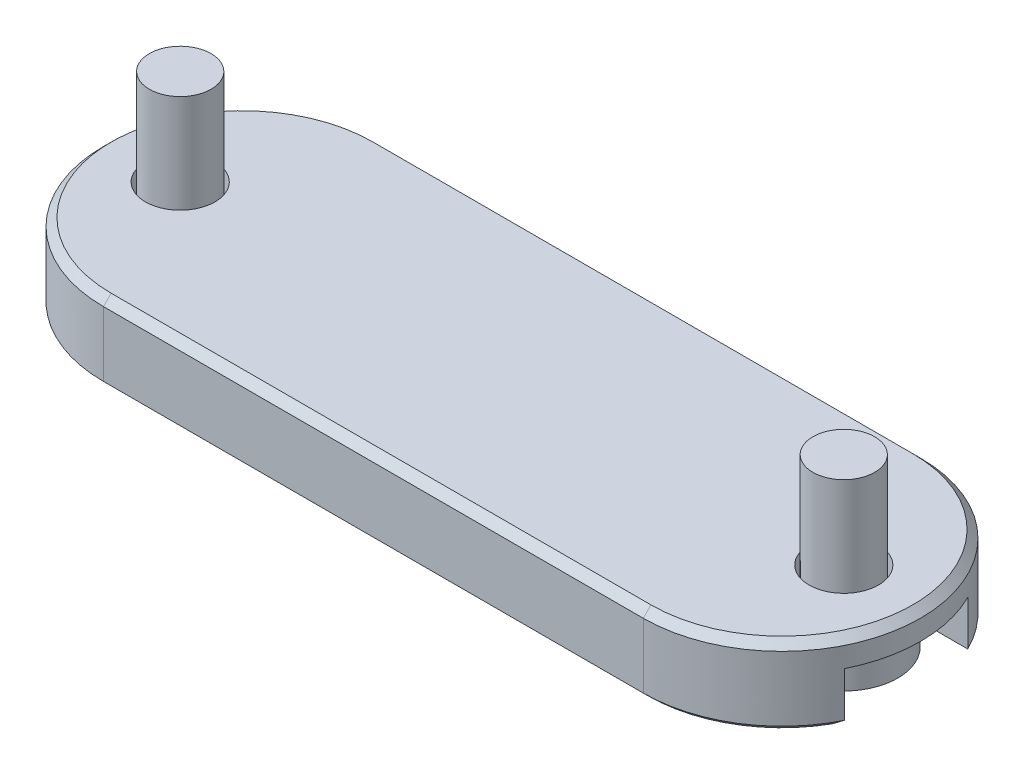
ISO-10303-21;
HEADER;
FILE_DESCRIPTION(('STEP AP214'),'2;1');
FILE_NAME('part.step','',(''),(''),'','','');
FILE_SCHEMA(('AUTOMOTIVE_DESIGN { 1 0 10303 214 1 1 1 1 }'));
ENDSEC;
DATA;
#1=APPLICATION_CONTEXT('core data for automotive mechanical design processes');
#2=APPLICATION_PROTOCOL_DEFINITION('international standard','automotive_design',2000,#1);
#3=PRODUCT_CONTEXT('',#1,'mechanical');
#4=PRODUCT('Part','Part','',(#3));
#5=PRODUCT_RELATED_PRODUCT_CATEGORY('part','',(#4));
#6=PRODUCT_DEFINITION_FORMATION('','',#4);
#7=PRODUCT_DEFINITION_CONTEXT('part definition',#1,'design');
#8=PRODUCT_DEFINITION('design','',#6,#7);
#9=PRODUCT_DEFINITION_SHAPE('','',#8);
#10=(LENGTH_UNIT() NAMED_UNIT(*) SI_UNIT(.MILLI.,.METRE.));
#11=(NAMED_UNIT(*) PLANE_ANGLE_UNIT() SI_UNIT($,.RADIAN.));
#12=(NAMED_UNIT(*) SI_UNIT($,.STERADIAN.) SOLID_ANGLE_UNIT());
#13=UNCERTAINTY_MEASURE_WITH_UNIT(LENGTH_MEASURE(1.E-05),#10,'distance_accuracy_value','');
#14=(GEOMETRIC_REPRESENTATION_CONTEXT(3) GLOBAL_UNCERTAINTY_ASSIGNED_CONTEXT((#13)) GLOBAL_UNIT_ASSIGNED_CONTEXT((#10,
#11,#12)) REPRESENTATION_CONTEXT('',''));
#15=CARTESIAN_POINT('',(0.,0.,0.));
#16=DIRECTION('',(0.,0.,1.));
#17=DIRECTION('',(1.,0.,0.));
#18=AXIS2_PLACEMENT_3D('',#15,#16,#17);
#19=CARTESIAN_POINT('',(21.5,11.2,0.));
#20=DIRECTION('',(0.,1.,0.));
#21=DIRECTION('',(-1.,0.,0.));
#22=AXIS2_PLACEMENT_3D('',#19,#20,#21);
#23=PLANE('',#22);
#24=CARTESIAN_POINT('',(21.5,11.2,0.));
#25=DIRECTION('',(0.,-1.,0.));
#26=DIRECTION('',(-1.,0.,0.));
#27=AXIS2_PLACEMENT_3D('',#24,#25,#26);
#28=CIRCLE('',#27,2.);
#29=CARTESIAN_POINT('',(19.5,11.2,0.));
#30=VERTEX_POINT('',#29);
#31=EDGE_CURVE('E12',#30,#30,#28,.T.);
#32=ORIENTED_EDGE('',*,*,#31,.F.);
#33=EDGE_LOOP('',(#32));
#34=FACE_BOUND('',#33,.T.);
#35=ADVANCED_FACE('F55',(#34),#23,.T.);
#36=CARTESIAN_POINT('',(21.5,11.2,0.));
#37=DIRECTION('',(0.,1.,0.));
#38=DIRECTION('',(-1.,0.,0.));
#39=AXIS2_PLACEMENT_3D('',#36,#37,#38);
#40=CYLINDRICAL_SURFACE('',#39,2.);
#41=CARTESIAN_POINT('',(21.5,3.2,0.));
#42=DIRECTION('',(0.,-1.,0.));
#43=DIRECTION('',(-1.,0.,0.));
#44=AXIS2_PLACEMENT_3D('',#41,#42,#43);
#45=CIRCLE('',#44,2.);
#46=CARTESIAN_POINT('',(19.5,3.2,0.));
#47=VERTEX_POINT('',#46);
#48=EDGE_CURVE('E62',#47,#47,#45,.T.);
#49=ORIENTED_EDGE('',*,*,#48,.F.);
#50=EDGE_LOOP('',(#49));
#51=FACE_BOUND('',#50,.T.);
#52=ORIENTED_EDGE('',*,*,#31,.T.);
#53=EDGE_LOOP('',(#52));
#54=FACE_BOUND('',#53,.T.);
#55=ADVANCED_FACE('F154',(#51,#54),#40,.T.);
#56=CARTESIAN_POINT('',(21.5,3.2,2.));
#57=DIRECTION('',(0.,1.,0.));
#58=DIRECTION('',(-1.,0.,0.));
#59=AXIS2_PLACEMENT_3D('',#56,#57,#58);
#60=PLANE('',#59);
#61=CARTESIAN_POINT('',(21.5,3.2,0.));
#62=DIRECTION('',(0.,-1.,0.));
#63=DIRECTION('',(-1.,0.,0.));
#64=AXIS2_PLACEMENT_3D('',#61,#62,#63);
#65=CIRCLE('',#64,3.5);
#66=CARTESIAN_POINT('',(18.,3.2,0.));
#67=VERTEX_POINT('',#66);
#68=EDGE_CURVE('E147',#67,#67,#65,.T.);
#69=ORIENTED_EDGE('',*,*,#68,.F.);
#70=EDGE_LOOP('',(#69));
#71=FACE_BOUND('',#70,.T.);
#72=ORIENTED_EDGE('',*,*,#48,.T.);
#73=EDGE_LOOP('',(#72));
#74=FACE_BOUND('',#73,.T.);
#75=ADVANCED_FACE('F152',(#71,#74),#60,.T.);
#76=CARTESIAN_POINT('',(21.5,11.2,0.));
#77=DIRECTION('',(0.,1.,0.));
#78=DIRECTION('',(-1.,0.,0.));
#79=AXIS2_PLACEMENT_3D('',#76,#77,#78);
#80=CYLINDRICAL_SURFACE('',#79,3.5);
#81=CARTESIAN_POINT('',(21.5,0.399999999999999,0.));
#82=DIRECTION('',(0.,-1.,0.));
#83=DIRECTION('',(-1.,0.,0.));
#84=AXIS2_PLACEMENT_3D('',#81,#82,#83);
#85=CIRCLE('',#84,3.5);
#86=CARTESIAN_POINT('',(18.,0.399999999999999,0.));
#87=VERTEX_POINT('',#86);
#88=EDGE_CURVE('E144',#87,#87,#85,.T.);
#89=ORIENTED_EDGE('',*,*,#88,.F.);
#90=EDGE_LOOP('',(#89));
#91=FACE_BOUND('',#90,.T.);
#92=ORIENTED_EDGE('',*,*,#68,.T.);
#93=EDGE_LOOP('',(#92));
#94=FACE_BOUND('',#93,.T.);
#95=ADVANCED_FACE('F172',(#91,#94),#80,.T.);
#96=CARTESIAN_POINT('',(21.5,0.399999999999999,3.5));
#97=DIRECTION('',(0.,-1.,0.));
#98=DIRECTION('',(1.,0.,0.));
#99=AXIS2_PLACEMENT_3D('',#96,#97,#98);
#100=PLANE('',#99);
#101=DIRECTION('',(-0.866025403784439,0.,0.5));
#102=VECTOR('',#101,1.);
#103=CARTESIAN_POINT('',(21.5,0.399999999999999,-1.44337567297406));
#104=LINE('',#103,#102);
#105=CARTESIAN_POINT('',(21.5,0.399999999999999,-1.44337567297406));
#106=VERTEX_POINT('',#105);
#107=CARTESIAN_POINT('',(20.25,0.399999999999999,-0.721687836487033));
#108=VERTEX_POINT('',#107);
#109=EDGE_CURVE('E318',#106,#108,#104,.T.);
#110=ORIENTED_EDGE('',*,*,#109,.T.);
#111=DIRECTION('',(0.,0.,1.));
#112=VECTOR('',#111,1.);
#113=CARTESIAN_POINT('',(20.25,0.399999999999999,-0.721687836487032));
#114=LINE('',#113,#112);
#115=CARTESIAN_POINT('',(20.25,0.399999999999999,0.721687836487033));
#116=VERTEX_POINT('',#115);
#117=EDGE_CURVE('E312',#108,#116,#114,.T.);
#118=ORIENTED_EDGE('',*,*,#117,.T.);
#119=DIRECTION('',(0.866025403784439,0.,0.5));
#120=VECTOR('',#119,1.);
#121=CARTESIAN_POINT('',(20.25,0.399999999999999,0.721687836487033));
#122=LINE('',#121,#120);
#123=CARTESIAN_POINT('',(21.5,0.399999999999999,1.44337567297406));
#124=VERTEX_POINT('',#123);
#125=EDGE_CURVE('E317',#116,#124,#122,.T.);
#126=ORIENTED_EDGE('',*,*,#125,.T.);
#127=DIRECTION('',(0.866025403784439,0.,-0.5));
#128=VECTOR('',#127,1.);
#129=CARTESIAN_POINT('',(21.5,0.399999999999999,1.44337567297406));
#130=LINE('',#129,#128);
#131=CARTESIAN_POINT('',(22.75,0.399999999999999,0.721687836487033));
#132=VERTEX_POINT('',#131);
#133=EDGE_CURVE('E326',#124,#132,#130,.T.);
#134=ORIENTED_EDGE('',*,*,#133,.T.);
#135=DIRECTION('',(0.,0.,-1.));
#136=VECTOR('',#135,1.);
#137=CARTESIAN_POINT('',(22.75,0.399999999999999,0.721687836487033));
#138=LINE('',#137,#136);
#139=CARTESIAN_POINT('',(22.75,0.399999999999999,-0.721687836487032));
#140=VERTEX_POINT('',#139);
#141=EDGE_CURVE('E133',#132,#140,#138,.T.);
#142=ORIENTED_EDGE('',*,*,#141,.T.);
#143=DIRECTION('',(-0.866025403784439,0.,-0.5));
#144=VECTOR('',#143,1.);
#145=CARTESIAN_POINT('',(22.75,0.399999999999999,-0.721687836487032));
#146=LINE('',#145,#144);
#147=EDGE_CURVE('E321',#140,#106,#146,.T.);
#148=ORIENTED_EDGE('',*,*,#147,.T.);
#149=EDGE_LOOP('',(#110,#118,#126,#134,#142,#148));
#150=FACE_BOUND('',#149,.T.);
#151=ORIENTED_EDGE('',*,*,#88,.T.);
#152=EDGE_LOOP('',(#151));
#153=FACE_BOUND('',#152,.T.);
#154=ADVANCED_FACE('F180',(#150,#153),#100,.T.);
#155=CARTESIAN_POINT('',(21.5,2.4,-1.44337567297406));
#156=DIRECTION('',(-0.5,0.,-0.866025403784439));
#157=DIRECTION('',(0.866025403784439,0.,-0.5));
#158=AXIS2_PLACEMENT_3D('',#155,#156,#157);
#159=PLANE('',#158);
#160=ORIENTED_EDGE('',*,*,#109,.F.);
#161=DIRECTION('',(0.,-1.,0.));
#162=VECTOR('',#161,1.);
#163=CARTESIAN_POINT('',(21.5,2.4,-1.44337567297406));
#164=LINE('',#163,#162);
#165=CARTESIAN_POINT('',(21.5,2.4,-1.44337567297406));
#166=VERTEX_POINT('',#165);
#167=EDGE_CURVE('E100',#166,#106,#164,.T.);
#168=ORIENTED_EDGE('',*,*,#167,.F.);
#169=DIRECTION('',(-0.866025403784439,0.,0.5));
#170=VECTOR('',#169,1.);
#171=CARTESIAN_POINT('',(21.5,2.4,-1.44337567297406));
#172=LINE('',#171,#170);
#173=CARTESIAN_POINT('',(20.25,2.4,-0.721687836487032));
#174=VERTEX_POINT('',#173);
#175=EDGE_CURVE('E329',#166,#174,#172,.T.);
#176=ORIENTED_EDGE('',*,*,#175,.T.);
#177=DIRECTION('',(0.,-1.,0.));
#178=VECTOR('',#177,1.);
#179=CARTESIAN_POINT('',(20.25,2.4,-0.721687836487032));
#180=LINE('',#179,#178);
#181=EDGE_CURVE('E69',#174,#108,#180,.T.);
#182=ORIENTED_EDGE('',*,*,#181,.T.);
#183=EDGE_LOOP('',(#160,#168,#176,#182));
#184=FACE_BOUND('',#183,.T.);
#185=ADVANCED_FACE('F188',(#184),#159,.F.);
#186=CARTESIAN_POINT('',(22.75,2.4,-0.721687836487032));
#187=DIRECTION('',(0.5,0.,-0.866025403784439));
#188=DIRECTION('',(0.866025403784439,0.,0.5));
#189=AXIS2_PLACEMENT_3D('',#186,#187,#188);
#190=PLANE('',#189);
#191=ORIENTED_EDGE('',*,*,#147,.F.);
#192=DIRECTION('',(0.,-1.,0.));
#193=VECTOR('',#192,1.);
#194=CARTESIAN_POINT('',(22.75,2.4,-0.721687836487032));
#195=LINE('',#194,#193);
#196=CARTESIAN_POINT('',(22.75,2.4,-0.721687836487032));
#197=VERTEX_POINT('',#196);
#198=EDGE_CURVE('E135',#197,#140,#195,.T.);
#199=ORIENTED_EDGE('',*,*,#198,.F.);
#200=DIRECTION('',(-0.866025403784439,0.,-0.5));
#201=VECTOR('',#200,1.);
#202=CARTESIAN_POINT('',(22.75,2.4,-0.721687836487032));
#203=LINE('',#202,#201);
#204=EDGE_CURVE('E78',#197,#166,#203,.T.);
#205=ORIENTED_EDGE('',*,*,#204,.T.);
#206=ORIENTED_EDGE('',*,*,#167,.T.);
#207=EDGE_LOOP('',(#191,#199,#205,#206));
#208=FACE_BOUND('',#207,.T.);
#209=ADVANCED_FACE('F196',(#208),#190,.F.);
#210=CARTESIAN_POINT('',(22.75,2.4,0.721687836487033));
#211=DIRECTION('',(1.,0.,0.));
#212=DIRECTION('',(0.,1.,0.));
#213=AXIS2_PLACEMENT_3D('',#210,#211,#212);
#214=PLANE('',#213);
#215=ORIENTED_EDGE('',*,*,#141,.F.);
#216=DIRECTION('',(0.,-1.,0.));
#217=VECTOR('',#216,1.);
#218=CARTESIAN_POINT('',(22.75,2.4,0.721687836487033));
#219=LINE('',#218,#217);
#220=CARTESIAN_POINT('',(22.75,2.4,0.721687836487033));
#221=VERTEX_POINT('',#220);
#222=EDGE_CURVE('E122',#221,#132,#219,.T.);
#223=ORIENTED_EDGE('',*,*,#222,.F.);
#224=DIRECTION('',(0.,0.,-1.));
#225=VECTOR('',#224,1.);
#226=CARTESIAN_POINT('',(22.75,2.4,0.721687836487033));
#227=LINE('',#226,#225);
#228=EDGE_CURVE('E125',#221,#197,#227,.T.);
#229=ORIENTED_EDGE('',*,*,#228,.T.);
#230=ORIENTED_EDGE('',*,*,#198,.T.);
#231=EDGE_LOOP('',(#215,#223,#229,#230));
#232=FACE_BOUND('',#231,.T.);
#233=ADVANCED_FACE('F131',(#232),#214,.F.);
#234=CARTESIAN_POINT('',(21.5,2.4,1.44337567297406));
#235=DIRECTION('',(0.5,0.,0.866025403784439));
#236=DIRECTION('',(-0.866025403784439,0.,0.5));
#237=AXIS2_PLACEMENT_3D('',#234,#235,#236);
#238=PLANE('',#237);
#239=ORIENTED_EDGE('',*,*,#133,.F.);
#240=DIRECTION('',(0.,-1.,0.));
#241=VECTOR('',#240,1.);
#242=CARTESIAN_POINT('',(21.5,2.4,1.44337567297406));
#243=LINE('',#242,#241);
#244=CARTESIAN_POINT('',(21.5,2.4,1.44337567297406));
#245=VERTEX_POINT('',#244);
#246=EDGE_CURVE('E124',#245,#124,#243,.T.);
#247=ORIENTED_EDGE('',*,*,#246,.F.);
#248=DIRECTION('',(0.866025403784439,0.,-0.5));
#249=VECTOR('',#248,1.);
#250=CARTESIAN_POINT('',(21.5,2.4,1.44337567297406));
#251=LINE('',#250,#249);
#252=EDGE_CURVE('E117',#245,#221,#251,.T.);
#253=ORIENTED_EDGE('',*,*,#252,.T.);
#254=ORIENTED_EDGE('',*,*,#222,.T.);
#255=EDGE_LOOP('',(#239,#247,#253,#254));
#256=FACE_BOUND('',#255,.T.);
#257=ADVANCED_FACE('F120',(#256),#238,.F.);
#258=CARTESIAN_POINT('',(20.25,2.4,0.721687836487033));
#259=DIRECTION('',(-0.5,0.,0.866025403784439));
#260=DIRECTION('',(-0.866025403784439,0.,-0.5));
#261=AXIS2_PLACEMENT_3D('',#258,#259,#260);
#262=PLANE('',#261);
#263=ORIENTED_EDGE('',*,*,#125,.F.);
#264=DIRECTION('',(0.,-1.,0.));
#265=VECTOR('',#264,1.);
#266=CARTESIAN_POINT('',(20.25,2.4,0.721687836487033));
#267=LINE('',#266,#265);
#268=CARTESIAN_POINT('',(20.25,2.4,0.721687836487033));
#269=VERTEX_POINT('',#268);
#270=EDGE_CURVE('E138',#269,#116,#267,.T.);
#271=ORIENTED_EDGE('',*,*,#270,.F.);
#272=DIRECTION('',(0.866025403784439,0.,0.5));
#273=VECTOR('',#272,1.);
#274=CARTESIAN_POINT('',(20.25,2.4,0.721687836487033));
#275=LINE('',#274,#273);
#276=EDGE_CURVE('E126',#269,#245,#275,.T.);
#277=ORIENTED_EDGE('',*,*,#276,.T.);
#278=ORIENTED_EDGE('',*,*,#246,.T.);
#279=EDGE_LOOP('',(#263,#271,#277,#278));
#280=FACE_BOUND('',#279,.T.);
#281=ADVANCED_FACE('F215',(#280),#262,.F.);
#282=CARTESIAN_POINT('',(20.25,2.4,-0.721687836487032));
#283=DIRECTION('',(-1.,0.,0.));
#284=DIRECTION('',(0.,-1.,0.));
#285=AXIS2_PLACEMENT_3D('',#282,#283,#284);
#286=PLANE('',#285);
#287=ORIENTED_EDGE('',*,*,#117,.F.);
#288=ORIENTED_EDGE('',*,*,#181,.F.);
#289=DIRECTION('',(0.,0.,1.));
#290=VECTOR('',#289,1.);
#291=CARTESIAN_POINT('',(20.25,2.4,-0.721687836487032));
#292=LINE('',#291,#290);
#293=EDGE_CURVE('E108',#174,#269,#292,.T.);
#294=ORIENTED_EDGE('',*,*,#293,.T.);
#295=ORIENTED_EDGE('',*,*,#270,.T.);
#296=EDGE_LOOP('',(#287,#288,#294,#295));
#297=FACE_BOUND('',#296,.T.);
#298=ADVANCED_FACE('F222',(#297),#286,.F.);
#299=CARTESIAN_POINT('',(21.5,2.4,-1.44337567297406));
#300=DIRECTION('',(0.,1.,0.));
#301=DIRECTION('',(-1.,0.,0.));
#302=AXIS2_PLACEMENT_3D('',#299,#300,#301);
#303=PLANE('',#302);
#304=ORIENTED_EDGE('',*,*,#175,.F.);
#305=ORIENTED_EDGE('',*,*,#204,.F.);
#306=ORIENTED_EDGE('',*,*,#228,.F.);
#307=ORIENTED_EDGE('',*,*,#252,.F.);
#308=ORIENTED_EDGE('',*,*,#276,.F.);
#309=ORIENTED_EDGE('',*,*,#293,.F.);
#310=EDGE_LOOP('',(#304,#305,#306,#307,#308,#309));
#311=FACE_BOUND('',#310,.T.);
#312=ADVANCED_FACE('F128',(#311),#303,.F.);
#313=CLOSED_SHELL('',(#35,#55,#75,#95,#154,#185,#209,#233,#257,#281,#298,#312));
#314=MANIFOLD_SOLID_BREP('B2',#313);
#315=CARTESIAN_POINT('',(-21.5,11.2,0.));
#316=DIRECTION('',(0.,1.,0.));
#317=DIRECTION('',(1.,0.,0.));
#318=AXIS2_PLACEMENT_3D('',#315,#316,#317);
#319=PLANE('',#318);
#320=CARTESIAN_POINT('',(-21.5,11.2,0.));
#321=DIRECTION('',(0.,1.,0.));
#322=DIRECTION('',(1.,0.,0.));
#323=AXIS2_PLACEMENT_3D('',#320,#321,#322);
#324=CIRCLE('',#323,2.);
#325=CARTESIAN_POINT('',(-19.5,11.2,0.));
#326=VERTEX_POINT('',#325);
#327=EDGE_CURVE('E53',#326,#326,#324,.T.);
#328=ORIENTED_EDGE('',*,*,#327,.T.);
#329=EDGE_LOOP('',(#328));
#330=FACE_BOUND('',#329,.T.);
#331=ADVANCED_FACE('F347',(#330),#319,.T.);
#332=CARTESIAN_POINT('',(-21.5,11.2,0.));
#333=DIRECTION('',(0.,1.,0.));
#334=DIRECTION('',(1.,0.,0.));
#335=AXIS2_PLACEMENT_3D('',#332,#333,#334);
#336=CYLINDRICAL_SURFACE('',#335,2.);
#337=CARTESIAN_POINT('',(-21.5,3.2,0.));
#338=DIRECTION('',(0.,1.,0.));
#339=DIRECTION('',(1.,0.,0.));
#340=AXIS2_PLACEMENT_3D('',#337,#338,#339);
#341=CIRCLE('',#340,2.);
#342=CARTESIAN_POINT('',(-19.5,3.2,0.));
#343=VERTEX_POINT('',#342);
#344=EDGE_CURVE('E354',#343,#343,#341,.T.);
#345=ORIENTED_EDGE('',*,*,#344,.T.);
#346=EDGE_LOOP('',(#345));
#347=FACE_BOUND('',#346,.T.);
#348=ORIENTED_EDGE('',*,*,#327,.F.);
#349=EDGE_LOOP('',(#348));
#350=FACE_BOUND('',#349,.T.);
#351=ADVANCED_FACE('F461',(#347,#350),#336,.T.);
#352=CARTESIAN_POINT('',(-21.5,3.2,2.));
#353=DIRECTION('',(0.,1.,0.));
#354=DIRECTION('',(1.,0.,0.));
#355=AXIS2_PLACEMENT_3D('',#352,#353,#354);
#356=PLANE('',#355);
#357=CARTESIAN_POINT('',(-21.5,3.2,0.));
#358=DIRECTION('',(0.,1.,0.));
#359=DIRECTION('',(1.,0.,0.));
#360=AXIS2_PLACEMENT_3D('',#357,#358,#359);
#361=CIRCLE('',#360,3.5);
#362=CARTESIAN_POINT('',(-18.,3.2,0.));
#363=VERTEX_POINT('',#362);
#364=EDGE_CURVE('E456',#363,#363,#361,.T.);
#365=ORIENTED_EDGE('',*,*,#364,.T.);
#366=EDGE_LOOP('',(#365));
#367=FACE_BOUND('',#366,.T.);
#368=ORIENTED_EDGE('',*,*,#344,.F.);
#369=EDGE_LOOP('',(#368));
#370=FACE_BOUND('',#369,.T.);
#371=ADVANCED_FACE('F464',(#367,#370),#356,.T.);
#372=CARTESIAN_POINT('',(-21.5,11.2,0.));
#373=DIRECTION('',(0.,1.,0.));
#374=DIRECTION('',(1.,0.,0.));
#375=AXIS2_PLACEMENT_3D('',#372,#373,#374);
#376=CYLINDRICAL_SURFACE('',#375,3.5);
#377=CARTESIAN_POINT('',(-21.5,0.399999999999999,0.));
#378=DIRECTION('',(0.,1.,0.));
#379=DIRECTION('',(1.,0.,0.));
#380=AXIS2_PLACEMENT_3D('',#377,#378,#379);
#381=CIRCLE('',#380,3.5);
#382=CARTESIAN_POINT('',(-18.,0.399999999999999,0.));
#383=VERTEX_POINT('',#382);
#384=EDGE_CURVE('E448',#383,#383,#381,.T.);
#385=ORIENTED_EDGE('',*,*,#384,.T.);
#386=EDGE_LOOP('',(#385));
#387=FACE_BOUND('',#386,.T.);
#388=ORIENTED_EDGE('',*,*,#364,.F.);
#389=EDGE_LOOP('',(#388));
#390=FACE_BOUND('',#389,.T.);
#391=ADVANCED_FACE('F466',(#387,#390),#376,.T.);
#392=CARTESIAN_POINT('',(-21.5,0.399999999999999,3.5));
#393=DIRECTION('',(0.,-1.,0.));
#394=DIRECTION('',(-1.,0.,0.));
#395=AXIS2_PLACEMENT_3D('',#392,#393,#394);
#396=PLANE('',#395);
#397=DIRECTION('',(0.866025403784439,0.,0.5));
#398=VECTOR('',#397,1.);
#399=CARTESIAN_POINT('',(-21.5,0.399999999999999,-1.44337567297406));
#400=LINE('',#399,#398);
#401=CARTESIAN_POINT('',(-21.5,0.399999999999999,-1.44337567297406));
#402=VERTEX_POINT('',#401);
#403=CARTESIAN_POINT('',(-20.25,0.399999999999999,-0.721687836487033));
#404=VERTEX_POINT('',#403);
#405=EDGE_CURVE('E361',#402,#404,#400,.T.);
#406=ORIENTED_EDGE('',*,*,#405,.F.);
#407=DIRECTION('',(0.866025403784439,0.,-0.5));
#408=VECTOR('',#407,1.);
#409=CARTESIAN_POINT('',(-22.75,0.399999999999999,-0.721687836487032));
#410=LINE('',#409,#408);
#411=CARTESIAN_POINT('',(-22.75,0.399999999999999,-0.721687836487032));
#412=VERTEX_POINT('',#411);
#413=EDGE_CURVE('E444',#412,#402,#410,.T.);
#414=ORIENTED_EDGE('',*,*,#413,.F.);
#415=DIRECTION('',(0.,0.,-1.));
#416=VECTOR('',#415,1.);
#417=CARTESIAN_POINT('',(-22.75,0.399999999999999,0.721687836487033));
#418=LINE('',#417,#416);
#419=CARTESIAN_POINT('',(-22.75,0.399999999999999,0.721687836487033));
#420=VERTEX_POINT('',#419);
#421=EDGE_CURVE('E442',#420,#412,#418,.T.);
#422=ORIENTED_EDGE('',*,*,#421,.F.);
#423=DIRECTION('',(-0.866025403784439,0.,-0.5));
#424=VECTOR('',#423,1.);
#425=CARTESIAN_POINT('',(-21.5,0.399999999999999,1.44337567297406));
#426=LINE('',#425,#424);
#427=CARTESIAN_POINT('',(-21.5,0.399999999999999,1.44337567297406));
#428=VERTEX_POINT('',#427);
#429=EDGE_CURVE('E409',#428,#420,#426,.T.);
#430=ORIENTED_EDGE('',*,*,#429,.F.);
#431=DIRECTION('',(-0.866025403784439,0.,0.5));
#432=VECTOR('',#431,1.);
#433=CARTESIAN_POINT('',(-20.25,0.399999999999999,0.721687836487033));
#434=LINE('',#433,#432);
#435=CARTESIAN_POINT('',(-20.25,0.399999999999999,0.721687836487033));
#436=VERTEX_POINT('',#435);
#437=EDGE_CURVE('E438',#436,#428,#434,.T.);
#438=ORIENTED_EDGE('',*,*,#437,.F.);
#439=DIRECTION('',(0.,0.,1.));
#440=VECTOR('',#439,1.);
#441=CARTESIAN_POINT('',(-20.25,0.399999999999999,-0.721687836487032));
#442=LINE('',#441,#440);
#443=EDGE_CURVE('E435',#404,#436,#442,.T.);
#444=ORIENTED_EDGE('',*,*,#443,.F.);
#445=EDGE_LOOP('',(#406,#414,#422,#430,#438,#444));
#446=FACE_BOUND('',#445,.T.);
#447=ORIENTED_EDGE('',*,*,#384,.F.);
#448=EDGE_LOOP('',(#447));
#449=FACE_BOUND('',#448,.T.);
#450=ADVANCED_FACE('F473',(#446,#449),#396,.T.);
#451=CARTESIAN_POINT('',(-21.5,2.4,-1.44337567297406));
#452=DIRECTION('',(0.5,0.,-0.866025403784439));
#453=DIRECTION('',(-0.866025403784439,0.,-0.5));
#454=AXIS2_PLACEMENT_3D('',#451,#452,#453);
#455=PLANE('',#454);
#456=ORIENTED_EDGE('',*,*,#405,.T.);
#457=DIRECTION('',(0.,-1.,0.));
#458=VECTOR('',#457,1.);
#459=CARTESIAN_POINT('',(-20.25,2.4,-0.721687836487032));
#460=LINE('',#459,#458);
#461=CARTESIAN_POINT('',(-20.25,2.4,-0.721687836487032));
#462=VERTEX_POINT('',#461);
#463=EDGE_CURVE('E391',#462,#404,#460,.T.);
#464=ORIENTED_EDGE('',*,*,#463,.F.);
#465=DIRECTION('',(0.866025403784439,0.,0.5));
#466=VECTOR('',#465,1.);
#467=CARTESIAN_POINT('',(-21.5,2.4,-1.44337567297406));
#468=LINE('',#467,#466);
#469=CARTESIAN_POINT('',(-21.5,2.4,-1.44337567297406));
#470=VERTEX_POINT('',#469);
#471=EDGE_CURVE('E446',#470,#462,#468,.T.);
#472=ORIENTED_EDGE('',*,*,#471,.F.);
#473=DIRECTION('',(0.,-1.,0.));
#474=VECTOR('',#473,1.);
#475=CARTESIAN_POINT('',(-21.5,2.4,-1.44337567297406));
#476=LINE('',#475,#474);
#477=EDGE_CURVE('E369',#470,#402,#476,.T.);
#478=ORIENTED_EDGE('',*,*,#477,.T.);
#479=EDGE_LOOP('',(#456,#464,#472,#478));
#480=FACE_BOUND('',#479,.T.);
#481=ADVANCED_FACE('F507',(#480),#455,.F.);
#482=CARTESIAN_POINT('',(-22.75,2.4,-0.721687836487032));
#483=DIRECTION('',(-0.5,0.,-0.866025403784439));
#484=DIRECTION('',(-0.866025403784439,0.,0.5));
#485=AXIS2_PLACEMENT_3D('',#482,#483,#484);
#486=PLANE('',#485);
#487=ORIENTED_EDGE('',*,*,#413,.T.);
#488=ORIENTED_EDGE('',*,*,#477,.F.);
#489=DIRECTION('',(0.866025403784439,0.,-0.5));
#490=VECTOR('',#489,1.);
#491=CARTESIAN_POINT('',(-22.75,2.4,-0.721687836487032));
#492=LINE('',#491,#490);
#493=CARTESIAN_POINT('',(-22.75,2.4,-0.721687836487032));
#494=VERTEX_POINT('',#493);
#495=EDGE_CURVE('E421',#494,#470,#492,.T.);
#496=ORIENTED_EDGE('',*,*,#495,.F.);
#497=DIRECTION('',(0.,-1.,0.));
#498=VECTOR('',#497,1.);
#499=CARTESIAN_POINT('',(-22.75,2.4,-0.721687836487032));
#500=LINE('',#499,#498);
#501=EDGE_CURVE('E413',#494,#412,#500,.T.);
#502=ORIENTED_EDGE('',*,*,#501,.T.);
#503=EDGE_LOOP('',(#487,#488,#496,#502));
#504=FACE_BOUND('',#503,.T.);
#505=ADVANCED_FACE('F518',(#504),#486,.F.);
#506=CARTESIAN_POINT('',(-22.75,2.4,0.721687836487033));
#507=DIRECTION('',(-1.,0.,0.));
#508=DIRECTION('',(0.,1.,0.));
#509=AXIS2_PLACEMENT_3D('',#506,#507,#508);
#510=PLANE('',#509);
#511=ORIENTED_EDGE('',*,*,#421,.T.);
#512=ORIENTED_EDGE('',*,*,#501,.F.);
#513=DIRECTION('',(0.,0.,-1.));
#514=VECTOR('',#513,1.);
#515=CARTESIAN_POINT('',(-22.75,2.4,0.721687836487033));
#516=LINE('',#515,#514);
#517=CARTESIAN_POINT('',(-22.75,2.4,0.721687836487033));
#518=VERTEX_POINT('',#517);
#519=EDGE_CURVE('E417',#518,#494,#516,.T.);
#520=ORIENTED_EDGE('',*,*,#519,.F.);
#521=DIRECTION('',(0.,-1.,0.));
#522=VECTOR('',#521,1.);
#523=CARTESIAN_POINT('',(-22.75,2.4,0.721687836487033));
#524=LINE('',#523,#522);
#525=EDGE_CURVE('E402',#518,#420,#524,.T.);
#526=ORIENTED_EDGE('',*,*,#525,.T.);
#527=EDGE_LOOP('',(#511,#512,#520,#526));
#528=FACE_BOUND('',#527,.T.);
#529=ADVANCED_FACE('F418',(#528),#510,.F.);
#530=CARTESIAN_POINT('',(-21.5,2.4,1.44337567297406));
#531=DIRECTION('',(-0.5,0.,0.866025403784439));
#532=DIRECTION('',(0.866025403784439,0.,0.5));
#533=AXIS2_PLACEMENT_3D('',#530,#531,#532);
#534=PLANE('',#533);
#535=ORIENTED_EDGE('',*,*,#429,.T.);
#536=ORIENTED_EDGE('',*,*,#525,.F.);
#537=DIRECTION('',(-0.866025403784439,0.,-0.5));
#538=VECTOR('',#537,1.);
#539=CARTESIAN_POINT('',(-21.5,2.4,1.44337567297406));
#540=LINE('',#539,#538);
#541=CARTESIAN_POINT('',(-21.5,2.4,1.44337567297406));
#542=VERTEX_POINT('',#541);
#543=EDGE_CURVE('E406',#542,#518,#540,.T.);
#544=ORIENTED_EDGE('',*,*,#543,.F.);
#545=DIRECTION('',(0.,-1.,0.));
#546=VECTOR('',#545,1.);
#547=CARTESIAN_POINT('',(-21.5,2.4,1.44337567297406));
#548=LINE('',#547,#546);
#549=EDGE_CURVE('E414',#542,#428,#548,.T.);
#550=ORIENTED_EDGE('',*,*,#549,.T.);
#551=EDGE_LOOP('',(#535,#536,#544,#550));
#552=FACE_BOUND('',#551,.T.);
#553=ADVANCED_FACE('F404',(#552),#534,.F.);
#554=CARTESIAN_POINT('',(-20.25,2.4,0.721687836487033));
#555=DIRECTION('',(0.5,0.,0.866025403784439));
#556=DIRECTION('',(0.866025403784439,0.,-0.5));
#557=AXIS2_PLACEMENT_3D('',#554,#555,#556);
#558=PLANE('',#557);
#559=ORIENTED_EDGE('',*,*,#437,.T.);
#560=ORIENTED_EDGE('',*,*,#549,.F.);
#561=DIRECTION('',(-0.866025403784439,0.,0.5));
#562=VECTOR('',#561,1.);
#563=CARTESIAN_POINT('',(-20.25,2.4,0.721687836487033));
#564=LINE('',#563,#562);
#565=CARTESIAN_POINT('',(-20.25,2.4,0.721687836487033));
#566=VERTEX_POINT('',#565);
#567=EDGE_CURVE('E427',#566,#542,#564,.T.);
#568=ORIENTED_EDGE('',*,*,#567,.F.);
#569=DIRECTION('',(0.,-1.,0.));
#570=VECTOR('',#569,1.);
#571=CARTESIAN_POINT('',(-20.25,2.4,0.721687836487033));
#572=LINE('',#571,#570);
#573=EDGE_CURVE('E451',#566,#436,#572,.T.);
#574=ORIENTED_EDGE('',*,*,#573,.T.);
#575=EDGE_LOOP('',(#559,#560,#568,#574));
#576=FACE_BOUND('',#575,.T.);
#577=ADVANCED_FACE('F546',(#576),#558,.F.);
#578=CARTESIAN_POINT('',(-20.25,2.4,-0.721687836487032));
#579=DIRECTION('',(1.,0.,0.));
#580=DIRECTION('',(0.,-1.,0.));
#581=AXIS2_PLACEMENT_3D('',#578,#579,#580);
#582=PLANE('',#581);
#583=ORIENTED_EDGE('',*,*,#443,.T.);
#584=ORIENTED_EDGE('',*,*,#573,.F.);
#585=DIRECTION('',(0.,0.,1.));
#586=VECTOR('',#585,1.);
#587=CARTESIAN_POINT('',(-20.25,2.4,-0.721687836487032));
#588=LINE('',#587,#586);
#589=EDGE_CURVE('E429',#462,#566,#588,.T.);
#590=ORIENTED_EDGE('',*,*,#589,.F.);
#591=ORIENTED_EDGE('',*,*,#463,.T.);
#592=EDGE_LOOP('',(#583,#584,#590,#591));
#593=FACE_BOUND('',#592,.T.);
#594=ADVANCED_FACE('F556',(#593),#582,.F.);
#595=CARTESIAN_POINT('',(-21.5,2.4,-1.44337567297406));
#596=DIRECTION('',(0.,1.,0.));
#597=DIRECTION('',(1.,0.,0.));
#598=AXIS2_PLACEMENT_3D('',#595,#596,#597);
#599=PLANE('',#598);
#600=ORIENTED_EDGE('',*,*,#471,.T.);
#601=ORIENTED_EDGE('',*,*,#589,.T.);
#602=ORIENTED_EDGE('',*,*,#567,.T.);
#603=ORIENTED_EDGE('',*,*,#543,.T.);
#604=ORIENTED_EDGE('',*,*,#519,.T.);
#605=ORIENTED_EDGE('',*,*,#495,.T.);
#606=EDGE_LOOP('',(#600,#601,#602,#603,#604,#605));
#607=FACE_BOUND('',#606,.T.);
#608=ADVANCED_FACE('F424',(#607),#599,.F.);
#609=CLOSED_SHELL('',(#331,#351,#371,#391,#450,#481,#505,#529,#553,#577,#594,#608));
#610=MANIFOLD_SOLID_BREP('B6',#609);
#611=CARTESIAN_POINT('',(-17.49,0.,0.));
#612=DIRECTION('',(0.,1.,0.));
#613=DIRECTION('',(0.,0.,1.));
#614=AXIS2_PLACEMENT_3D('',#611,#612,#613);
#615=PLANE('',#614);
#616=DIRECTION('',(1.,0.,0.));
#617=VECTOR('',#616,1.);
#618=CARTESIAN_POINT('',(-21.5,0.,4.29999999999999));
#619=LINE('',#618,#617);
#620=CARTESIAN_POINT('',(-25.035808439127,0.,4.29999999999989));
#621=VERTEX_POINT('',#620);
#622=CARTESIAN_POINT('',(-21.5,0.,4.29999999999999));
#623=VERTEX_POINT('',#622);
#624=EDGE_CURVE('E1572',#621,#623,#619,.T.);
#625=ORIENTED_EDGE('',*,*,#624,.T.);
#626=CARTESIAN_POINT('',(-21.5,0.,0.));
#627=DIRECTION('',(0.,1.,0.));
#628=DIRECTION('',(0.,0.,1.));
#629=AXIS2_PLACEMENT_3D('',#626,#627,#628);
#630=CIRCLE('',#629,4.29999999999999);
#631=CARTESIAN_POINT('',(-18.5214412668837,0.,3.10132034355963));
#632=VERTEX_POINT('',#631);
#633=EDGE_CURVE('E1581',#623,#632,#630,.T.);
#634=ORIENTED_EDGE('',*,*,#633,.T.);
#635=DIRECTION('',(1.,0.,0.));
#636=VECTOR('',#635,1.);
#637=CARTESIAN_POINT('',(-17.49,0.,3.10132034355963));
#638=LINE('',#637,#636);
#639=CARTESIAN_POINT('',(18.5214412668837,0.,3.10132034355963));
#640=VERTEX_POINT('',#639);
#641=EDGE_CURVE('E925',#632,#640,#638,.T.);
#642=ORIENTED_EDGE('',*,*,#641,.T.);
#643=CARTESIAN_POINT('',(21.5,0.,0.));
#644=DIRECTION('',(0.,1.,0.));
#645=DIRECTION('',(0.,0.,1.));
#646=AXIS2_PLACEMENT_3D('',#643,#644,#645);
#647=CIRCLE('',#646,4.29999999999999);
#648=CARTESIAN_POINT('',(21.5,0.,4.29999999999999));
#649=VERTEX_POINT('',#648);
#650=EDGE_CURVE('E1562',#640,#649,#647,.T.);
#651=ORIENTED_EDGE('',*,*,#650,.T.);
#652=DIRECTION('',(1.,0.,0.));
#653=VECTOR('',#652,1.);
#654=CARTESIAN_POINT('',(25.5355096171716,0.,4.29999999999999));
#655=LINE('',#654,#653);
#656=CARTESIAN_POINT('',(25.035808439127,0.,4.29999999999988));
#657=VERTEX_POINT('',#656);
#658=EDGE_CURVE('E1567',#649,#657,#655,.T.);
#659=ORIENTED_EDGE('',*,*,#658,.T.);
#660=CARTESIAN_POINT('',(17.49,0.,0.));
#661=DIRECTION('',(0.,1.,0.));
#662=DIRECTION('',(0.,0.,1.));
#663=AXIS2_PLACEMENT_3D('',#660,#661,#662);
#664=CIRCLE('',#663,8.68499999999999);
#665=CARTESIAN_POINT('',(17.49,0.,8.68499999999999));
#666=VERTEX_POINT('',#665);
#667=EDGE_CURVE('E1574',#657,#666,#664,.F.);
#668=ORIENTED_EDGE('',*,*,#667,.T.);
#669=DIRECTION('',(-1.,0.,0.));
#670=VECTOR('',#669,1.);
#671=CARTESIAN_POINT('',(-17.49,0.,8.685));
#672=LINE('',#671,#670);
#673=CARTESIAN_POINT('',(-17.49,0.,8.685));
#674=VERTEX_POINT('',#673);
#675=EDGE_CURVE('E1862',#666,#674,#672,.T.);
#676=ORIENTED_EDGE('',*,*,#675,.T.);
#677=CARTESIAN_POINT('',(-17.49,0.,0.));
#678=DIRECTION('',(0.,1.,0.));
#679=DIRECTION('',(0.,0.,1.));
#680=AXIS2_PLACEMENT_3D('',#677,#678,#679);
#681=CIRCLE('',#680,8.685);
#682=EDGE_CURVE('E1570',#674,#621,#681,.F.);
#683=ORIENTED_EDGE('',*,*,#682,.T.);
#684=EDGE_LOOP('',(#625,#634,#642,#651,#659,#668,#676,#683));
#685=FACE_BOUND('',#684,.T.);
#686=ADVANCED_FACE('F607',(#685),#615,.F.);
#687=DIRECTION('',(1.,0.,0.));
#688=VECTOR('',#687,1.);
#689=CARTESIAN_POINT('',(-17.49,0.,-3.10132034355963));
#690=LINE('',#689,#688);
#691=CARTESIAN_POINT('',(18.5214412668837,0.,-3.10132034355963));
#692=VERTEX_POINT('',#691);
#693=CARTESIAN_POINT('',(-18.5214412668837,0.,-3.10132034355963));
#694=VERTEX_POINT('',#693);
#695=EDGE_CURVE('E932',#692,#694,#690,.F.);
#696=ORIENTED_EDGE('',*,*,#695,.T.);
#697=CARTESIAN_POINT('',(-21.5,0.,0.));
#698=DIRECTION('',(0.,1.,0.));
#699=DIRECTION('',(0.,0.,1.));
#700=AXIS2_PLACEMENT_3D('',#697,#698,#699);
#701=CIRCLE('',#700,4.29999999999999);
#702=CARTESIAN_POINT('',(-21.5,0.,-4.29999999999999));
#703=VERTEX_POINT('',#702);
#704=EDGE_CURVE('E1772',#694,#703,#701,.T.);
#705=ORIENTED_EDGE('',*,*,#704,.T.);
#706=DIRECTION('',(-1.,0.,0.));
#707=VECTOR('',#706,1.);
#708=CARTESIAN_POINT('',(-25.5355096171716,0.,-4.29999999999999));
#709=LINE('',#708,#707);
#710=CARTESIAN_POINT('',(-25.035808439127,0.,-4.29999999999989));
#711=VERTEX_POINT('',#710);
#712=EDGE_CURVE('E1783',#703,#711,#709,.T.);
#713=ORIENTED_EDGE('',*,*,#712,.T.);
#714=CARTESIAN_POINT('',(-17.49,0.,0.));
#715=DIRECTION('',(0.,1.,0.));
#716=DIRECTION('',(0.,0.,1.));
#717=AXIS2_PLACEMENT_3D('',#714,#715,#716);
#718=CIRCLE('',#717,8.685);
#719=CARTESIAN_POINT('',(-17.49,0.,-8.685));
#720=VERTEX_POINT('',#719);
#721=EDGE_CURVE('E1776',#711,#720,#718,.F.);
#722=ORIENTED_EDGE('',*,*,#721,.T.);
#723=DIRECTION('',(1.,0.,0.));
#724=VECTOR('',#723,1.);
#725=CARTESIAN_POINT('',(-17.49,0.,-8.685));
#726=LINE('',#725,#724);
#727=CARTESIAN_POINT('',(17.49,0.,-8.685));
#728=VERTEX_POINT('',#727);
#729=EDGE_CURVE('E1781',#720,#728,#726,.T.);
#730=ORIENTED_EDGE('',*,*,#729,.T.);
#731=CARTESIAN_POINT('',(17.49,0.,0.));
#732=DIRECTION('',(0.,1.,0.));
#733=DIRECTION('',(0.,0.,1.));
#734=AXIS2_PLACEMENT_3D('',#731,#732,#733);
#735=CIRCLE('',#734,8.68499999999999);
#736=CARTESIAN_POINT('',(25.035808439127,0.,-4.29999999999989));
#737=VERTEX_POINT('',#736);
#738=EDGE_CURVE('E924',#728,#737,#735,.F.);
#739=ORIENTED_EDGE('',*,*,#738,.T.);
#740=DIRECTION('',(-1.,0.,0.));
#741=VECTOR('',#740,1.);
#742=CARTESIAN_POINT('',(21.5,0.,-4.3));
#743=LINE('',#742,#741);
#744=CARTESIAN_POINT('',(21.5,0.,-4.3));
#745=VERTEX_POINT('',#744);
#746=EDGE_CURVE('E1780',#737,#745,#743,.T.);
#747=ORIENTED_EDGE('',*,*,#746,.T.);
#748=CARTESIAN_POINT('',(21.5,0.,0.));
#749=DIRECTION('',(0.,1.,0.));
#750=DIRECTION('',(0.,0.,1.));
#751=AXIS2_PLACEMENT_3D('',#748,#749,#750);
#752=CIRCLE('',#751,4.29999999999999);
#753=EDGE_CURVE('E1785',#745,#692,#752,.T.);
#754=ORIENTED_EDGE('',*,*,#753,.T.);
#755=EDGE_LOOP('',(#696,#705,#713,#722,#730,#739,#747,#754));
#756=FACE_BOUND('',#755,.T.);
#757=ADVANCED_FACE('F1784',(#756),#615,.F.);
#758=CARTESIAN_POINT('',(-17.49,5.,0.));
#759=DIRECTION('',(0.,-1.,0.));
#760=DIRECTION('',(0.,0.,-1.));
#761=AXIS2_PLACEMENT_3D('',#758,#759,#760);
#762=CYLINDRICAL_SURFACE('',#761,8.985);
#763=DIRECTION('',(0.,-1.,0.));
#764=VECTOR('',#763,1.);
#765=CARTESIAN_POINT('',(-17.49,5.,8.985));
#766=LINE('',#765,#764);
#767=CARTESIAN_POINT('',(-17.49,4.49999999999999,8.985));
#768=VERTEX_POINT('',#767);
#769=CARTESIAN_POINT('',(-17.49,0.300000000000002,8.985));
#770=VERTEX_POINT('',#769);
#771=EDGE_CURVE('E1721',#768,#770,#766,.T.);
#772=ORIENTED_EDGE('',*,*,#771,.F.);
#773=CARTESIAN_POINT('',(-17.49,4.49999999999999,0.));
#774=DIRECTION('',(0.,1.,0.));
#775=DIRECTION('',(0.,0.,1.));
#776=AXIS2_PLACEMENT_3D('',#773,#774,#775);
#777=CIRCLE('',#776,8.985);
#778=CARTESIAN_POINT('',(-17.49,4.49999999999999,-8.985));
#779=VERTEX_POINT('',#778);
#780=EDGE_CURVE('E1698',#768,#779,#777,.F.);
#781=ORIENTED_EDGE('',*,*,#780,.T.);
#782=DIRECTION('',(0.,-1.,0.));
#783=VECTOR('',#782,1.);
#784=CARTESIAN_POINT('',(-17.49,5.,-8.985));
#785=LINE('',#784,#783);
#786=CARTESIAN_POINT('',(-17.49,0.300000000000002,-8.985));
#787=VERTEX_POINT('',#786);
#788=EDGE_CURVE('E1720',#779,#787,#785,.T.);
#789=ORIENTED_EDGE('',*,*,#788,.T.);
#790=CARTESIAN_POINT('',(-17.49,0.300000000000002,0.));
#791=DIRECTION('',(0.,1.,0.));
#792=DIRECTION('',(0.,0.,1.));
#793=AXIS2_PLACEMENT_3D('',#790,#791,#792);
#794=CIRCLE('',#793,8.985);
#795=CARTESIAN_POINT('',(-25.5355096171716,0.300000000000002,-4.));
#796=VERTEX_POINT('',#795);
#797=EDGE_CURVE('E1667',#787,#796,#794,.T.);
#798=ORIENTED_EDGE('',*,*,#797,.T.);
#799=DIRECTION('',(0.,-1.,0.));
#800=VECTOR('',#799,1.);
#801=CARTESIAN_POINT('',(-25.5355096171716,5.,-4.));
#802=LINE('',#801,#800);
#803=CARTESIAN_POINT('',(-25.5355096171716,3.2,-4.));
#804=VERTEX_POINT('',#803);
#805=EDGE_CURVE('E941',#804,#796,#802,.T.);
#806=ORIENTED_EDGE('',*,*,#805,.F.);
#807=CARTESIAN_POINT('',(-17.49,3.2,0.));
#808=DIRECTION('',(0.,1.,0.));
#809=DIRECTION('',(0.,0.,1.));
#810=AXIS2_PLACEMENT_3D('',#807,#808,#809);
#811=CIRCLE('',#810,8.985);
#812=CARTESIAN_POINT('',(-25.5355096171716,3.2,4.));
#813=VERTEX_POINT('',#812);
#814=EDGE_CURVE('E866',#804,#813,#811,.T.);
#815=ORIENTED_EDGE('',*,*,#814,.T.);
#816=DIRECTION('',(0.,-1.,0.));
#817=VECTOR('',#816,1.);
#818=CARTESIAN_POINT('',(-25.5355096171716,5.,4.));
#819=LINE('',#818,#817);
#820=CARTESIAN_POINT('',(-25.5355096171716,0.300000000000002,4.));
#821=VERTEX_POINT('',#820);
#822=EDGE_CURVE('E1755',#821,#813,#819,.F.);
#823=ORIENTED_EDGE('',*,*,#822,.F.);
#824=CARTESIAN_POINT('',(-17.49,0.300000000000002,0.));
#825=DIRECTION('',(0.,1.,0.));
#826=DIRECTION('',(0.,0.,1.));
#827=AXIS2_PLACEMENT_3D('',#824,#825,#826);
#828=CIRCLE('',#827,8.985);
#829=EDGE_CURVE('E1660',#821,#770,#828,.T.);
#830=ORIENTED_EDGE('',*,*,#829,.T.);
#831=EDGE_LOOP('',(#772,#781,#789,#798,#806,#815,#823,#830));
#832=FACE_BOUND('',#831,.T.);
#833=ADVANCED_FACE('F971',(#832),#762,.T.);
#834=CARTESIAN_POINT('',(17.49,5.,0.));
#835=DIRECTION('',(0.,-1.,0.));
#836=DIRECTION('',(0.,0.,-1.));
#837=AXIS2_PLACEMENT_3D('',#834,#835,#836);
#838=CYLINDRICAL_SURFACE('',#837,8.98499999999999);
#839=DIRECTION('',(0.,-1.,0.));
#840=VECTOR('',#839,1.);
#841=CARTESIAN_POINT('',(17.49,5.,-8.985));
#842=LINE('',#841,#840);
#843=CARTESIAN_POINT('',(17.49,4.49999999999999,-8.985));
#844=VERTEX_POINT('',#843);
#845=CARTESIAN_POINT('',(17.49,0.300000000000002,-8.985));
#846=VERTEX_POINT('',#845);
#847=EDGE_CURVE('E1727',#844,#846,#842,.T.);
#848=ORIENTED_EDGE('',*,*,#847,.F.);
#849=CARTESIAN_POINT('',(17.49,4.49999999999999,0.));
#850=DIRECTION('',(0.,1.,0.));
#851=DIRECTION('',(0.,0.,1.));
#852=AXIS2_PLACEMENT_3D('',#849,#850,#851);
#853=CIRCLE('',#852,8.98499999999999);
#854=CARTESIAN_POINT('',(17.49,4.49999999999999,8.98499999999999));
#855=VERTEX_POINT('',#854);
#856=EDGE_CURVE('E617',#844,#855,#853,.F.);
#857=ORIENTED_EDGE('',*,*,#856,.T.);
#858=DIRECTION('',(0.,-1.,0.));
#859=VECTOR('',#858,1.);
#860=CARTESIAN_POINT('',(17.49,5.,8.98499999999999));
#861=LINE('',#860,#859);
#862=CARTESIAN_POINT('',(17.49,0.300000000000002,8.98499999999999));
#863=VERTEX_POINT('',#862);
#864=EDGE_CURVE('E1747',#855,#863,#861,.T.);
#865=ORIENTED_EDGE('',*,*,#864,.T.);
#866=CARTESIAN_POINT('',(17.49,0.300000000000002,0.));
#867=DIRECTION('',(0.,1.,0.));
#868=DIRECTION('',(0.,0.,1.));
#869=AXIS2_PLACEMENT_3D('',#866,#867,#868);
#870=CIRCLE('',#869,8.98499999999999);
#871=CARTESIAN_POINT('',(25.5355096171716,0.300000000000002,3.99999999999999));
#872=VERTEX_POINT('',#871);
#873=EDGE_CURVE('E1672',#863,#872,#870,.T.);
#874=ORIENTED_EDGE('',*,*,#873,.T.);
#875=DIRECTION('',(0.,-1.,0.));
#876=VECTOR('',#875,1.);
#877=CARTESIAN_POINT('',(25.5355096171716,5.,3.99999999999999));
#878=LINE('',#877,#876);
#879=CARTESIAN_POINT('',(25.5355096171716,3.2,3.99999999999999));
#880=VERTEX_POINT('',#879);
#881=EDGE_CURVE('E1754',#880,#872,#878,.T.);
#882=ORIENTED_EDGE('',*,*,#881,.F.);
#883=CARTESIAN_POINT('',(17.49,3.2,0.));
#884=DIRECTION('',(0.,1.,0.));
#885=DIRECTION('',(0.,0.,1.));
#886=AXIS2_PLACEMENT_3D('',#883,#884,#885);
#887=CIRCLE('',#886,8.98499999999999);
#888=CARTESIAN_POINT('',(25.5355096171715,3.2,-4.));
#889=VERTEX_POINT('',#888);
#890=EDGE_CURVE('E823',#880,#889,#887,.T.);
#891=ORIENTED_EDGE('',*,*,#890,.T.);
#892=DIRECTION('',(0.,-1.,0.));
#893=VECTOR('',#892,1.);
#894=CARTESIAN_POINT('',(25.5355096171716,5.,-4.));
#895=LINE('',#894,#893);
#896=CARTESIAN_POINT('',(25.5355096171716,0.300000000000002,-4.));
#897=VERTEX_POINT('',#896);
#898=EDGE_CURVE('E1749',#897,#889,#895,.F.);
#899=ORIENTED_EDGE('',*,*,#898,.F.);
#900=CARTESIAN_POINT('',(17.49,0.300000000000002,0.));
#901=DIRECTION('',(0.,1.,0.));
#902=DIRECTION('',(0.,0.,1.));
#903=AXIS2_PLACEMENT_3D('',#900,#901,#902);
#904=CIRCLE('',#903,8.98499999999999);
#905=EDGE_CURVE('E1673',#897,#846,#904,.T.);
#906=ORIENTED_EDGE('',*,*,#905,.T.);
#907=EDGE_LOOP('',(#848,#857,#865,#874,#882,#891,#899,#906));
#908=FACE_BOUND('',#907,.T.);
#909=ADVANCED_FACE('F1879',(#908),#838,.T.);
#910=CARTESIAN_POINT('',(-26.475,2.18710678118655,0.70710678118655));
#911=DIRECTION('',(0.,0.707106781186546,0.707106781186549));
#912=DIRECTION('',(0.,-0.707106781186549,0.707106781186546));
#913=AXIS2_PLACEMENT_3D('',#910,#911,#912);
#914=PLANE('',#913);
#915=DIRECTION('',(1.,0.,0.));
#916=VECTOR('',#915,1.);
#917=CARTESIAN_POINT('',(-26.475,0.146446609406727,2.74776695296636));
#918=LINE('',#917,#916);
#919=CARTESIAN_POINT('',(18.3808658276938,0.146446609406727,2.74776695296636));
#920=VERTEX_POINT('',#919);
#921=CARTESIAN_POINT('',(-18.3808658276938,0.146446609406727,2.74776695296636));
#922=VERTEX_POINT('',#921);
#923=EDGE_CURVE('E915',#920,#922,#918,.F.);
#924=ORIENTED_EDGE('',*,*,#923,.T.);
#925=CARTESIAN_POINT('',(-17.2994048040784,2.18710678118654,0.707106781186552));
#926=CARTESIAN_POINT('',(-17.3410551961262,1.99675884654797,0.897454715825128));
#927=CARTESIAN_POINT('',(-17.3956717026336,1.80925025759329,1.0849633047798));
#928=CARTESIAN_POINT('',(-17.5298057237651,1.44335897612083,1.45085458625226));
#929=CARTESIAN_POINT('',(-17.6093262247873,1.26498070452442,1.62923285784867));
#930=CARTESIAN_POINT('',(-17.7918099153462,0.920643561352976,1.97357000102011));
#931=CARTESIAN_POINT('',(-17.8947713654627,0.754687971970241,2.13952559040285));
#932=CARTESIAN_POINT('',(-18.1222375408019,0.438258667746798,2.45595489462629));
#933=CARTESIAN_POINT('',(-18.2467369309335,0.287784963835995,2.60642859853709));
#934=CARTESIAN_POINT('',(-18.3808658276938,0.146446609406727,2.74776695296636));
#935=B_SPLINE_CURVE_WITH_KNOTS('',3,(#925,#926,#927,#928,#929,#930,#931,#932,#933,#934),
.UNSPECIFIED.,.F.,.F.,(4,2,2,2,4),(0.811586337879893,0.947529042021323,1.08347174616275,
1.21941445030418,1.35535715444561),.UNSPECIFIED.);
#936=CARTESIAN_POINT('',(-17.2994048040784,2.18710678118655,0.70710678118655));
#937=VERTEX_POINT('',#936);
#938=EDGE_CURVE('E2396',#922,#937,#935,.F.);
#939=ORIENTED_EDGE('',*,*,#938,.T.);
#940=DIRECTION('',(1.,0.,0.));
#941=VECTOR('',#940,1.);
#942=CARTESIAN_POINT('',(-26.475,2.18710678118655,0.70710678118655));
#943=LINE('',#942,#941);
#944=CARTESIAN_POINT('',(17.2994048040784,2.18710678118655,0.70710678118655));
#945=VERTEX_POINT('',#944);
#946=EDGE_CURVE('E875',#937,#945,#943,.T.);
#947=ORIENTED_EDGE('',*,*,#946,.T.);
#948=CARTESIAN_POINT('',(18.3808658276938,0.146446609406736,2.74776695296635));
#949=CARTESIAN_POINT('',(18.2467369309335,0.287784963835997,2.60642859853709));
#950=CARTESIAN_POINT('',(18.1222375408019,0.438258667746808,2.45595489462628));
#951=CARTESIAN_POINT('',(17.8947713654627,0.754687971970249,2.13952559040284));
#952=CARTESIAN_POINT('',(17.7918099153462,0.920643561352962,1.97357000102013));
#953=CARTESIAN_POINT('',(17.6093262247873,1.26498070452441,1.62923285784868));
#954=CARTESIAN_POINT('',(17.5298057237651,1.44335897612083,1.45085458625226));
#955=CARTESIAN_POINT('',(17.3956717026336,1.80925025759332,1.08496330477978));
#956=CARTESIAN_POINT('',(17.3410551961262,1.99675884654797,0.897454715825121));
#957=CARTESIAN_POINT('',(17.2994048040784,2.18710678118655,0.707106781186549));
#958=B_SPLINE_CURVE_WITH_KNOTS('',3,(#948,#949,#950,#951,#952,#953,#954,#955,#956,#957),
.UNSPECIFIED.,.F.,.F.,(4,2,2,2,4),(4.92782815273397,5.0637708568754,5.19971356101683,
5.33565626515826,5.47159896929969),.UNSPECIFIED.);
#959=EDGE_CURVE('E1413',#945,#920,#958,.F.);
#960=ORIENTED_EDGE('',*,*,#959,.T.);
#961=EDGE_LOOP('',(#924,#939,#947,#960));
#962=FACE_BOUND('',#961,.T.);
#963=ADVANCED_FACE('F905',(#962),#914,.F.);
#964=CARTESIAN_POINT('',(-26.475,1.48,0.));
#965=DIRECTION('',(1.,0.,0.));
#966=DIRECTION('',(0.,0.,-1.));
#967=AXIS2_PLACEMENT_3D('',#964,#965,#966);
#968=CYLINDRICAL_SURFACE('',#967,1.);
#969=ORIENTED_EDGE('',*,*,#946,.F.);
#970=CARTESIAN_POINT('',(-17.2994048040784,2.18710678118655,-0.707106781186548));
#971=CARTESIAN_POINT('',(-17.292804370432,2.21030701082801,-0.683905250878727));
#972=CARTESIAN_POINT('',(-17.286258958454,2.23223341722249,-0.659702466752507));
#973=CARTESIAN_POINT('',(-17.2734558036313,2.27359794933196,-0.609315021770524));
#974=CARTESIAN_POINT('',(-17.2671946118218,2.2930449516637,-0.583112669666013));
#975=CARTESIAN_POINT('',(-17.2551459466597,2.32940309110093,-0.528762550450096));
#976=CARTESIAN_POINT('',(-17.2493246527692,2.34640667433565,-0.500415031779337));
#977=CARTESIAN_POINT('',(-17.2385261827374,2.37724395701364,-0.442737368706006));
#978=CARTESIAN_POINT('',(-17.2335094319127,2.39120054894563,-0.413249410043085));
#979=CARTESIAN_POINT('',(-17.2243842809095,2.41616761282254,-0.35306049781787));
#980=CARTESIAN_POINT('',(-17.2202711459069,2.42719127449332,-0.322333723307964));
#981=CARTESIAN_POINT('',(-17.2148737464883,2.44148992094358,-0.275329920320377));
#982=CARTESIAN_POINT('',(-17.2132013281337,2.44588790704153,-0.25948267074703));
#983=CARTESIAN_POINT('',(-17.2101325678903,2.45391649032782,-0.227506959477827));
#984=CARTESIAN_POINT('',(-17.2087303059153,2.45756237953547,-0.211295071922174));
#985=CARTESIAN_POINT('',(-17.2062415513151,2.4640074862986,-0.178889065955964));
#986=CARTESIAN_POINT('',(-17.2051503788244,2.46681909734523,-0.16265904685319));
#987=CARTESIAN_POINT('',(-17.203278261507,2.47162964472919,-0.130155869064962));
#988=CARTESIAN_POINT('',(-17.2024970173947,2.47362932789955,-0.113881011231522));
#989=CARTESIAN_POINT('',(-17.2006210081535,2.47842349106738,-0.0649872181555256));
#990=CARTESIAN_POINT('',(-17.1999938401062,2.48001571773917,-0.0322992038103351));
#991=CARTESIAN_POINT('',(-17.2000031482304,2.47999196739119,0.0168715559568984));
#992=CARTESIAN_POINT('',(-17.2001646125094,2.47958138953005,0.0332849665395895));
#993=CARTESIAN_POINT('',(-17.2008070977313,2.47794482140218,0.0661586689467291));
#994=CARTESIAN_POINT('',(-17.2012878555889,2.4767195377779,0.0826101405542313));
#995=CARTESIAN_POINT('',(-17.2025730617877,2.47343479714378,0.115596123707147));
#996=CARTESIAN_POINT('',(-17.2033767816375,2.47137711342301,0.132075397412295));
#997=CARTESIAN_POINT('',(-17.2052805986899,2.46648378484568,0.164684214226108));
#998=CARTESIAN_POINT('',(-17.2063832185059,2.46364167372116,0.180881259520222));
#999=CARTESIAN_POINT('',(-17.2101204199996,2.45396008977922,0.229073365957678));
#1000=CARTESIAN_POINT('',(-17.213186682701,2.44596176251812,0.260731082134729));
#1001=CARTESIAN_POINT('',(-17.2185735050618,2.43168730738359,0.307501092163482));
#1002=CARTESIAN_POINT('',(-17.2205004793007,2.4265488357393,0.322972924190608));
#1003=CARTESIAN_POINT('',(-17.224605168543,2.4155086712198,0.3536802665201));
#1004=CARTESIAN_POINT('',(-17.2267828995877,2.40960700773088,0.368915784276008));
#1005=CARTESIAN_POINT('',(-17.2313771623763,2.39703227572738,0.399148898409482));
#1006=CARTESIAN_POINT('',(-17.2337921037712,2.39036366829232,0.414137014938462));
#1007=CARTESIAN_POINT('',(-17.2388550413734,2.3762230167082,0.443909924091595));
#1008=CARTESIAN_POINT('',(-17.2414861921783,2.36879758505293,0.458594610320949));
#1009=CARTESIAN_POINT('',(-17.2496103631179,2.34557659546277,0.501839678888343));
#1010=CARTESIAN_POINT('',(-17.2553515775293,2.32879149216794,0.529721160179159));
#1011=CARTESIAN_POINT('',(-17.2673094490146,2.29268928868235,0.583598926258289));
#1012=CARTESIAN_POINT('',(-17.2735275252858,2.27336980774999,0.609604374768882));
#1013=CARTESIAN_POINT('',(-17.2862751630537,2.23217746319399,0.659759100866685));
#1014=CARTESIAN_POINT('',(-17.2928051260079,2.2103041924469,0.683908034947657));
#1015=CARTESIAN_POINT('',(-17.2994048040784,2.18710678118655,0.70710678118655));
#1016=B_SPLINE_CURVE_WITH_KNOTS('',3,(#970,#971,#972,#973,#974,#975,#976,#977,#978,#979,#980,
#981,#982,#983,#984,#985,#986,#987,#988,#989,#990,#991,#992,#993,#994,#995,#996,#997,#998,#999,
#1000,#1001,#1002,#1003,#1004,#1005,#1006,#1007,#1008,#1009,#1010,#1011,#1012,#1013,#1014,
#1015),.UNSPECIFIED.,.F.,.F.,(4,2,2,2,2,2,2,2,2,2,2,2,2,2,2,2,2,2,2,2,2,2,4),(0.,
0.000127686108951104,0.000255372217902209,0.000383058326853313,0.000510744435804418,
0.000638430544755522,0.000702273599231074,0.000766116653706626,0.000829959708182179,
0.000893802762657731,0.00102148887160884,0.00108533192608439,0.00114917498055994,
0.00121301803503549,0.00127686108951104,0.00140454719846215,0.0014683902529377,
0.00153223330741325,0.00159607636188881,0.00165991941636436,0.00178760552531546,
0.00191529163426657,0.00204297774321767),.UNSPECIFIED.);
#1017=CARTESIAN_POINT('',(-17.2994048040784,2.18710678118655,-0.707106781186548));
#1018=VERTEX_POINT('',#1017);
#1019=EDGE_CURVE('E1148',#937,#1018,#1016,.F.);
#1020=ORIENTED_EDGE('',*,*,#1019,.T.);
#1021=DIRECTION('',(1.,0.,0.));
#1022=VECTOR('',#1021,1.);
#1023=CARTESIAN_POINT('',(-26.475,2.18710678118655,-0.707106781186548));
#1024=LINE('',#1023,#1022);
#1025=CARTESIAN_POINT('',(17.2994048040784,2.18710678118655,-0.707106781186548));
#1026=VERTEX_POINT('',#1025);
#1027=EDGE_CURVE('E869',#1018,#1026,#1024,.T.);
#1028=ORIENTED_EDGE('',*,*,#1027,.T.);
#1029=CARTESIAN_POINT('',(17.2994048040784,2.18710678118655,0.707106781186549));
#1030=CARTESIAN_POINT('',(17.2928043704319,2.21030701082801,0.683905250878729));
#1031=CARTESIAN_POINT('',(17.286258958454,2.23223341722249,0.659702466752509));
#1032=CARTESIAN_POINT('',(17.2734558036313,2.27359794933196,0.609315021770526));
#1033=CARTESIAN_POINT('',(17.2671946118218,2.2930449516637,0.583112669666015));
#1034=CARTESIAN_POINT('',(17.2551459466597,2.32940309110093,0.528762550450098));
#1035=CARTESIAN_POINT('',(17.2493246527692,2.34640667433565,0.500415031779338));
#1036=CARTESIAN_POINT('',(17.2385261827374,2.37724395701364,0.442737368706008));
#1037=CARTESIAN_POINT('',(17.2335094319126,2.39120054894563,0.413249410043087));
#1038=CARTESIAN_POINT('',(17.2243842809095,2.41616761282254,0.353060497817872));
#1039=CARTESIAN_POINT('',(17.2202711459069,2.42719127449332,0.322333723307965));
#1040=CARTESIAN_POINT('',(17.2148737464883,2.44148992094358,0.275329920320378));
#1041=CARTESIAN_POINT('',(17.2132013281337,2.44588790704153,0.259482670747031));
#1042=CARTESIAN_POINT('',(17.2101325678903,2.45391649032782,0.227506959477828));
#1043=CARTESIAN_POINT('',(17.2087303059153,2.45756237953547,0.211295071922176));
#1044=CARTESIAN_POINT('',(17.2062415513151,2.4640074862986,0.178889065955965));
#1045=CARTESIAN_POINT('',(17.2051503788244,2.46681909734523,0.162659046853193));
#1046=CARTESIAN_POINT('',(17.203278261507,2.47162964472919,0.130155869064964));
#1047=CARTESIAN_POINT('',(17.2024970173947,2.47362932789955,0.113881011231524));
#1048=CARTESIAN_POINT('',(17.2006210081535,2.47842349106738,0.0649872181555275));
#1049=CARTESIAN_POINT('',(17.1999938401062,2.48001571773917,0.0322992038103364));
#1050=CARTESIAN_POINT('',(17.2000031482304,2.47999196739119,-0.0168715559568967));
#1051=CARTESIAN_POINT('',(17.2001646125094,2.47958138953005,-0.0332849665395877));
#1052=CARTESIAN_POINT('',(17.2008070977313,2.47794482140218,-0.0661586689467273));
#1053=CARTESIAN_POINT('',(17.2012878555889,2.4767195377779,-0.0826101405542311));
#1054=CARTESIAN_POINT('',(17.2025730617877,2.47343479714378,-0.115596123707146));
#1055=CARTESIAN_POINT('',(17.2033767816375,2.47137711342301,-0.132075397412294));
#1056=CARTESIAN_POINT('',(17.2052805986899,2.46648378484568,-0.164684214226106));
#1057=CARTESIAN_POINT('',(17.2063832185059,2.46364167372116,-0.180881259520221));
#1058=CARTESIAN_POINT('',(17.2101204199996,2.45396008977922,-0.229073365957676));
#1059=CARTESIAN_POINT('',(17.213186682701,2.44596176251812,-0.260731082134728));
#1060=CARTESIAN_POINT('',(17.2185735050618,2.43168730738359,-0.307501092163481));
#1061=CARTESIAN_POINT('',(17.2205004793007,2.4265488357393,-0.322972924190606));
#1062=CARTESIAN_POINT('',(17.224605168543,2.4155086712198,-0.353680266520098));
#1063=CARTESIAN_POINT('',(17.2267828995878,2.40960700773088,-0.368915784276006));
#1064=CARTESIAN_POINT('',(17.2313771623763,2.39703227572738,-0.39914889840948));
#1065=CARTESIAN_POINT('',(17.2337921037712,2.39036366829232,-0.414137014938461));
#1066=CARTESIAN_POINT('',(17.2388550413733,2.3762230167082,-0.443909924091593));
#1067=CARTESIAN_POINT('',(17.2414861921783,2.36879758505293,-0.458594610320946));
#1068=CARTESIAN_POINT('',(17.2496103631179,2.34557659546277,-0.501839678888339));
#1069=CARTESIAN_POINT('',(17.2553515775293,2.32879149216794,-0.529721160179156));
#1070=CARTESIAN_POINT('',(17.2673094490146,2.29268928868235,-0.583598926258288));
#1071=CARTESIAN_POINT('',(17.2735275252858,2.27336980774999,-0.609604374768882));
#1072=CARTESIAN_POINT('',(17.2862751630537,2.23217746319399,-0.659759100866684));
#1073=CARTESIAN_POINT('',(17.2928051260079,2.2103041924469,-0.683908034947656));
#1074=CARTESIAN_POINT('',(17.2994048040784,2.18710678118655,-0.707106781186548));
#1075=B_SPLINE_CURVE_WITH_KNOTS('',3,(#1029,#1030,#1031,#1032,#1033,#1034,#1035,#1036,#1037,
#1038,#1039,#1040,#1041,#1042,#1043,#1044,#1045,#1046,#1047,#1048,#1049,#1050,#1051,#1052,#1053,
#1054,#1055,#1056,#1057,#1058,#1059,#1060,#1061,#1062,#1063,#1064,#1065,#1066,#1067,#1068,#1069,
#1070,#1071,#1072,#1073,#1074),.UNSPECIFIED.,.F.,.F.,(4,2,2,2,2,2,2,2,2,2,2,2,2,2,2,2,2,2,2,2,2,
2,4),(0.,0.000127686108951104,0.000255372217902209,0.000383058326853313,0.000510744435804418,
0.000638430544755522,0.000702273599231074,0.000766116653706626,0.000829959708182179,
0.000893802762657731,0.00102148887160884,0.00108533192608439,0.00114917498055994,
0.00121301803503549,0.00127686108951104,0.00140454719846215,0.0014683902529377,
0.00153223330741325,0.00159607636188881,0.00165991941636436,0.00178760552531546,
0.00191529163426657,0.00204297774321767),.UNSPECIFIED.);
#1076=EDGE_CURVE('E889',#1026,#945,#1075,.F.);
#1077=ORIENTED_EDGE('',*,*,#1076,.T.);
#1078=EDGE_LOOP('',(#969,#1020,#1028,#1077));
#1079=FACE_BOUND('',#1078,.T.);
#1080=ADVANCED_FACE('F895',(#1079),#968,.F.);
#1081=CARTESIAN_POINT('',(-26.475,0.,-2.89421356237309));
#1082=DIRECTION('',(0.,0.707106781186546,-0.707106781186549));
#1083=DIRECTION('',(0.,0.707106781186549,0.707106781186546));
#1084=AXIS2_PLACEMENT_3D('',#1081,#1082,#1083);
#1085=PLANE('',#1084);
#1086=ORIENTED_EDGE('',*,*,#1027,.F.);
#1087=CARTESIAN_POINT('',(-18.3808658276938,0.146446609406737,-2.74776695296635));
#1088=CARTESIAN_POINT('',(-18.2467369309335,0.287784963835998,-2.60642859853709));
#1089=CARTESIAN_POINT('',(-18.1222375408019,0.438258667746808,-2.45595489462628));
#1090=CARTESIAN_POINT('',(-17.8947713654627,0.754687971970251,-2.13952559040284));
#1091=CARTESIAN_POINT('',(-17.7918099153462,0.920643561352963,-1.97357000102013));
#1092=CARTESIAN_POINT('',(-17.6093262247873,1.26498070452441,-1.62923285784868));
#1093=CARTESIAN_POINT('',(-17.5298057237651,1.44335897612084,-1.45085458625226));
#1094=CARTESIAN_POINT('',(-17.3956717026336,1.80925025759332,-1.08496330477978));
#1095=CARTESIAN_POINT('',(-17.3410551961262,1.99675884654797,-0.897454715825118));
#1096=CARTESIAN_POINT('',(-17.2994048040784,2.18710678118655,-0.707106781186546));
#1097=B_SPLINE_CURVE_WITH_KNOTS('',3,(#1087,#1088,#1089,#1090,#1091,#1092,#1093,#1094,#1095,
#1096),.UNSPECIFIED.,.F.,.F.,(4,2,2,2,4),(4.92782815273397,5.0637708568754,5.19971356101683,
5.33565626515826,5.47159896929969),.UNSPECIFIED.);
#1098=CARTESIAN_POINT('',(-18.3808658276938,0.146446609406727,-2.74776695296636));
#1099=VERTEX_POINT('',#1098);
#1100=EDGE_CURVE('E998',#1018,#1099,#1097,.F.);
#1101=ORIENTED_EDGE('',*,*,#1100,.T.);
#1102=DIRECTION('',(1.,0.,0.));
#1103=VECTOR('',#1102,1.);
#1104=CARTESIAN_POINT('',(-26.475,0.146446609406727,-2.74776695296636));
#1105=LINE('',#1104,#1103);
#1106=CARTESIAN_POINT('',(18.3808658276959,0.146446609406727,-2.74776695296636));
#1107=VERTEX_POINT('',#1106);
#1108=EDGE_CURVE('E935',#1099,#1107,#1105,.T.);
#1109=ORIENTED_EDGE('',*,*,#1108,.T.);
#1110=CARTESIAN_POINT('',(17.2994048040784,2.18710678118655,-0.707106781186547));
#1111=CARTESIAN_POINT('',(17.3410551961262,1.99675884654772,-0.897454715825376));
#1112=CARTESIAN_POINT('',(17.3956717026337,1.80925025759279,-1.0849633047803));
#1113=CARTESIAN_POINT('',(17.5298057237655,1.44335897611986,-1.45085458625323));
#1114=CARTESIAN_POINT('',(17.6093262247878,1.26498070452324,-1.62923285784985));
#1115=CARTESIAN_POINT('',(17.7918099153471,0.920643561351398,-1.97357000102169));
#1116=CARTESIAN_POINT('',(17.8947713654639,0.754687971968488,-2.1395255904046));
#1117=CARTESIAN_POINT('',(18.1222375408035,0.438258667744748,-2.45595489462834));
#1118=CARTESIAN_POINT('',(18.2467369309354,0.28778496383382,-2.60642859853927));
#1119=CARTESIAN_POINT('',(18.3808658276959,0.146446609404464,-2.74776695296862));
#1120=B_SPLINE_CURVE_WITH_KNOTS('',3,(#1110,#1111,#1112,#1113,#1114,#1115,#1116,#1117,#1118,
#1119),.UNSPECIFIED.,.F.,.F.,(4,2,2,2,4),(0.811586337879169,0.947529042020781,1.08347174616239,
1.219414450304,1.35535715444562),.UNSPECIFIED.);
#1121=EDGE_CURVE('E989',#1107,#1026,#1120,.F.);
#1122=ORIENTED_EDGE('',*,*,#1121,.T.);
#1123=EDGE_LOOP('',(#1086,#1101,#1109,#1122));
#1124=FACE_BOUND('',#1123,.T.);
#1125=ADVANCED_FACE('F904',(#1124),#1085,.F.);
#1126=CARTESIAN_POINT('',(-17.49,5.,0.));
#1127=DIRECTION('',(0.,1.,0.));
#1128=DIRECTION('',(0.,0.,1.));
#1129=AXIS2_PLACEMENT_3D('',#1126,#1127,#1128);
#1130=PLANE('',#1129);
#1131=CARTESIAN_POINT('',(17.49,5.,0.));
#1132=DIRECTION('',(0.,1.,0.));
#1133=DIRECTION('',(0.,0.,1.));
#1134=AXIS2_PLACEMENT_3D('',#1131,#1132,#1133);
#1135=CIRCLE('',#1134,8.48499999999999);
#1136=CARTESIAN_POINT('',(17.49,5.,8.48499999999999));
#1137=VERTEX_POINT('',#1136);
#1138=CARTESIAN_POINT('',(17.49,5.,-8.48499999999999));
#1139=VERTEX_POINT('',#1138);
#1140=EDGE_CURVE('E1681',#1137,#1139,#1135,.T.);
#1141=ORIENTED_EDGE('',*,*,#1140,.T.);
#1142=DIRECTION('',(-1.,0.,0.));
#1143=VECTOR('',#1142,1.);
#1144=CARTESIAN_POINT('',(-17.49,5.,-8.48499999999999));
#1145=LINE('',#1144,#1143);
#1146=CARTESIAN_POINT('',(-17.49,5.,-8.48499999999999));
#1147=VERTEX_POINT('',#1146);
#1148=EDGE_CURVE('E1692',#1139,#1147,#1145,.T.);
#1149=ORIENTED_EDGE('',*,*,#1148,.T.);
#1150=CARTESIAN_POINT('',(-17.49,5.,0.));
#1151=DIRECTION('',(0.,1.,0.));
#1152=DIRECTION('',(0.,0.,1.));
#1153=AXIS2_PLACEMENT_3D('',#1150,#1151,#1152);
#1154=CIRCLE('',#1153,8.48499999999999);
#1155=CARTESIAN_POINT('',(-17.49,5.,8.48499999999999));
#1156=VERTEX_POINT('',#1155);
#1157=EDGE_CURVE('E1686',#1147,#1156,#1154,.T.);
#1158=ORIENTED_EDGE('',*,*,#1157,.T.);
#1159=DIRECTION('',(1.,0.,0.));
#1160=VECTOR('',#1159,1.);
#1161=CARTESIAN_POINT('',(17.49,5.,8.48499999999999));
#1162=LINE('',#1161,#1160);
#1163=EDGE_CURVE('E1679',#1156,#1137,#1162,.T.);
#1164=ORIENTED_EDGE('',*,*,#1163,.T.);
#1165=EDGE_LOOP('',(#1141,#1149,#1158,#1164));
#1166=FACE_BOUND('',#1165,.T.);
#1167=CARTESIAN_POINT('',(-21.5,5.,0.));
#1168=DIRECTION('',(0.,1.,0.));
#1169=DIRECTION('',(0.,0.,1.));
#1170=AXIS2_PLACEMENT_3D('',#1167,#1168,#1169);
#1171=CIRCLE('',#1170,2.25);
#1172=CARTESIAN_POINT('',(-21.5,5.,2.25));
#1173=VERTEX_POINT('',#1172);
#1174=EDGE_CURVE('E1728',#1173,#1173,#1171,.T.);
#1175=ORIENTED_EDGE('',*,*,#1174,.F.);
#1176=EDGE_LOOP('',(#1175));
#1177=FACE_BOUND('',#1176,.T.);
#1178=CARTESIAN_POINT('',(21.5,5.,0.));
#1179=DIRECTION('',(0.,1.,0.));
#1180=DIRECTION('',(0.,0.,1.));
#1181=AXIS2_PLACEMENT_3D('',#1178,#1179,#1180);
#1182=CIRCLE('',#1181,2.25);
#1183=CARTESIAN_POINT('',(21.5,5.,2.25));
#1184=VERTEX_POINT('',#1183);
#1185=EDGE_CURVE('E879',#1184,#1184,#1182,.T.);
#1186=ORIENTED_EDGE('',*,*,#1185,.F.);
#1187=EDGE_LOOP('',(#1186));
#1188=FACE_BOUND('',#1187,.T.);
#1189=ADVANCED_FACE('F1733',(#1166,#1177,#1188),#1130,.T.);
#1190=CARTESIAN_POINT('',(-17.49,5.,8.985));
#1191=DIRECTION('',(0.,0.,-1.));
#1192=DIRECTION('',(-1.,0.,0.));
#1193=AXIS2_PLACEMENT_3D('',#1190,#1191,#1192);
#1194=PLANE('',#1193);
#1195=ORIENTED_EDGE('',*,*,#864,.F.);
#1196=DIRECTION('',(-1.,0.,0.));
#1197=VECTOR('',#1196,1.);
#1198=CARTESIAN_POINT('',(-17.49,4.49999999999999,8.985));
#1199=LINE('',#1198,#1197);
#1200=EDGE_CURVE('E345',#855,#768,#1199,.T.);
#1201=ORIENTED_EDGE('',*,*,#1200,.T.);
#1202=ORIENTED_EDGE('',*,*,#771,.T.);
#1203=DIRECTION('',(1.,0.,0.));
#1204=VECTOR('',#1203,1.);
#1205=CARTESIAN_POINT('',(-17.49,0.300000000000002,8.985));
#1206=LINE('',#1205,#1204);
#1207=EDGE_CURVE('E1525',#770,#863,#1206,.T.);
#1208=ORIENTED_EDGE('',*,*,#1207,.T.);
#1209=EDGE_LOOP('',(#1195,#1201,#1202,#1208));
#1210=FACE_BOUND('',#1209,.T.);
#1211=ADVANCED_FACE('F1736',(#1210),#1194,.F.);
#1212=CARTESIAN_POINT('',(-17.49,5.,-8.985));
#1213=DIRECTION('',(0.,0.,1.));
#1214=DIRECTION('',(1.,0.,0.));
#1215=AXIS2_PLACEMENT_3D('',#1212,#1213,#1214);
#1216=PLANE('',#1215);
#1217=ORIENTED_EDGE('',*,*,#788,.F.);
#1218=DIRECTION('',(1.,0.,0.));
#1219=VECTOR('',#1218,1.);
#1220=CARTESIAN_POINT('',(17.49,4.49999999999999,-8.98499999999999));
#1221=LINE('',#1220,#1219);
#1222=EDGE_CURVE('E1695',#779,#844,#1221,.T.);
#1223=ORIENTED_EDGE('',*,*,#1222,.T.);
#1224=ORIENTED_EDGE('',*,*,#847,.T.);
#1225=DIRECTION('',(-1.,0.,0.));
#1226=VECTOR('',#1225,1.);
#1227=CARTESIAN_POINT('',(-17.49,0.300000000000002,-8.985));
#1228=LINE('',#1227,#1226);
#1229=EDGE_CURVE('E1669',#846,#787,#1228,.T.);
#1230=ORIENTED_EDGE('',*,*,#1229,.T.);
#1231=EDGE_LOOP('',(#1217,#1223,#1224,#1230));
#1232=FACE_BOUND('',#1231,.T.);
#1233=ADVANCED_FACE('F1724',(#1232),#1216,.F.);
#1234=CARTESIAN_POINT('',(-21.5,5.,0.));
#1235=DIRECTION('',(0.,-1.,0.));
#1236=DIRECTION('',(0.,0.,-1.));
#1237=AXIS2_PLACEMENT_3D('',#1234,#1235,#1236);
#1238=CYLINDRICAL_SURFACE('',#1237,2.25);
#1239=CARTESIAN_POINT('',(-21.5,3.2,0.));
#1240=DIRECTION('',(0.,1.,0.));
#1241=DIRECTION('',(0.,0.,1.));
#1242=AXIS2_PLACEMENT_3D('',#1239,#1240,#1241);
#1243=CIRCLE('',#1242,2.25);
#1244=CARTESIAN_POINT('',(-21.5,3.2,2.25));
#1245=VERTEX_POINT('',#1244);
#1246=EDGE_CURVE('E865',#1245,#1245,#1243,.T.);
#1247=ORIENTED_EDGE('',*,*,#1246,.F.);
#1248=EDGE_LOOP('',(#1247));
#1249=FACE_BOUND('',#1248,.T.);
#1250=ORIENTED_EDGE('',*,*,#1174,.T.);
#1251=EDGE_LOOP('',(#1250));
#1252=FACE_BOUND('',#1251,.T.);
#1253=ADVANCED_FACE('F1878',(#1249,#1252),#1238,.F.);
#1254=CARTESIAN_POINT('',(21.5,5.,0.));
#1255=DIRECTION('',(0.,-1.,0.));
#1256=DIRECTION('',(0.,0.,-1.));
#1257=AXIS2_PLACEMENT_3D('',#1254,#1255,#1256);
#1258=CYLINDRICAL_SURFACE('',#1257,2.25);
#1259=CARTESIAN_POINT('',(21.5,3.2,0.));
#1260=DIRECTION('',(0.,1.,0.));
#1261=DIRECTION('',(0.,0.,1.));
#1262=AXIS2_PLACEMENT_3D('',#1259,#1260,#1261);
#1263=CIRCLE('',#1262,2.25);
#1264=CARTESIAN_POINT('',(21.5,3.2,2.25));
#1265=VERTEX_POINT('',#1264);
#1266=EDGE_CURVE('E843',#1265,#1265,#1263,.T.);
#1267=ORIENTED_EDGE('',*,*,#1266,.F.);
#1268=EDGE_LOOP('',(#1267));
#1269=FACE_BOUND('',#1268,.T.);
#1270=ORIENTED_EDGE('',*,*,#1185,.T.);
#1271=EDGE_LOOP('',(#1270));
#1272=FACE_BOUND('',#1271,.T.);
#1273=ADVANCED_FACE('F1919',(#1269,#1272),#1258,.F.);
#1274=CARTESIAN_POINT('',(-21.5,3.2,-4.));
#1275=DIRECTION('',(0.,0.,1.));
#1276=DIRECTION('',(1.,0.,0.));
#1277=AXIS2_PLACEMENT_3D('',#1274,#1275,#1276);
#1278=PLANE('',#1277);
#1279=ORIENTED_EDGE('',*,*,#805,.T.);
#1280=DIRECTION('',(1.,0.,0.));
#1281=VECTOR('',#1280,1.);
#1282=CARTESIAN_POINT('',(-21.5,0.300000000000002,-4.));
#1283=LINE('',#1282,#1281);
#1284=CARTESIAN_POINT('',(-21.5,0.300000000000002,-4.));
#1285=VERTEX_POINT('',#1284);
#1286=EDGE_CURVE('E1766',#796,#1285,#1283,.T.);
#1287=ORIENTED_EDGE('',*,*,#1286,.T.);
#1288=DIRECTION('',(0.,-1.,0.));
#1289=VECTOR('',#1288,1.);
#1290=CARTESIAN_POINT('',(-21.5,3.2,-4.));
#1291=LINE('',#1290,#1289);
#1292=CARTESIAN_POINT('',(-21.5,3.2,-4.));
#1293=VERTEX_POINT('',#1292);
#1294=EDGE_CURVE('E838',#1293,#1285,#1291,.T.);
#1295=ORIENTED_EDGE('',*,*,#1294,.F.);
#1296=DIRECTION('',(-1.,0.,0.));
#1297=VECTOR('',#1296,1.);
#1298=CARTESIAN_POINT('',(-21.5,3.2,-4.));
#1299=LINE('',#1298,#1297);
#1300=EDGE_CURVE('E853',#1293,#804,#1299,.T.);
#1301=ORIENTED_EDGE('',*,*,#1300,.T.);
#1302=EDGE_LOOP('',(#1279,#1287,#1295,#1301));
#1303=FACE_BOUND('',#1302,.T.);
#1304=ADVANCED_FACE('F1764',(#1303),#1278,.T.);
#1305=CARTESIAN_POINT('',(-28.,3.2,4.));
#1306=DIRECTION('',(0.,0.,-1.));
#1307=DIRECTION('',(-1.,0.,0.));
#1308=AXIS2_PLACEMENT_3D('',#1305,#1306,#1307);
#1309=PLANE('',#1308);
#1310=DIRECTION('',(0.,-1.,0.));
#1311=VECTOR('',#1310,1.);
#1312=CARTESIAN_POINT('',(-21.5,3.2,4.));
#1313=LINE('',#1312,#1311);
#1314=CARTESIAN_POINT('',(-21.5,3.2,4.));
#1315=VERTEX_POINT('',#1314);
#1316=CARTESIAN_POINT('',(-21.5,0.300000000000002,4.));
#1317=VERTEX_POINT('',#1316);
#1318=EDGE_CURVE('E859',#1315,#1317,#1313,.T.);
#1319=ORIENTED_EDGE('',*,*,#1318,.T.);
#1320=DIRECTION('',(-1.,0.,0.));
#1321=VECTOR('',#1320,1.);
#1322=CARTESIAN_POINT('',(-25.5355096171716,0.300000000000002,4.));
#1323=LINE('',#1322,#1321);
#1324=EDGE_CURVE('E1583',#1317,#821,#1323,.T.);
#1325=ORIENTED_EDGE('',*,*,#1324,.T.);
#1326=ORIENTED_EDGE('',*,*,#822,.T.);
#1327=DIRECTION('',(1.,0.,0.));
#1328=VECTOR('',#1327,1.);
#1329=CARTESIAN_POINT('',(-28.,3.2,4.));
#1330=LINE('',#1329,#1328);
#1331=EDGE_CURVE('E857',#813,#1315,#1330,.T.);
#1332=ORIENTED_EDGE('',*,*,#1331,.T.);
#1333=EDGE_LOOP('',(#1319,#1325,#1326,#1332));
#1334=FACE_BOUND('',#1333,.T.);
#1335=ADVANCED_FACE('F1938',(#1334),#1309,.T.);
#1336=CARTESIAN_POINT('',(-21.5,3.2,0.));
#1337=DIRECTION('',(0.,1.,0.));
#1338=DIRECTION('',(0.,0.,1.));
#1339=AXIS2_PLACEMENT_3D('',#1336,#1337,#1338);
#1340=PLANE('',#1339);
#1341=ORIENTED_EDGE('',*,*,#1246,.T.);
#1342=EDGE_LOOP('',(#1341));
#1343=FACE_BOUND('',#1342,.T.);
#1344=ORIENTED_EDGE('',*,*,#1300,.F.);
#1345=CARTESIAN_POINT('',(-21.5,3.2,0.));
#1346=DIRECTION('',(0.,1.,0.));
#1347=DIRECTION('',(0.,0.,1.));
#1348=AXIS2_PLACEMENT_3D('',#1345,#1346,#1347);
#1349=CIRCLE('',#1348,4.);
#1350=EDGE_CURVE('E850',#1315,#1293,#1349,.T.);
#1351=ORIENTED_EDGE('',*,*,#1350,.F.);
#1352=ORIENTED_EDGE('',*,*,#1331,.F.);
#1353=ORIENTED_EDGE('',*,*,#814,.F.);
#1354=EDGE_LOOP('',(#1344,#1351,#1352,#1353));
#1355=FACE_BOUND('',#1354,.T.);
#1356=ADVANCED_FACE('F1605',(#1343,#1355),#1340,.F.);
#1357=CARTESIAN_POINT('',(-21.5,3.2,0.));
#1358=DIRECTION('',(0.,-1.,0.));
#1359=DIRECTION('',(0.,0.,-1.));
#1360=AXIS2_PLACEMENT_3D('',#1357,#1358,#1359);
#1361=CYLINDRICAL_SURFACE('',#1360,4.);
#1362=ORIENTED_EDGE('',*,*,#1294,.T.);
#1363=CARTESIAN_POINT('',(-21.5,0.300000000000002,0.));
#1364=DIRECTION('',(0.,1.,0.));
#1365=DIRECTION('',(0.,0.,1.));
#1366=AXIS2_PLACEMENT_3D('',#1363,#1364,#1365);
#1367=CIRCLE('',#1366,4.);
#1368=CARTESIAN_POINT('',(-18.7292476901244,0.300000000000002,-2.88494915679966));
#1369=VERTEX_POINT('',#1368);
#1370=EDGE_CURVE('E1842',#1285,#1369,#1367,.F.);
#1371=ORIENTED_EDGE('',*,*,#1370,.T.);
#1372=CARTESIAN_POINT('',(-18.5984798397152,0.358578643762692,-2.75339440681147));
#1373=CARTESIAN_POINT('',(-18.6030923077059,0.353354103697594,-2.75825502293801));
#1374=CARTESIAN_POINT('',(-18.6078593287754,0.348555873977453,-2.76325398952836));
#1375=CARTESIAN_POINT('',(-18.6176725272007,0.339709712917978,-2.77348852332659));
#1376=CARTESIAN_POINT('',(-18.6227188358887,0.335662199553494,-2.77872424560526));
#1377=CARTESIAN_POINT('',(-18.6330725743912,0.328251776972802,-2.7894053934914));
#1378=CARTESIAN_POINT('',(-18.6383784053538,0.32489030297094,-2.79484921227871));
#1379=CARTESIAN_POINT('',(-18.6492489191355,0.31880909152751,-2.80593630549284));
#1380=CARTESIAN_POINT('',(-18.6547472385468,0.316125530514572,-2.8115119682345));
#1381=CARTESIAN_POINT('',(-18.671372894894,0.309073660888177,-2.82827059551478));
#1382=CARTESIAN_POINT('',(-18.682678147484,0.305656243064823,-2.83953477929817));
#1383=CARTESIAN_POINT('',(-18.7056674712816,0.301120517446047,-2.86216103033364));
#1384=CARTESIAN_POINT('',(-18.7173587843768,0.300001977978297,-2.87353085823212));
#1385=CARTESIAN_POINT('',(-18.7292476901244,0.300000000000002,-2.88494915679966));
#1386=B_SPLINE_CURVE_WITH_KNOTS('',3,(#1372,#1373,#1374,#1375,#1376,#1377,#1378,#1379,#1380,
#1381,#1382,#1383,#1384,#1385),.UNSPECIFIED.,.F.,.F.,(4,2,2,2,2,2,4),(0.,2.62105360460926E-05,
5.24210720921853E-05,7.86316081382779E-05,0.000104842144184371,0.000157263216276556,
0.000209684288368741),.UNSPECIFIED.);
#1387=CARTESIAN_POINT('',(-18.5984798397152,0.358578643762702,-2.75339440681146));
#1388=VERTEX_POINT('',#1387);
#1389=EDGE_CURVE('E1839',#1369,#1388,#1386,.F.);
#1390=ORIENTED_EDGE('',*,*,#1389,.T.);
#1391=CARTESIAN_POINT('',(-17.5924695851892,2.39923881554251,-0.855105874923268));
#1392=CARTESIAN_POINT('',(-17.6312141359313,2.20889088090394,-1.03217372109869));
#1393=CARTESIAN_POINT('',(-17.6820201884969,2.02138229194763,-1.20660031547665));
#1394=CARTESIAN_POINT('',(-17.8067960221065,1.65549101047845,-1.54696429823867));
#1395=CARTESIAN_POINT('',(-17.8807685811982,1.47711273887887,-1.71289757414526));
#1396=CARTESIAN_POINT('',(-18.0505208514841,1.13277559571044,-2.03321119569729));
#1397=CARTESIAN_POINT('',(-18.1462989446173,0.966820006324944,-2.18758848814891));
#1398=CARTESIAN_POINT('',(-18.3578953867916,0.650390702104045,-2.48194132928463));
#1399=CARTESIAN_POINT('',(-18.4737087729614,0.499916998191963,-2.62191686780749));
#1400=CARTESIAN_POINT('',(-18.5984798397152,0.358578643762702,-2.75339440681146));
#1401=B_SPLINE_CURVE_WITH_KNOTS('',3,(#1391,#1392,#1393,#1394,#1395,#1396,#1397,#1398,#1399,
#1400),.UNSPECIFIED.,.F.,.F.,(4,2,2,2,4),(4.92782815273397,5.0637708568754,5.19971356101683,
5.33565626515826,5.47159896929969),.UNSPECIFIED.);
#1402=CARTESIAN_POINT('',(-17.5924695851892,2.39923881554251,-0.855105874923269));
#1403=VERTEX_POINT('',#1402);
#1404=EDGE_CURVE('E1011',#1388,#1403,#1401,.F.);
#1405=ORIENTED_EDGE('',*,*,#1404,.T.);
#1406=CARTESIAN_POINT('',(-17.5924695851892,2.39923881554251,0.855105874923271));
#1407=CARTESIAN_POINT('',(-17.5863303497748,2.42939545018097,0.827051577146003));
#1408=CARTESIAN_POINT('',(-17.5802559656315,2.4578307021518,0.797848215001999));
#1409=CARTESIAN_POINT('',(-17.5683976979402,2.51138075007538,0.737195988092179));
#1410=CARTESIAN_POINT('',(-17.5626134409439,2.5364960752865,0.705747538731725));
#1411=CARTESIAN_POINT('',(-17.551489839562,2.58342893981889,0.640593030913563));
#1412=CARTESIAN_POINT('',(-17.5461491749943,2.60524957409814,0.606875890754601));
#1413=CARTESIAN_POINT('',(-17.5385918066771,2.63543686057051,0.554579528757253));
#1414=CARTESIAN_POINT('',(-17.5361442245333,2.64508992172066,0.536821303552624));
#1415=CARTESIAN_POINT('',(-17.531434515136,2.66347276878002,0.500816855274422));
#1416=CARTESIAN_POINT('',(-17.5291880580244,2.67214195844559,0.48269169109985));
#1417=CARTESIAN_POINT('',(-17.5249143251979,2.68848911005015,0.446130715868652));
#1418=CARTESIAN_POINT('',(-17.5228885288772,2.69616127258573,0.427706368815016));
#1419=CARTESIAN_POINT('',(-17.519070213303,2.71051348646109,0.390571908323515));
#1420=CARTESIAN_POINT('',(-17.5172776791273,2.71719349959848,0.371861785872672));
#1421=CARTESIAN_POINT('',(-17.5122666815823,2.73575029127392,0.315302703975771));
#1422=CARTESIAN_POINT('',(-17.5094143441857,2.74614811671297,0.277018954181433));
#1423=CARTESIAN_POINT('',(-17.5059378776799,2.75873417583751,0.218740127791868));
#1424=CARTESIAN_POINT('',(-17.5049121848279,2.76242892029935,0.199153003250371));
#1425=CARTESIAN_POINT('',(-17.503141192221,2.76879024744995,0.15971908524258));
#1426=CARTESIAN_POINT('',(-17.502393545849,2.7714652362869,0.139790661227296));
#1427=CARTESIAN_POINT('',(-17.501198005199,2.77573539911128,0.0999006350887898));
#1428=CARTESIAN_POINT('',(-17.5007507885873,2.77732826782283,0.0800058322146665));
#1429=CARTESIAN_POINT('',(-17.5001531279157,2.77945580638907,0.0402515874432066));
#1430=CARTESIAN_POINT('',(-17.5000029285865,2.77998955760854,0.020402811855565));
#1431=CARTESIAN_POINT('',(-17.4999942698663,2.78002043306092,-0.0390595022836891));
#1432=CARTESIAN_POINT('',(-17.5005776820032,2.77795053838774,-0.0785891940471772));
#1433=CARTESIAN_POINT('',(-17.5023228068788,2.77171812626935,-0.137716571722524));
#1434=CARTESIAN_POINT('',(-17.5030495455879,2.76911853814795,-0.157397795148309));
#1435=CARTESIAN_POINT('',(-17.5047910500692,2.7628648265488,-0.196703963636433));
#1436=CARTESIAN_POINT('',(-17.5058060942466,2.75920973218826,-0.216330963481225));
#1437=CARTESIAN_POINT('',(-17.5081212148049,2.75083109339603,-0.25551962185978));
#1438=CARTESIAN_POINT('',(-17.5094256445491,2.74609143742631,-0.27512469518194));
#1439=CARTESIAN_POINT('',(-17.5122803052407,2.73565427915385,-0.313792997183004));
#1440=CARTESIAN_POINT('',(-17.5138360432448,2.72993689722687,-0.332957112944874));
#1441=CARTESIAN_POINT('',(-17.5188568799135,2.71134865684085,-0.38979892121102));
#1442=CARTESIAN_POINT('',(-17.5226830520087,2.69701789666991,-0.426956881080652));
#1443=CARTESIAN_POINT('',(-17.5311715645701,2.66456071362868,-0.499743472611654));
#1444=CARTESIAN_POINT('',(-17.5358383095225,2.64641714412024,-0.535403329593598));
#1445=CARTESIAN_POINT('',(-17.5458833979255,2.60632867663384,-0.605153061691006));
#1446=CARTESIAN_POINT('',(-17.5512985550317,2.58422401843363,-0.639433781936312));
#1447=CARTESIAN_POINT('',(-17.5625066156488,2.53695843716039,-0.70515950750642));
#1448=CARTESIAN_POINT('',(-17.568330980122,2.51167733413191,-0.736846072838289));
#1449=CARTESIAN_POINT('',(-17.5802408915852,2.45790344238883,-0.79777972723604));
#1450=CARTESIAN_POINT('',(-17.5863296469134,2.42939911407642,-0.827048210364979));
#1451=CARTESIAN_POINT('',(-17.5924695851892,2.39923881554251,-0.855105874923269));
#1452=B_SPLINE_CURVE_WITH_KNOTS('',3,(#1406,#1407,#1408,#1409,#1410,#1411,#1412,#1413,#1414,
#1415,#1416,#1417,#1418,#1419,#1420,#1421,#1422,#1423,#1424,#1425,#1426,#1427,#1428,#1429,#1430,
#1431,#1432,#1433,#1434,#1435,#1436,#1437,#1438,#1439,#1440,#1441,#1442,#1443,#1444,#1445,#1446,
#1447,#1448,#1449,#1450,#1451),.UNSPECIFIED.,.F.,.F.,(4,2,2,2,2,2,2,2,2,2,2,2,2,2,2,2,2,2,2,2,2,
2,4),(0.,0.000127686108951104,0.000255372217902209,0.000383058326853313,0.000446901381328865,
0.000510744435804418,0.00057458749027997,0.000638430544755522,0.000766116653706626,
0.000829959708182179,0.000893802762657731,0.000957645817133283,0.00102148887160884,
0.00114917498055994,0.00121301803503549,0.00127686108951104,0.0013407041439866,
0.00140454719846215,0.00153223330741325,0.00165991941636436,0.00178760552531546,
0.00191529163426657,0.00204297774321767),.UNSPECIFIED.);
#1453=CARTESIAN_POINT('',(-17.5924695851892,2.39923881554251,0.855105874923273));
#1454=VERTEX_POINT('',#1453);
#1455=EDGE_CURVE('E1820',#1403,#1454,#1452,.F.);
#1456=ORIENTED_EDGE('',*,*,#1455,.T.);
#1457=CARTESIAN_POINT('',(-18.5984798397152,0.358578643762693,2.75339440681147));
#1458=CARTESIAN_POINT('',(-18.4737087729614,0.499916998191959,2.6219168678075));
#1459=CARTESIAN_POINT('',(-18.3578953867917,0.650390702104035,2.48194132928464));
#1460=CARTESIAN_POINT('',(-18.1462989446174,0.966820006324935,2.18758848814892));
#1461=CARTESIAN_POINT('',(-18.0505208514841,1.13277559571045,2.03321119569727));
#1462=CARTESIAN_POINT('',(-17.8807685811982,1.47711273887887,1.71289757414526));
#1463=CARTESIAN_POINT('',(-17.8067960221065,1.65549101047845,1.54696429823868));
#1464=CARTESIAN_POINT('',(-17.6820201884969,2.02138229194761,1.20660031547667));
#1465=CARTESIAN_POINT('',(-17.6312141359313,2.20889088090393,1.03217372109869));
#1466=CARTESIAN_POINT('',(-17.5924695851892,2.39923881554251,0.855105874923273));
#1467=B_SPLINE_CURVE_WITH_KNOTS('',3,(#1457,#1458,#1459,#1460,#1461,#1462,#1463,#1464,#1465,
#1466),.UNSPECIFIED.,.F.,.F.,(4,2,2,2,4),(0.811586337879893,0.947529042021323,1.08347174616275,
1.21941445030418,1.35535715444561),.UNSPECIFIED.);
#1468=CARTESIAN_POINT('',(-18.5984798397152,0.358578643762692,2.75339440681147));
#1469=VERTEX_POINT('',#1468);
#1470=EDGE_CURVE('E1810',#1454,#1469,#1467,.F.);
#1471=ORIENTED_EDGE('',*,*,#1470,.T.);
#1472=CARTESIAN_POINT('',(-18.7292476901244,0.300000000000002,2.88494915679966));
#1473=CARTESIAN_POINT('',(-18.7173608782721,0.300002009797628,2.87353287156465));
#1474=CARTESIAN_POINT('',(-18.7056485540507,0.301119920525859,2.86214290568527));
#1475=CARTESIAN_POINT('',(-18.6883425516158,0.304540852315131,2.84510947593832));
#1476=CARTESIAN_POINT('',(-18.6826176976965,0.305972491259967,2.83944030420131));
#1477=CARTESIAN_POINT('',(-18.6712577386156,0.309452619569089,2.82812331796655));
#1478=CARTESIAN_POINT('',(-18.6656274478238,0.311498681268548,2.82248034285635));
#1479=CARTESIAN_POINT('',(-18.654440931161,0.316268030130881,2.81120200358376));
#1480=CARTESIAN_POINT('',(-18.6489392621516,0.318970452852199,2.80562144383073));
#1481=CARTESIAN_POINT('',(-18.6381887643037,0.325008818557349,2.79465478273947));
#1482=CARTESIAN_POINT('',(-18.6329267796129,0.328349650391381,2.7892553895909));
#1483=CARTESIAN_POINT('',(-18.617508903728,0.339404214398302,2.77334874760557));
#1484=CARTESIAN_POINT('',(-18.6077076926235,0.348133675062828,2.76311881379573));
#1485=CARTESIAN_POINT('',(-18.5984798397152,0.358578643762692,2.75339440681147));
#1486=B_SPLINE_CURVE_WITH_KNOTS('',3,(#1472,#1473,#1474,#1475,#1476,#1477,#1478,#1479,#1480,
#1481,#1482,#1483,#1484,#1485),.UNSPECIFIED.,.F.,.F.,(4,2,2,2,2,2,4),(0.,5.25094155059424E-05,
7.87641232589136E-05,0.000105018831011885,0.000131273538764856,0.000157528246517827,
0.00021003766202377),.UNSPECIFIED.);
#1487=CARTESIAN_POINT('',(-18.7292476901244,0.300000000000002,2.88494915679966));
#1488=VERTEX_POINT('',#1487);
#1489=EDGE_CURVE('E1797',#1469,#1488,#1486,.F.);
#1490=ORIENTED_EDGE('',*,*,#1489,.T.);
#1491=CARTESIAN_POINT('',(-21.5,0.300000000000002,0.));
#1492=DIRECTION('',(0.,1.,0.));
#1493=DIRECTION('',(0.,0.,1.));
#1494=AXIS2_PLACEMENT_3D('',#1491,#1492,#1493);
#1495=CIRCLE('',#1494,4.);
#1496=EDGE_CURVE('E1771',#1488,#1317,#1495,.F.);
#1497=ORIENTED_EDGE('',*,*,#1496,.T.);
#1498=ORIENTED_EDGE('',*,*,#1318,.F.);
#1499=ORIENTED_EDGE('',*,*,#1350,.T.);
#1500=EDGE_LOOP('',(#1362,#1371,#1390,#1405,#1456,#1471,#1490,#1497,#1498,#1499));
#1501=FACE_BOUND('',#1500,.T.);
#1502=ADVANCED_FACE('F906',(#1501),#1361,.F.);
#1503=CARTESIAN_POINT('',(28.,3.2,3.99999999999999));
#1504=DIRECTION('',(0.,0.,-1.));
#1505=DIRECTION('',(-1.,0.,0.));
#1506=AXIS2_PLACEMENT_3D('',#1503,#1504,#1505);
#1507=PLANE('',#1506);
#1508=ORIENTED_EDGE('',*,*,#881,.T.);
#1509=DIRECTION('',(-1.,0.,0.));
#1510=VECTOR('',#1509,1.);
#1511=CARTESIAN_POINT('',(21.5,0.300000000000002,3.99999999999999));
#1512=LINE('',#1511,#1510);
#1513=CARTESIAN_POINT('',(21.5,0.300000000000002,3.99999999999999));
#1514=VERTEX_POINT('',#1513);
#1515=EDGE_CURVE('E842',#872,#1514,#1512,.T.);
#1516=ORIENTED_EDGE('',*,*,#1515,.T.);
#1517=DIRECTION('',(0.,-1.,0.));
#1518=VECTOR('',#1517,1.);
#1519=CARTESIAN_POINT('',(21.5,3.2,3.99999999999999));
#1520=LINE('',#1519,#1518);
#1521=CARTESIAN_POINT('',(21.5,3.2,3.99999999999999));
#1522=VERTEX_POINT('',#1521);
#1523=EDGE_CURVE('E834',#1522,#1514,#1520,.T.);
#1524=ORIENTED_EDGE('',*,*,#1523,.F.);
#1525=DIRECTION('',(1.,0.,0.));
#1526=VECTOR('',#1525,1.);
#1527=CARTESIAN_POINT('',(28.,3.2,3.99999999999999));
#1528=LINE('',#1527,#1526);
#1529=EDGE_CURVE('E817',#1522,#880,#1528,.T.);
#1530=ORIENTED_EDGE('',*,*,#1529,.T.);
#1531=EDGE_LOOP('',(#1508,#1516,#1524,#1530));
#1532=FACE_BOUND('',#1531,.T.);
#1533=ADVANCED_FACE('F840',(#1532),#1507,.T.);
#1534=CARTESIAN_POINT('',(21.5,3.2,-4.00000000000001));
#1535=DIRECTION('',(0.,0.,1.));
#1536=DIRECTION('',(1.,0.,0.));
#1537=AXIS2_PLACEMENT_3D('',#1534,#1535,#1536);
#1538=PLANE('',#1537);
#1539=DIRECTION('',(0.,-1.,0.));
#1540=VECTOR('',#1539,1.);
#1541=CARTESIAN_POINT('',(21.5,3.2,-4.00000000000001));
#1542=LINE('',#1541,#1540);
#1543=CARTESIAN_POINT('',(21.5,3.2,-4.00000000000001));
#1544=VERTEX_POINT('',#1543);
#1545=CARTESIAN_POINT('',(21.5,0.300000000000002,-4.00000000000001));
#1546=VERTEX_POINT('',#1545);
#1547=EDGE_CURVE('E837',#1544,#1546,#1542,.T.);
#1548=ORIENTED_EDGE('',*,*,#1547,.T.);
#1549=DIRECTION('',(1.,0.,0.));
#1550=VECTOR('',#1549,1.);
#1551=CARTESIAN_POINT('',(25.5355096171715,0.300000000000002,-4.00000000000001));
#1552=LINE('',#1551,#1550);
#1553=EDGE_CURVE('E1587',#1546,#897,#1552,.T.);
#1554=ORIENTED_EDGE('',*,*,#1553,.T.);
#1555=ORIENTED_EDGE('',*,*,#898,.T.);
#1556=DIRECTION('',(-1.,0.,0.));
#1557=VECTOR('',#1556,1.);
#1558=CARTESIAN_POINT('',(21.5,3.2,-4.00000000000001));
#1559=LINE('',#1558,#1557);
#1560=EDGE_CURVE('E828',#889,#1544,#1559,.T.);
#1561=ORIENTED_EDGE('',*,*,#1560,.T.);
#1562=EDGE_LOOP('',(#1548,#1554,#1555,#1561));
#1563=FACE_BOUND('',#1562,.T.);
#1564=ADVANCED_FACE('F1972',(#1563),#1538,.T.);
#1565=CARTESIAN_POINT('',(21.5,3.2,0.));
#1566=DIRECTION('',(0.,1.,0.));
#1567=DIRECTION('',(0.,0.,1.));
#1568=AXIS2_PLACEMENT_3D('',#1565,#1566,#1567);
#1569=PLANE('',#1568);
#1570=ORIENTED_EDGE('',*,*,#1266,.T.);
#1571=EDGE_LOOP('',(#1570));
#1572=FACE_BOUND('',#1571,.T.);
#1573=ORIENTED_EDGE('',*,*,#1529,.F.);
#1574=CARTESIAN_POINT('',(21.5,3.2,0.));
#1575=DIRECTION('',(0.,1.,0.));
#1576=DIRECTION('',(0.,0.,1.));
#1577=AXIS2_PLACEMENT_3D('',#1574,#1575,#1576);
#1578=CIRCLE('',#1577,4.);
#1579=EDGE_CURVE('E821',#1544,#1522,#1578,.T.);
#1580=ORIENTED_EDGE('',*,*,#1579,.F.);
#1581=ORIENTED_EDGE('',*,*,#1560,.F.);
#1582=ORIENTED_EDGE('',*,*,#890,.F.);
#1583=EDGE_LOOP('',(#1573,#1580,#1581,#1582));
#1584=FACE_BOUND('',#1583,.T.);
#1585=ADVANCED_FACE('F819',(#1572,#1584),#1569,.F.);
#1586=CARTESIAN_POINT('',(21.5,3.2,0.));
#1587=DIRECTION('',(0.,-1.,0.));
#1588=DIRECTION('',(0.,0.,-1.));
#1589=AXIS2_PLACEMENT_3D('',#1586,#1587,#1588);
#1590=CYLINDRICAL_SURFACE('',#1589,4.);
#1591=CARTESIAN_POINT('',(18.7292476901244,0.300000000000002,-2.88494915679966));
#1592=CARTESIAN_POINT('',(18.7173608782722,0.300002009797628,-2.87353287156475));
#1593=CARTESIAN_POINT('',(18.7056485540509,0.30111992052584,-2.86214290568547));
#1594=CARTESIAN_POINT('',(18.6883425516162,0.30454085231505,-2.84510947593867));
#1595=CARTESIAN_POINT('',(18.6826176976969,0.30597249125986,-2.83944030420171));
#1596=CARTESIAN_POINT('',(18.6712577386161,0.30945261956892,-2.82812331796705));
#1597=CARTESIAN_POINT('',(18.6656274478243,0.311498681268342,-2.82248034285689));
#1598=CARTESIAN_POINT('',(18.6544409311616,0.316268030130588,-2.81120200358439));
#1599=CARTESIAN_POINT('',(18.6489392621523,0.318970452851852,-2.80562144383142));
#1600=CARTESIAN_POINT('',(18.6381887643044,0.325008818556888,-2.79465478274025));
#1601=CARTESIAN_POINT('',(18.6329267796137,0.328349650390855,-2.78925538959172));
#1602=CARTESIAN_POINT('',(18.6175089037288,0.339404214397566,-2.7733487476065));
#1603=CARTESIAN_POINT('',(18.6077076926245,0.348133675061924,-2.76311881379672));
#1604=CARTESIAN_POINT('',(18.5984798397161,0.358578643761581,-2.7533944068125));
#1605=B_SPLINE_CURVE_WITH_KNOTS('',3,(#1591,#1592,#1593,#1594,#1595,#1596,#1597,#1598,#1599,
#1600,#1601,#1602,#1603,#1604),.UNSPECIFIED.,.F.,.F.,(4,2,2,2,2,2,4),(0.,5.2509415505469E-05,
7.87641232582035E-05,0.000105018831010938,0.000131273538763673,0.000157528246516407,
0.000210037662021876),.UNSPECIFIED.);
#1606=CARTESIAN_POINT('',(18.5984798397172,0.358578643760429,-2.75339440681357));
#1607=VERTEX_POINT('',#1606);
#1608=CARTESIAN_POINT('',(18.7292476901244,0.300000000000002,-2.88494915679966));
#1609=VERTEX_POINT('',#1608);
#1610=EDGE_CURVE('E1642',#1607,#1609,#1605,.F.);
#1611=ORIENTED_EDGE('',*,*,#1610,.T.);
#1612=CARTESIAN_POINT('',(21.5,0.300000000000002,0.));
#1613=DIRECTION('',(0.,1.,0.));
#1614=DIRECTION('',(0.,0.,1.));
#1615=AXIS2_PLACEMENT_3D('',#1612,#1613,#1614);
#1616=CIRCLE('',#1615,4.);
#1617=EDGE_CURVE('E1645',#1609,#1546,#1616,.F.);
#1618=ORIENTED_EDGE('',*,*,#1617,.T.);
#1619=ORIENTED_EDGE('',*,*,#1547,.F.);
#1620=ORIENTED_EDGE('',*,*,#1579,.T.);
#1621=ORIENTED_EDGE('',*,*,#1523,.T.);
#1622=CARTESIAN_POINT('',(21.5,0.300000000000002,0.));
#1623=DIRECTION('',(0.,1.,0.));
#1624=DIRECTION('',(0.,0.,1.));
#1625=AXIS2_PLACEMENT_3D('',#1622,#1623,#1624);
#1626=CIRCLE('',#1625,4.);
#1627=CARTESIAN_POINT('',(18.7292476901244,0.300000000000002,2.88494915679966));
#1628=VERTEX_POINT('',#1627);
#1629=EDGE_CURVE('E1563',#1514,#1628,#1626,.F.);
#1630=ORIENTED_EDGE('',*,*,#1629,.T.);
#1631=CARTESIAN_POINT('',(18.5984798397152,0.358578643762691,2.75339440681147));
#1632=CARTESIAN_POINT('',(18.6030923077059,0.353354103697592,2.75825502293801));
#1633=CARTESIAN_POINT('',(18.6078593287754,0.348555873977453,2.76325398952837));
#1634=CARTESIAN_POINT('',(18.6176725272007,0.339709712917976,2.77348852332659));
#1635=CARTESIAN_POINT('',(18.6227188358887,0.335662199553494,2.77872424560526));
#1636=CARTESIAN_POINT('',(18.6330725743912,0.328251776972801,2.7894053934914));
#1637=CARTESIAN_POINT('',(18.6383784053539,0.324890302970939,2.79484921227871));
#1638=CARTESIAN_POINT('',(18.6492489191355,0.31880909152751,2.80593630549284));
#1639=CARTESIAN_POINT('',(18.6547472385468,0.316125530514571,2.8115119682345));
#1640=CARTESIAN_POINT('',(18.671372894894,0.309073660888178,2.82827059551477));
#1641=CARTESIAN_POINT('',(18.682678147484,0.305656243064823,2.83953477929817));
#1642=CARTESIAN_POINT('',(18.7056674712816,0.301120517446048,2.86216103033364));
#1643=CARTESIAN_POINT('',(18.7173587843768,0.300001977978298,2.87353085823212));
#1644=CARTESIAN_POINT('',(18.7292476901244,0.300000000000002,2.88494915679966));
#1645=B_SPLINE_CURVE_WITH_KNOTS('',3,(#1631,#1632,#1633,#1634,#1635,#1636,#1637,#1638,#1639,
#1640,#1641,#1642,#1643,#1644),.UNSPECIFIED.,.F.,.F.,(4,2,2,2,2,2,4),(0.,2.62105360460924E-05,
5.24210720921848E-05,7.86316081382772E-05,0.00010484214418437,0.000157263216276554,
0.000209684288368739),.UNSPECIFIED.);
#1646=CARTESIAN_POINT('',(18.5984798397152,0.358578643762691,2.75339440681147));
#1647=VERTEX_POINT('',#1646);
#1648=EDGE_CURVE('E1424',#1628,#1647,#1645,.F.);
#1649=ORIENTED_EDGE('',*,*,#1648,.T.);
#1650=CARTESIAN_POINT('',(17.5924695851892,2.39923881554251,0.855105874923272));
#1651=CARTESIAN_POINT('',(17.6312141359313,2.20889088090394,1.03217372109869));
#1652=CARTESIAN_POINT('',(17.6820201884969,2.02138229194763,1.20660031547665));
#1653=CARTESIAN_POINT('',(17.8067960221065,1.65549101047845,1.54696429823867));
#1654=CARTESIAN_POINT('',(17.8807685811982,1.47711273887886,1.71289757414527));
#1655=CARTESIAN_POINT('',(18.0505208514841,1.13277559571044,2.03321119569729));
#1656=CARTESIAN_POINT('',(18.1462989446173,0.966820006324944,2.18758848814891));
#1657=CARTESIAN_POINT('',(18.3578953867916,0.650390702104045,2.48194132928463));
#1658=CARTESIAN_POINT('',(18.4737087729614,0.499916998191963,2.6219168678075));
#1659=CARTESIAN_POINT('',(18.5984798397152,0.358578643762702,2.75339440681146));
#1660=B_SPLINE_CURVE_WITH_KNOTS('',3,(#1650,#1651,#1652,#1653,#1654,#1655,#1656,#1657,#1658,
#1659),.UNSPECIFIED.,.F.,.F.,(4,2,2,2,4),(4.92782815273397,5.0637708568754,5.19971356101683,
5.33565626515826,5.47159896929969),.UNSPECIFIED.);
#1661=CARTESIAN_POINT('',(17.5924695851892,2.39923881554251,0.855105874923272));
#1662=VERTEX_POINT('',#1661);
#1663=EDGE_CURVE('E2404',#1647,#1662,#1660,.F.);
#1664=ORIENTED_EDGE('',*,*,#1663,.T.);
#1665=CARTESIAN_POINT('',(17.5924695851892,2.39923881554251,-0.855105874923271));
#1666=CARTESIAN_POINT('',(17.5863303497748,2.42939545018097,-0.827051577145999));
#1667=CARTESIAN_POINT('',(17.5802559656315,2.4578307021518,-0.797848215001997));
#1668=CARTESIAN_POINT('',(17.5683976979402,2.51138075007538,-0.737195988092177));
#1669=CARTESIAN_POINT('',(17.5626134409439,2.5364960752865,-0.705747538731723));
#1670=CARTESIAN_POINT('',(17.551489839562,2.58342893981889,-0.64059303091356));
#1671=CARTESIAN_POINT('',(17.5461491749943,2.60524957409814,-0.6068758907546));
#1672=CARTESIAN_POINT('',(17.5385918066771,2.63543686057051,-0.554579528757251));
#1673=CARTESIAN_POINT('',(17.5361442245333,2.64508992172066,-0.536821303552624));
#1674=CARTESIAN_POINT('',(17.531434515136,2.66347276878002,-0.500816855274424));
#1675=CARTESIAN_POINT('',(17.5291880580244,2.67214195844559,-0.482691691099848));
#1676=CARTESIAN_POINT('',(17.5249143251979,2.68848911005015,-0.446130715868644));
#1677=CARTESIAN_POINT('',(17.5228885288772,2.69616127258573,-0.427706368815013));
#1678=CARTESIAN_POINT('',(17.519070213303,2.71051348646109,-0.390571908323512));
#1679=CARTESIAN_POINT('',(17.5172776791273,2.71719349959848,-0.371861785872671));
#1680=CARTESIAN_POINT('',(17.5122666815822,2.73575029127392,-0.315302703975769));
#1681=CARTESIAN_POINT('',(17.5094143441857,2.74614811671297,-0.277018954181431));
#1682=CARTESIAN_POINT('',(17.5059378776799,2.75873417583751,-0.218740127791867));
#1683=CARTESIAN_POINT('',(17.5049121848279,2.76242892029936,-0.199153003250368));
#1684=CARTESIAN_POINT('',(17.503141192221,2.76879024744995,-0.15971908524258));
#1685=CARTESIAN_POINT('',(17.502393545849,2.7714652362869,-0.139790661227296));
#1686=CARTESIAN_POINT('',(17.501198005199,2.77573539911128,-0.0999006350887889));
#1687=CARTESIAN_POINT('',(17.5007507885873,2.77732826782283,-0.0800058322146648));
#1688=CARTESIAN_POINT('',(17.5001531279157,2.77945580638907,-0.0402515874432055));
#1689=CARTESIAN_POINT('',(17.5000029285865,2.77998955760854,-0.0204028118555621));
#1690=CARTESIAN_POINT('',(17.4999942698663,2.78002043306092,0.0390595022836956));
#1691=CARTESIAN_POINT('',(17.5005776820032,2.77795053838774,0.0785891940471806));
#1692=CARTESIAN_POINT('',(17.5023228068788,2.77171812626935,0.137716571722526));
#1693=CARTESIAN_POINT('',(17.5030495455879,2.76911853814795,0.157397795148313));
#1694=CARTESIAN_POINT('',(17.5047910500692,2.7628648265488,0.196703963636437));
#1695=CARTESIAN_POINT('',(17.5058060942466,2.75920973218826,0.216330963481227));
#1696=CARTESIAN_POINT('',(17.5081212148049,2.75083109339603,0.255519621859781));
#1697=CARTESIAN_POINT('',(17.5094256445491,2.74609143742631,0.275124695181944));
#1698=CARTESIAN_POINT('',(17.5122803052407,2.73565427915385,0.313792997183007));
#1699=CARTESIAN_POINT('',(17.5138360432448,2.72993689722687,0.332957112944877));
#1700=CARTESIAN_POINT('',(17.5188568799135,2.71134865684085,0.389798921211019));
#1701=CARTESIAN_POINT('',(17.5226830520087,2.69701789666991,0.426956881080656));
#1702=CARTESIAN_POINT('',(17.5311715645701,2.66456071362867,0.499743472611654));
#1703=CARTESIAN_POINT('',(17.5358383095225,2.64641714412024,0.535403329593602));
#1704=CARTESIAN_POINT('',(17.5458833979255,2.60632867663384,0.605153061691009));
#1705=CARTESIAN_POINT('',(17.5512985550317,2.58422401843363,0.639433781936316));
#1706=CARTESIAN_POINT('',(17.5625066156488,2.53695843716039,0.705159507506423));
#1707=CARTESIAN_POINT('',(17.568330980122,2.51167733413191,0.736846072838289));
#1708=CARTESIAN_POINT('',(17.5802408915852,2.45790344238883,0.79777972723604));
#1709=CARTESIAN_POINT('',(17.5863296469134,2.42939911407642,0.827048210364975));
#1710=CARTESIAN_POINT('',(17.5924695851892,2.39923881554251,0.855105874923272));
#1711=B_SPLINE_CURVE_WITH_KNOTS('',3,(#1665,#1666,#1667,#1668,#1669,#1670,#1671,#1672,#1673,
#1674,#1675,#1676,#1677,#1678,#1679,#1680,#1681,#1682,#1683,#1684,#1685,#1686,#1687,#1688,#1689,
#1690,#1691,#1692,#1693,#1694,#1695,#1696,#1697,#1698,#1699,#1700,#1701,#1702,#1703,#1704,#1705,
#1706,#1707,#1708,#1709,#1710),.UNSPECIFIED.,.F.,.F.,(4,2,2,2,2,2,2,2,2,2,2,2,2,2,2,2,2,2,2,2,2,
2,4),(0.,0.000127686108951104,0.000255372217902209,0.000383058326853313,0.000446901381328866,
0.000510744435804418,0.00057458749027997,0.000638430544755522,0.000766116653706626,
0.000829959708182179,0.000893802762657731,0.000957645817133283,0.00102148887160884,
0.00114917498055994,0.00121301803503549,0.00127686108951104,0.0013407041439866,
0.00140454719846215,0.00153223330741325,0.00165991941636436,0.00178760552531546,
0.00191529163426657,0.00204297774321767),.UNSPECIFIED.);
#1712=CARTESIAN_POINT('',(17.5924695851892,2.39923881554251,-0.85510587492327));
#1713=VERTEX_POINT('',#1712);
#1714=EDGE_CURVE('E2405',#1662,#1713,#1711,.F.);
#1715=ORIENTED_EDGE('',*,*,#1714,.T.);
#1716=CARTESIAN_POINT('',(18.5984798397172,0.358578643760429,-2.75339440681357));
#1717=CARTESIAN_POINT('',(18.4737087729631,0.499916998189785,-2.62191686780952));
#1718=CARTESIAN_POINT('',(18.3578953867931,0.650390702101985,-2.48194132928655));
#1719=CARTESIAN_POINT('',(18.1462989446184,0.966820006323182,-2.18758848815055));
#1720=CARTESIAN_POINT('',(18.0505208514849,1.13277559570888,-2.03321119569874));
#1721=CARTESIAN_POINT('',(17.8807685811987,1.47711273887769,-1.71289757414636));
#1722=CARTESIAN_POINT('',(17.8067960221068,1.65549101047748,-1.54696429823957));
#1723=CARTESIAN_POINT('',(17.682020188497,2.02138229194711,-1.20660031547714));
#1724=CARTESIAN_POINT('',(17.6312141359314,2.20889088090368,-1.03217372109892));
#1725=CARTESIAN_POINT('',(17.5924695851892,2.39923881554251,-0.855105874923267));
#1726=B_SPLINE_CURVE_WITH_KNOTS('',3,(#1716,#1717,#1718,#1719,#1720,#1721,#1722,#1723,#1724,
#1725),.UNSPECIFIED.,.F.,.F.,(4,2,2,2,4),(0.811586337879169,0.947529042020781,1.08347174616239,
1.219414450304,1.35535715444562),.UNSPECIFIED.);
#1727=EDGE_CURVE('E1632',#1713,#1607,#1726,.F.);
#1728=ORIENTED_EDGE('',*,*,#1727,.T.);
#1729=EDGE_LOOP('',(#1611,#1618,#1619,#1620,#1621,#1630,#1649,#1664,#1715,#1728));
#1730=FACE_BOUND('',#1729,.T.);
#1731=ADVANCED_FACE('F833',(#1730),#1590,.F.);
#1732=CARTESIAN_POINT('',(-26.475,0.5,-3.10132034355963));
#1733=DIRECTION('',(1.,0.,0.));
#1734=DIRECTION('',(0.,0.,-1.));
#1735=AXIS2_PLACEMENT_3D('',#1732,#1733,#1734);
#1736=CYLINDRICAL_SURFACE('',#1735,0.5);
#1737=ORIENTED_EDGE('',*,*,#1108,.F.);
#1738=CARTESIAN_POINT('',(-18.5214412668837,0.,-3.10132034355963));
#1739=CARTESIAN_POINT('',(-18.5086606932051,4.94494576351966E-06,-3.07063366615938));
#1740=CARTESIAN_POINT('',(-18.4960925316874,0.00280129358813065,-3.04007725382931));
#1741=CARTESIAN_POINT('',(-18.4713790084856,0.0141406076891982,-2.97926920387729));
#1742=CARTESIAN_POINT('',(-18.4592258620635,0.0226841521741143,-2.94899671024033));
#1743=CARTESIAN_POINT('',(-18.4413532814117,0.0403138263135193,-2.90395789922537));
#1744=CARTESIAN_POINT('',(-18.4354425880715,0.047022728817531,-2.88897330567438));
#1745=CARTESIAN_POINT('',(-18.4237567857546,0.0622257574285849,-2.85917674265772));
#1746=CARTESIAN_POINT('',(-18.4180530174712,0.0706294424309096,-2.84454647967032));
#1747=CARTESIAN_POINT('',(-18.4069227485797,0.0891554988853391,-2.81584089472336));
#1748=CARTESIAN_POINT('',(-18.4014979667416,0.0992742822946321,-2.8017698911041));
#1749=CARTESIAN_POINT('',(-18.3909487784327,0.121389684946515,-2.7742645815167));
#1750=CARTESIAN_POINT('',(-18.3858242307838,0.133385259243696,-2.76082985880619));
#1751=CARTESIAN_POINT('',(-18.3808658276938,0.146446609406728,-2.74776695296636));
#1752=B_SPLINE_CURVE_WITH_KNOTS('',3,(#1738,#1739,#1740,#1741,#1742,#1743,#1744,#1745,#1746,
#1747,#1748,#1749,#1750,#1751),.UNSPECIFIED.,.F.,.F.,(4,2,2,2,2,2,4),(0.,5.24210720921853E-05,
0.000104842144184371,0.000131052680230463,0.000157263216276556,0.000183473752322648,
0.000209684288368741),.UNSPECIFIED.);
#1753=EDGE_CURVE('E1005',#1099,#694,#1752,.F.);
#1754=ORIENTED_EDGE('',*,*,#1753,.T.);
#1755=ORIENTED_EDGE('',*,*,#695,.F.);
#1756=CARTESIAN_POINT('',(18.3808658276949,0.146446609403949,-2.74776695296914));
#1757=CARTESIAN_POINT('',(18.3907857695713,0.120334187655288,-2.77390129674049));
#1758=CARTESIAN_POINT('',(18.4013220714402,0.0985105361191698,-2.80139424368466));
#1759=CARTESIAN_POINT('',(18.4178962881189,0.0708741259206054,-2.84414334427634));
#1760=CARTESIAN_POINT('',(18.4235529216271,0.0625220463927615,-2.8586542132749));
#1761=CARTESIAN_POINT('',(18.4351097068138,0.0474261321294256,-2.88812711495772));
#1762=CARTESIAN_POINT('',(18.4410240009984,0.0406700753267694,-2.90312486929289));
#1763=CARTESIAN_POINT('',(18.4530495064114,0.0287467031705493,-2.93343540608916));
#1764=CARTESIAN_POINT('',(18.4591020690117,0.0236315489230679,-2.94860090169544));
#1765=CARTESIAN_POINT('',(18.4713140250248,0.0149312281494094,-2.97901530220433));
#1766=CARTESIAN_POINT('',(18.4774682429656,0.0113521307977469,-2.99425120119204));
#1767=CARTESIAN_POINT('',(18.4960721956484,0.00279980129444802,-3.0400285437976));
#1768=CARTESIAN_POINT('',(18.5086629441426,5.02449407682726E-06,-3.07063907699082));
#1769=CARTESIAN_POINT('',(18.5214412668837,0.,-3.10132034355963));
#1770=B_SPLINE_CURVE_WITH_KNOTS('',3,(#1756,#1757,#1758,#1759,#1760,#1761,#1762,#1763,#1764,
#1765,#1766,#1767,#1768,#1769),.UNSPECIFIED.,.F.,.F.,(4,2,2,2,2,2,4),(0.,5.2509415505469E-05,
7.87641232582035E-05,0.000105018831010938,0.000131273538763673,0.000157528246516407,
0.000210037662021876),.UNSPECIFIED.);
#1771=EDGE_CURVE('E954',#692,#1107,#1770,.F.);
#1772=ORIENTED_EDGE('',*,*,#1771,.T.);
#1773=EDGE_LOOP('',(#1737,#1754,#1755,#1772));
#1774=FACE_BOUND('',#1773,.T.);
#1775=ADVANCED_FACE('F960',(#1774),#1736,.T.);
#1776=CARTESIAN_POINT('',(-17.49,0.5,3.10132034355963));
#1777=DIRECTION('',(1.,0.,0.));
#1778=DIRECTION('',(0.,0.,-1.));
#1779=AXIS2_PLACEMENT_3D('',#1776,#1777,#1778);
#1780=CYLINDRICAL_SURFACE('',#1779,0.5);
#1781=ORIENTED_EDGE('',*,*,#641,.F.);
#1782=CARTESIAN_POINT('',(-18.3808658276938,0.146446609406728,2.74776695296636));
#1783=CARTESIAN_POINT('',(-18.3907857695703,0.120334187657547,2.77390129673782));
#1784=CARTESIAN_POINT('',(-18.4013220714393,0.0985105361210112,2.80139424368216));
#1785=CARTESIAN_POINT('',(-18.417896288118,0.0708741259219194,2.84414334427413));
#1786=CARTESIAN_POINT('',(-18.4235529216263,0.0625220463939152,2.85865421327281));
#1787=CARTESIAN_POINT('',(-18.4351097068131,0.0474261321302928,2.88812711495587));
#1788=CARTESIAN_POINT('',(-18.4410240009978,0.0406700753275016,2.90312486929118));
#1789=CARTESIAN_POINT('',(-18.4530495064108,0.0287467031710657,2.9334354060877));
#1790=CARTESIAN_POINT('',(-18.4591020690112,0.0236315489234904,2.94860090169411));
#1791=CARTESIAN_POINT('',(-18.4713140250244,0.0149312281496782,2.97901530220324));
#1792=CARTESIAN_POINT('',(-18.4774682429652,0.0113521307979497,2.9942512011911));
#1793=CARTESIAN_POINT('',(-18.4960721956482,0.00279980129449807,3.04002854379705));
#1794=CARTESIAN_POINT('',(-18.5086629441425,5.02449407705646E-06,3.07063907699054));
#1795=CARTESIAN_POINT('',(-18.5214412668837,0.,3.10132034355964));
#1796=B_SPLINE_CURVE_WITH_KNOTS('',3,(#1782,#1783,#1784,#1785,#1786,#1787,#1788,#1789,#1790,
#1791,#1792,#1793,#1794,#1795),.UNSPECIFIED.,.F.,.F.,(4,2,2,2,2,2,4),(0.,5.25094155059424E-05,
7.87641232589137E-05,0.000105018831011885,0.000131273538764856,0.000157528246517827,
0.00021003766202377),.UNSPECIFIED.);
#1797=EDGE_CURVE('E1863',#632,#922,#1796,.F.);
#1798=ORIENTED_EDGE('',*,*,#1797,.T.);
#1799=ORIENTED_EDGE('',*,*,#923,.F.);
#1800=CARTESIAN_POINT('',(18.5214412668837,0.,3.10132034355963));
#1801=CARTESIAN_POINT('',(18.5086606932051,4.94494576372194E-06,3.07063366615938));
#1802=CARTESIAN_POINT('',(18.4960925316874,0.00280129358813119,3.04007725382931));
#1803=CARTESIAN_POINT('',(18.4713790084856,0.0141406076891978,2.97926920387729));
#1804=CARTESIAN_POINT('',(18.4592258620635,0.0226841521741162,2.94899671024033));
#1805=CARTESIAN_POINT('',(18.4413532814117,0.0403138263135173,2.90395789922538));
#1806=CARTESIAN_POINT('',(18.4354425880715,0.0470227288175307,2.88897330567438));
#1807=CARTESIAN_POINT('',(18.4237567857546,0.0622257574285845,2.85917674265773));
#1808=CARTESIAN_POINT('',(18.4180530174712,0.0706294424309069,2.84454647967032));
#1809=CARTESIAN_POINT('',(18.4069227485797,0.0891554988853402,2.81584089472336));
#1810=CARTESIAN_POINT('',(18.4014979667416,0.0992742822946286,2.80176989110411));
#1811=CARTESIAN_POINT('',(18.3909487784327,0.121389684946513,2.7742645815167));
#1812=CARTESIAN_POINT('',(18.3858242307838,0.133385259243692,2.7608298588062));
#1813=CARTESIAN_POINT('',(18.3808658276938,0.146446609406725,2.74776695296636));
#1814=B_SPLINE_CURVE_WITH_KNOTS('',3,(#1800,#1801,#1802,#1803,#1804,#1805,#1806,#1807,#1808,
#1809,#1810,#1811,#1812,#1813),.UNSPECIFIED.,.F.,.F.,(4,2,2,2,2,2,4),(0.,5.24210720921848E-05,
0.00010484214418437,0.000131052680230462,0.000157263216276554,0.000183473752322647,
0.000209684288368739),.UNSPECIFIED.);
#1815=EDGE_CURVE('E1905',#920,#640,#1814,.F.);
#1816=ORIENTED_EDGE('',*,*,#1815,.T.);
#1817=EDGE_LOOP('',(#1781,#1798,#1799,#1816));
#1818=FACE_BOUND('',#1817,.T.);
#1819=ADVANCED_FACE('F970',(#1818),#1780,.T.);
#1820=CARTESIAN_POINT('',(-17.49,0.,4.29999999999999));
#1821=DIRECTION('',(0.,-0.707106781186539,-0.707106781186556));
#1822=DIRECTION('',(-1.,0.,0.));
#1823=AXIS2_PLACEMENT_3D('',#1820,#1821,#1822);
#1824=PLANE('',#1823);
#1825=DIRECTION('',(0.,-0.707106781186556,0.707106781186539));
#1826=VECTOR('',#1825,1.);
#1827=CARTESIAN_POINT('',(21.5,0.300000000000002,3.99999999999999));
#1828=LINE('',#1827,#1826);
#1829=EDGE_CURVE('E1487',#1514,#649,#1828,.T.);
#1830=ORIENTED_EDGE('',*,*,#1829,.F.);
#1831=ORIENTED_EDGE('',*,*,#1515,.F.);
#1832=CARTESIAN_POINT('',(25.0358084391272,0.,4.29999999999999));
#1833=CARTESIAN_POINT('',(25.1202101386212,0.049068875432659,4.25093112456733));
#1834=CARTESIAN_POINT('',(25.2040527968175,0.0986033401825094,4.20139665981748));
#1835=CARTESIAN_POINT('',(25.3706198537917,0.19860334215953,4.10139665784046));
#1836=CARTESIAN_POINT('',(25.4533442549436,0.24906887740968,4.05093112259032));
#1837=CARTESIAN_POINT('',(25.5355096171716,0.300000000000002,3.99999999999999));
#1838=B_SPLINE_CURVE_WITH_KNOTS('',3,(#1832,#1833,#1834,#1835,#1836,#1837),.UNSPECIFIED.,.F.,
.F.,(4,2,4),(0.,0.327768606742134,0.655536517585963),.UNSPECIFIED.);
#1839=EDGE_CURVE('E854',#657,#872,#1838,.T.);
#1840=ORIENTED_EDGE('',*,*,#1839,.F.);
#1841=ORIENTED_EDGE('',*,*,#658,.F.);
#1842=EDGE_LOOP('',(#1830,#1831,#1840,#1841));
#1843=FACE_BOUND('',#1842,.T.);
#1844=ADVANCED_FACE('F1475',(#1843),#1824,.T.);
#1845=CARTESIAN_POINT('',(17.49,0.300000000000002,0.));
#1846=DIRECTION('',(0.,1.,0.));
#1847=DIRECTION('',(0.,0.,1.));
#1848=AXIS2_PLACEMENT_3D('',#1845,#1846,#1847);
#1849=CONICAL_SURFACE('',#1848,8.98499999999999,0.785398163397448);
#1850=ORIENTED_EDGE('',*,*,#1839,.T.);
#1851=ORIENTED_EDGE('',*,*,#873,.F.);
#1852=DIRECTION('',(0.,0.707106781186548,0.707106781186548));
#1853=VECTOR('',#1852,1.);
#1854=CARTESIAN_POINT('',(17.49,0.,8.68499999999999));
#1855=LINE('',#1854,#1853);
#1856=EDGE_CURVE('E1555',#666,#863,#1855,.T.);
#1857=ORIENTED_EDGE('',*,*,#1856,.F.);
#1858=ORIENTED_EDGE('',*,*,#667,.F.);
#1859=EDGE_LOOP('',(#1850,#1851,#1857,#1858));
#1860=FACE_BOUND('',#1859,.T.);
#1861=ADVANCED_FACE('F1468',(#1860),#1849,.T.);
#1862=CARTESIAN_POINT('',(21.5,0.,0.));
#1863=DIRECTION('',(0.,-1.,0.));
#1864=DIRECTION('',(0.,0.,-1.));
#1865=AXIS2_PLACEMENT_3D('',#1862,#1863,#1864);
#1866=CONICAL_SURFACE('',#1865,4.29999999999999,0.785398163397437);
#1867=ORIENTED_EDGE('',*,*,#1829,.T.);
#1868=ORIENTED_EDGE('',*,*,#650,.F.);
#1869=CARTESIAN_POINT('',(18.7292476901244,0.300000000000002,2.88494915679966));
#1870=CARTESIAN_POINT('',(18.5214412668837,0.,3.10132034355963));
#1871=B_SPLINE_CURVE_WITH_KNOTS('',1,(#1869,#1870),.UNSPECIFIED.,.F.,.F.,(2,2),(0.,1.),.UNSPECIFIED.);
#1872=EDGE_CURVE('E1435',#1628,#640,#1871,.T.);
#1873=ORIENTED_EDGE('',*,*,#1872,.F.);
#1874=ORIENTED_EDGE('',*,*,#1629,.F.);
#1875=EDGE_LOOP('',(#1867,#1868,#1873,#1874));
#1876=FACE_BOUND('',#1875,.T.);
#1877=ADVANCED_FACE('F1454',(#1876),#1866,.F.);
#1878=CARTESIAN_POINT('',(-17.49,0.300000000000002,8.985));
#1879=DIRECTION('',(0.,0.707106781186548,-0.707106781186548));
#1880=DIRECTION('',(1.,0.,0.));
#1881=AXIS2_PLACEMENT_3D('',#1878,#1879,#1880);
#1882=PLANE('',#1881);
#1883=ORIENTED_EDGE('',*,*,#1856,.T.);
#1884=ORIENTED_EDGE('',*,*,#1207,.F.);
#1885=DIRECTION('',(0.,0.707106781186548,0.707106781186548));
#1886=VECTOR('',#1885,1.);
#1887=CARTESIAN_POINT('',(-17.49,0.,8.685));
#1888=LINE('',#1887,#1886);
#1889=EDGE_CURVE('E1553',#674,#770,#1888,.T.);
#1890=ORIENTED_EDGE('',*,*,#1889,.F.);
#1891=ORIENTED_EDGE('',*,*,#675,.F.);
#1892=EDGE_LOOP('',(#1883,#1884,#1890,#1891));
#1893=FACE_BOUND('',#1892,.T.);
#1894=ADVANCED_FACE('F1467',(#1893),#1882,.F.);
#1895=CARTESIAN_POINT('',(18.7292476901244,0.300000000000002,2.88494915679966));
#1896=CARTESIAN_POINT('',(18.7173587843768,0.300001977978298,2.87353085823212));
#1897=CARTESIAN_POINT('',(18.7056674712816,0.301120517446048,2.86216103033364));
#1898=CARTESIAN_POINT('',(18.682678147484,0.305656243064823,2.83953477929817));
#1899=CARTESIAN_POINT('',(18.671372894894,0.309073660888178,2.82827059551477));
#1900=CARTESIAN_POINT('',(18.6547472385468,0.316125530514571,2.8115119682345));
#1901=CARTESIAN_POINT('',(18.6492489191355,0.31880909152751,2.80593630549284));
#1902=CARTESIAN_POINT('',(18.6383784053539,0.324890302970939,2.79484921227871));
#1903=CARTESIAN_POINT('',(18.6330725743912,0.328251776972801,2.7894053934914));
#1904=CARTESIAN_POINT('',(18.6227188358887,0.335662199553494,2.77872424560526));
#1905=CARTESIAN_POINT('',(18.6176725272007,0.339709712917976,2.77348852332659));
#1906=CARTESIAN_POINT('',(18.6078593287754,0.348555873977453,2.76325398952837));
#1907=CARTESIAN_POINT('',(18.6030923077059,0.353354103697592,2.75825502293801));
#1908=CARTESIAN_POINT('',(18.5984798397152,0.358578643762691,2.75339440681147));
#1909=CARTESIAN_POINT('',(18.5214412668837,0.,3.10132034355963));
#1910=CARTESIAN_POINT('',(18.5086606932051,4.94494576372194E-06,3.07063366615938));
#1911=CARTESIAN_POINT('',(18.4960925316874,0.00280129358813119,3.04007725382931));
#1912=CARTESIAN_POINT('',(18.4713790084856,0.0141406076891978,2.97926920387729));
#1913=CARTESIAN_POINT('',(18.4592258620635,0.0226841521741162,2.94899671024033));
#1914=CARTESIAN_POINT('',(18.4413532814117,0.0403138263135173,2.90395789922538));
#1915=CARTESIAN_POINT('',(18.4354425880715,0.0470227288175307,2.88897330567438));
#1916=CARTESIAN_POINT('',(18.4237567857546,0.0622257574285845,2.85917674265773));
#1917=CARTESIAN_POINT('',(18.4180530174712,0.0706294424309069,2.84454647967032));
#1918=CARTESIAN_POINT('',(18.4069227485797,0.0891554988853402,2.81584089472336));
#1919=CARTESIAN_POINT('',(18.4014979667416,0.0992742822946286,2.80176989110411));
#1920=CARTESIAN_POINT('',(18.3909487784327,0.121389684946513,2.7742645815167));
#1921=CARTESIAN_POINT('',(18.3858242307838,0.133385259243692,2.7608298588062));
#1922=CARTESIAN_POINT('',(18.3808658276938,0.146446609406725,2.74776695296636));
#1923=B_SPLINE_SURFACE_WITH_KNOTS('',1,3,((#1895,#1896,#1897,#1898,#1899,#1900,#1901,#1902,
#1903,#1904,#1905,#1906,#1907,#1908),(#1909,#1910,#1911,#1912,#1913,#1914,#1915,#1916,#1917,
#1918,#1919,#1920,#1921,#1922)),.UNSPECIFIED.,.F.,.F.,.F.,(2,2),(4,2,2,2,2,2,4),(0.,1.),(0.,
5.24210720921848E-05,0.00010484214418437,0.000131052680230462,0.000157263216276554,
0.000183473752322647,0.000209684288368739),.UNSPECIFIED.);
#1924=CARTESIAN_POINT('',(18.5984798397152,0.358578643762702,2.75339440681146));
#1925=CARTESIAN_POINT('',(18.3808658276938,0.146446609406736,2.74776695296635));
#1926=B_SPLINE_CURVE_WITH_KNOTS('',1,(#1924,#1925),.UNSPECIFIED.,.F.,.F.,(2,2),(0.,1.),.UNSPECIFIED.);
#1927=EDGE_CURVE('E1404',#1647,#920,#1926,.T.);
#1928=ORIENTED_EDGE('',*,*,#1872,.T.);
#1929=ORIENTED_EDGE('',*,*,#1815,.F.);
#1930=ORIENTED_EDGE('',*,*,#1927,.F.);
#1931=ORIENTED_EDGE('',*,*,#1648,.F.);
#1932=EDGE_LOOP('',(#1928,#1929,#1930,#1931));
#1933=FACE_BOUND('',#1932,.T.);
#1934=ADVANCED_FACE('F1370',(#1933),#1923,.T.);
#1935=CARTESIAN_POINT('',(-17.49,0.300000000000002,0.));
#1936=DIRECTION('',(0.,1.,0.));
#1937=DIRECTION('',(0.,0.,1.));
#1938=AXIS2_PLACEMENT_3D('',#1935,#1936,#1937);
#1939=CONICAL_SURFACE('',#1938,8.985,0.785398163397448);
#1940=ORIENTED_EDGE('',*,*,#1889,.T.);
#1941=ORIENTED_EDGE('',*,*,#829,.F.);
#1942=CARTESIAN_POINT('',(-25.5355096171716,0.300000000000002,4.));
#1943=CARTESIAN_POINT('',(-25.4533442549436,0.249068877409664,4.05093112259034));
#1944=CARTESIAN_POINT('',(-25.3706198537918,0.198603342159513,4.10139665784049));
#1945=CARTESIAN_POINT('',(-25.2040527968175,0.0986033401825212,4.20139665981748));
#1946=CARTESIAN_POINT('',(-25.1202101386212,0.0490688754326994,4.2509311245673));
#1947=CARTESIAN_POINT('',(-25.0358084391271,0.,4.29999999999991));
#1948=B_SPLINE_CURVE_WITH_KNOTS('',3,(#1942,#1943,#1944,#1945,#1946,#1947),.UNSPECIFIED.,.F.,
.F.,(4,2,4),(0.,0.327767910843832,0.655536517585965),.UNSPECIFIED.);
#1949=EDGE_CURVE('E1546',#621,#821,#1948,.F.);
#1950=ORIENTED_EDGE('',*,*,#1949,.F.);
#1951=ORIENTED_EDGE('',*,*,#682,.F.);
#1952=EDGE_LOOP('',(#1940,#1941,#1950,#1951));
#1953=FACE_BOUND('',#1952,.T.);
#1954=ADVANCED_FACE('F1310',(#1953),#1939,.T.);
#1955=CARTESIAN_POINT('',(17.2994048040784,2.18710678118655,0.707106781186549));
#1956=CARTESIAN_POINT('',(17.3410551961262,1.99675884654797,0.897454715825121));
#1957=CARTESIAN_POINT('',(17.3956717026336,1.80925025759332,1.08496330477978));
#1958=CARTESIAN_POINT('',(17.5298057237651,1.44335897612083,1.45085458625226));
#1959=CARTESIAN_POINT('',(17.6093262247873,1.26498070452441,1.62923285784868));
#1960=CARTESIAN_POINT('',(17.7918099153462,0.920643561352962,1.97357000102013));
#1961=CARTESIAN_POINT('',(17.8947713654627,0.754687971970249,2.13952559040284));
#1962=CARTESIAN_POINT('',(18.1222375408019,0.438258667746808,2.45595489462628));
#1963=CARTESIAN_POINT('',(18.2467369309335,0.287784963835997,2.60642859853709));
#1964=CARTESIAN_POINT('',(18.3808658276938,0.146446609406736,2.74776695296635));
#1965=CARTESIAN_POINT('',(17.5924695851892,2.39923881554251,0.855105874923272));
#1966=CARTESIAN_POINT('',(17.6312141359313,2.20889088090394,1.03217372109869));
#1967=CARTESIAN_POINT('',(17.6820201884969,2.02138229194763,1.20660031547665));
#1968=CARTESIAN_POINT('',(17.8067960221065,1.65549101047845,1.54696429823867));
#1969=CARTESIAN_POINT('',(17.8807685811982,1.47711273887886,1.71289757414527));
#1970=CARTESIAN_POINT('',(18.0505208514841,1.13277559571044,2.03321119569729));
#1971=CARTESIAN_POINT('',(18.1462989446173,0.966820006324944,2.18758848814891));
#1972=CARTESIAN_POINT('',(18.3578953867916,0.650390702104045,2.48194132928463));
#1973=CARTESIAN_POINT('',(18.4737087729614,0.499916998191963,2.6219168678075));
#1974=CARTESIAN_POINT('',(18.5984798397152,0.358578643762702,2.75339440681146));
#1975=B_SPLINE_SURFACE_WITH_KNOTS('',1,3,((#1955,#1956,#1957,#1958,#1959,#1960,#1961,#1962,
#1963,#1964),(#1965,#1966,#1967,#1968,#1969,#1970,#1971,#1972,#1973,#1974)),.UNSPECIFIED.,.F.,
.F.,.F.,(2,2),(4,2,2,2,4),(0.,1.),(4.92782815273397,5.0637708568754,5.19971356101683,
5.33565626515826,5.47159896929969),.UNSPECIFIED.);
#1976=CARTESIAN_POINT('',(17.5924695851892,2.39923881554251,0.855105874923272));
#1977=CARTESIAN_POINT('',(17.2994048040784,2.18710678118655,0.707106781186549));
#1978=B_SPLINE_CURVE_WITH_KNOTS('',1,(#1976,#1977),.UNSPECIFIED.,.F.,.F.,(2,2),(0.,1.),.UNSPECIFIED.);
#1979=EDGE_CURVE('E1347',#1662,#945,#1978,.T.);
#1980=ORIENTED_EDGE('',*,*,#1927,.T.);
#1981=ORIENTED_EDGE('',*,*,#959,.F.);
#1982=ORIENTED_EDGE('',*,*,#1979,.F.);
#1983=ORIENTED_EDGE('',*,*,#1663,.F.);
#1984=EDGE_LOOP('',(#1980,#1981,#1982,#1983));
#1985=FACE_BOUND('',#1984,.T.);
#1986=ADVANCED_FACE('F1354',(#1985),#1975,.T.);
#1987=CARTESIAN_POINT('',(-17.49,0.,4.29999999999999));
#1988=DIRECTION('',(0.,-0.70710678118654,-0.707106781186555));
#1989=DIRECTION('',(-1.,0.,0.));
#1990=AXIS2_PLACEMENT_3D('',#1987,#1988,#1989);
#1991=PLANE('',#1990);
#1992=ORIENTED_EDGE('',*,*,#1949,.T.);
#1993=ORIENTED_EDGE('',*,*,#1324,.F.);
#1994=DIRECTION('',(0.,0.707106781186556,-0.707106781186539));
#1995=VECTOR('',#1994,1.);
#1996=CARTESIAN_POINT('',(-21.5,0.,4.29999999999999));
#1997=LINE('',#1996,#1995);
#1998=EDGE_CURVE('E1542',#623,#1317,#1997,.T.);
#1999=ORIENTED_EDGE('',*,*,#1998,.F.);
#2000=ORIENTED_EDGE('',*,*,#624,.F.);
#2001=EDGE_LOOP('',(#1992,#1993,#1999,#2000));
#2002=FACE_BOUND('',#2001,.T.);
#2003=ADVANCED_FACE('F1308',(#2002),#1991,.T.);
#2004=CARTESIAN_POINT('',(17.5924695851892,2.39923881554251,0.855105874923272));
#2005=CARTESIAN_POINT('',(17.5863296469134,2.42939911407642,0.827048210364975));
#2006=CARTESIAN_POINT('',(17.5802408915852,2.45790344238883,0.79777972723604));
#2007=CARTESIAN_POINT('',(17.568330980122,2.51167733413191,0.736846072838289));
#2008=CARTESIAN_POINT('',(17.5625066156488,2.53695843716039,0.705159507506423));
#2009=CARTESIAN_POINT('',(17.5512985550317,2.58422401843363,0.639433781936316));
#2010=CARTESIAN_POINT('',(17.5458833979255,2.60632867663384,0.605153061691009));
#2011=CARTESIAN_POINT('',(17.5358383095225,2.64641714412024,0.535403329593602));
#2012=CARTESIAN_POINT('',(17.5311715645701,2.66456071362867,0.499743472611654));
#2013=CARTESIAN_POINT('',(17.5226830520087,2.69701789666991,0.426956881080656));
#2014=CARTESIAN_POINT('',(17.5188568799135,2.71134865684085,0.389798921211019));
#2015=CARTESIAN_POINT('',(17.5138360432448,2.72993689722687,0.332957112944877));
#2016=CARTESIAN_POINT('',(17.5122803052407,2.73565427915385,0.313792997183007));
#2017=CARTESIAN_POINT('',(17.5094256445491,2.74609143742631,0.275124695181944));
#2018=CARTESIAN_POINT('',(17.5081212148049,2.75083109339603,0.255519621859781));
#2019=CARTESIAN_POINT('',(17.5058060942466,2.75920973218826,0.216330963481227));
#2020=CARTESIAN_POINT('',(17.5047910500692,2.7628648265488,0.196703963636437));
#2021=CARTESIAN_POINT('',(17.5030495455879,2.76911853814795,0.157397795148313));
#2022=CARTESIAN_POINT('',(17.5023228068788,2.77171812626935,0.137716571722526));
#2023=CARTESIAN_POINT('',(17.5005776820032,2.77795053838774,0.0785891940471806));
#2024=CARTESIAN_POINT('',(17.4999942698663,2.78002043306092,0.0390595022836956));
#2025=CARTESIAN_POINT('',(17.5000029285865,2.77998955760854,-0.0204028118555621));
#2026=CARTESIAN_POINT('',(17.5001531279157,2.77945580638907,-0.0402515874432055));
#2027=CARTESIAN_POINT('',(17.5007507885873,2.77732826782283,-0.0800058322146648));
#2028=CARTESIAN_POINT('',(17.501198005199,2.77573539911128,-0.0999006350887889));
#2029=CARTESIAN_POINT('',(17.502393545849,2.7714652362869,-0.139790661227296));
#2030=CARTESIAN_POINT('',(17.503141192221,2.76879024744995,-0.15971908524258));
#2031=CARTESIAN_POINT('',(17.5049121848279,2.76242892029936,-0.199153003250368));
#2032=CARTESIAN_POINT('',(17.5059378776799,2.75873417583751,-0.218740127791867));
#2033=CARTESIAN_POINT('',(17.5094143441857,2.74614811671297,-0.277018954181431));
#2034=CARTESIAN_POINT('',(17.5122666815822,2.73575029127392,-0.315302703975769));
#2035=CARTESIAN_POINT('',(17.5172776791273,2.71719349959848,-0.371861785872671));
#2036=CARTESIAN_POINT('',(17.519070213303,2.71051348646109,-0.390571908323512));
#2037=CARTESIAN_POINT('',(17.5228885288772,2.69616127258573,-0.427706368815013));
#2038=CARTESIAN_POINT('',(17.5249143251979,2.68848911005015,-0.446130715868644));
#2039=CARTESIAN_POINT('',(17.5291880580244,2.67214195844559,-0.482691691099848));
#2040=CARTESIAN_POINT('',(17.531434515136,2.66347276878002,-0.500816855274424));
#2041=CARTESIAN_POINT('',(17.5361442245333,2.64508992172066,-0.536821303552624));
#2042=CARTESIAN_POINT('',(17.5385918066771,2.63543686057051,-0.554579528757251));
#2043=CARTESIAN_POINT('',(17.5461491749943,2.60524957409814,-0.6068758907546));
#2044=CARTESIAN_POINT('',(17.551489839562,2.58342893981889,-0.64059303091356));
#2045=CARTESIAN_POINT('',(17.5626134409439,2.5364960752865,-0.705747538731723));
#2046=CARTESIAN_POINT('',(17.5683976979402,2.51138075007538,-0.737195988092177));
#2047=CARTESIAN_POINT('',(17.5802559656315,2.4578307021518,-0.797848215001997));
#2048=CARTESIAN_POINT('',(17.5863303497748,2.42939545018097,-0.827051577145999));
#2049=CARTESIAN_POINT('',(17.5924695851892,2.39923881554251,-0.855105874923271));
#2050=CARTESIAN_POINT('',(17.2994048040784,2.18710678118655,0.707106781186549));
#2051=CARTESIAN_POINT('',(17.2928043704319,2.21030701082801,0.683905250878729));
#2052=CARTESIAN_POINT('',(17.286258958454,2.23223341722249,0.659702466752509));
#2053=CARTESIAN_POINT('',(17.2734558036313,2.27359794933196,0.609315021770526));
#2054=CARTESIAN_POINT('',(17.2671946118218,2.2930449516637,0.583112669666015));
#2055=CARTESIAN_POINT('',(17.2551459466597,2.32940309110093,0.528762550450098));
#2056=CARTESIAN_POINT('',(17.2493246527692,2.34640667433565,0.500415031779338));
#2057=CARTESIAN_POINT('',(17.2385261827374,2.37724395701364,0.442737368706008));
#2058=CARTESIAN_POINT('',(17.2335094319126,2.39120054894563,0.413249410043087));
#2059=CARTESIAN_POINT('',(17.2243842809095,2.41616761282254,0.353060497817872));
#2060=CARTESIAN_POINT('',(17.2202711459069,2.42719127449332,0.322333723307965));
#2061=CARTESIAN_POINT('',(17.2148737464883,2.44148992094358,0.275329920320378));
#2062=CARTESIAN_POINT('',(17.2132013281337,2.44588790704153,0.259482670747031));
#2063=CARTESIAN_POINT('',(17.2101325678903,2.45391649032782,0.227506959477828));
#2064=CARTESIAN_POINT('',(17.2087303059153,2.45756237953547,0.211295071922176));
#2065=CARTESIAN_POINT('',(17.2062415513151,2.4640074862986,0.178889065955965));
#2066=CARTESIAN_POINT('',(17.2051503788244,2.46681909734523,0.162659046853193));
#2067=CARTESIAN_POINT('',(17.203278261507,2.47162964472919,0.130155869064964));
#2068=CARTESIAN_POINT('',(17.2024970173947,2.47362932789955,0.113881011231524));
#2069=CARTESIAN_POINT('',(17.2006210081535,2.47842349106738,0.0649872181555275));
#2070=CARTESIAN_POINT('',(17.1999938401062,2.48001571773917,0.0322992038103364));
#2071=CARTESIAN_POINT('',(17.2000031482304,2.47999196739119,-0.0168715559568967));
#2072=CARTESIAN_POINT('',(17.2001646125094,2.47958138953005,-0.0332849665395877));
#2073=CARTESIAN_POINT('',(17.2008070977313,2.47794482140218,-0.0661586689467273));
#2074=CARTESIAN_POINT('',(17.2012878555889,2.4767195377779,-0.0826101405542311));
#2075=CARTESIAN_POINT('',(17.2025730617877,2.47343479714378,-0.115596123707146));
#2076=CARTESIAN_POINT('',(17.2033767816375,2.47137711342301,-0.132075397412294));
#2077=CARTESIAN_POINT('',(17.2052805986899,2.46648378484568,-0.164684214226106));
#2078=CARTESIAN_POINT('',(17.2063832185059,2.46364167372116,-0.180881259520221));
#2079=CARTESIAN_POINT('',(17.2101204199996,2.45396008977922,-0.229073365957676));
#2080=CARTESIAN_POINT('',(17.213186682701,2.44596176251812,-0.260731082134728));
#2081=CARTESIAN_POINT('',(17.2185735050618,2.43168730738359,-0.307501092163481));
#2082=CARTESIAN_POINT('',(17.2205004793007,2.4265488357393,-0.322972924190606));
#2083=CARTESIAN_POINT('',(17.224605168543,2.4155086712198,-0.353680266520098));
#2084=CARTESIAN_POINT('',(17.2267828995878,2.40960700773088,-0.368915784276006));
#2085=CARTESIAN_POINT('',(17.2313771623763,2.39703227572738,-0.39914889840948));
#2086=CARTESIAN_POINT('',(17.2337921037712,2.39036366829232,-0.414137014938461));
#2087=CARTESIAN_POINT('',(17.2388550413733,2.3762230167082,-0.443909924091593));
#2088=CARTESIAN_POINT('',(17.2414861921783,2.36879758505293,-0.458594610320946));
#2089=CARTESIAN_POINT('',(17.2496103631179,2.34557659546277,-0.501839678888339));
#2090=CARTESIAN_POINT('',(17.2553515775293,2.32879149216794,-0.529721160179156));
#2091=CARTESIAN_POINT('',(17.2673094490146,2.29268928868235,-0.583598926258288));
#2092=CARTESIAN_POINT('',(17.2735275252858,2.27336980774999,-0.609604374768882));
#2093=CARTESIAN_POINT('',(17.2862751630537,2.23217746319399,-0.659759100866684));
#2094=CARTESIAN_POINT('',(17.2928051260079,2.2103041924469,-0.683908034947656));
#2095=CARTESIAN_POINT('',(17.2994048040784,2.18710678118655,-0.707106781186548));
#2096=B_SPLINE_SURFACE_WITH_KNOTS('',1,3,((#2004,#2005,#2006,#2007,#2008,#2009,#2010,#2011,
#2012,#2013,#2014,#2015,#2016,#2017,#2018,#2019,#2020,#2021,#2022,#2023,#2024,#2025,#2026,#2027,
#2028,#2029,#2030,#2031,#2032,#2033,#2034,#2035,#2036,#2037,#2038,#2039,#2040,#2041,#2042,#2043,
#2044,#2045,#2046,#2047,#2048,#2049),(#2050,#2051,#2052,#2053,#2054,#2055,#2056,#2057,#2058,
#2059,#2060,#2061,#2062,#2063,#2064,#2065,#2066,#2067,#2068,#2069,#2070,#2071,#2072,#2073,#2074,
#2075,#2076,#2077,#2078,#2079,#2080,#2081,#2082,#2083,#2084,#2085,#2086,#2087,#2088,#2089,#2090,
#2091,#2092,#2093,#2094,#2095)),.UNSPECIFIED.,.F.,.F.,.F.,(2,2),(4,2,2,2,2,2,2,2,2,2,2,2,2,2,2,
2,2,2,2,2,2,2,4),(0.,1.),(0.,0.000127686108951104,0.000255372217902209,0.000383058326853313,
0.000510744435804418,0.000638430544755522,0.000702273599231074,0.000766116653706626,
0.000829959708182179,0.000893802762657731,0.00102148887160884,0.00108533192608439,
0.00114917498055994,0.00121301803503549,0.00127686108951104,0.00140454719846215,
0.0014683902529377,0.00153223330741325,0.00159607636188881,0.00165991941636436,
0.00178760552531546,0.00191529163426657,0.00204297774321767),.UNSPECIFIED.);
#2097=CARTESIAN_POINT('',(17.5924695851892,2.39923881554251,-0.855105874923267));
#2098=CARTESIAN_POINT('',(17.2994048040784,2.18710678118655,-0.707106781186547));
#2099=B_SPLINE_CURVE_WITH_KNOTS('',1,(#2097,#2098),.UNSPECIFIED.,.F.,.F.,(2,2),(0.,1.),.UNSPECIFIED.);
#2100=EDGE_CURVE('E1545',#1713,#1026,#2099,.T.);
#2101=ORIENTED_EDGE('',*,*,#1979,.T.);
#2102=ORIENTED_EDGE('',*,*,#1076,.F.);
#2103=ORIENTED_EDGE('',*,*,#2100,.F.);
#2104=ORIENTED_EDGE('',*,*,#1714,.F.);
#2105=EDGE_LOOP('',(#2101,#2102,#2103,#2104));
#2106=FACE_BOUND('',#2105,.T.);
#2107=ADVANCED_FACE('F1299',(#2106),#2096,.T.);
#2108=CARTESIAN_POINT('',(-21.5,0.,0.));
#2109=DIRECTION('',(0.,-1.,0.));
#2110=DIRECTION('',(0.,0.,-1.));
#2111=AXIS2_PLACEMENT_3D('',#2108,#2109,#2110);
#2112=CONICAL_SURFACE('',#2111,4.29999999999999,0.785398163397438);
#2113=ORIENTED_EDGE('',*,*,#1998,.T.);
#2114=ORIENTED_EDGE('',*,*,#1496,.F.);
#2115=CARTESIAN_POINT('',(-18.5214412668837,0.,3.10132034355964));
#2116=CARTESIAN_POINT('',(-18.7292476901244,0.300000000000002,2.88494915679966));
#2117=B_SPLINE_CURVE_WITH_KNOTS('',1,(#2115,#2116),.UNSPECIFIED.,.F.,.F.,(2,2),(0.,1.),.UNSPECIFIED.);
#2118=EDGE_CURVE('E1282',#632,#1488,#2117,.T.);
#2119=ORIENTED_EDGE('',*,*,#2118,.F.);
#2120=ORIENTED_EDGE('',*,*,#633,.F.);
#2121=EDGE_LOOP('',(#2113,#2114,#2119,#2120));
#2122=FACE_BOUND('',#2121,.T.);
#2123=ADVANCED_FACE('F1287',(#2122),#2112,.F.);
#2124=CARTESIAN_POINT('',(18.3808658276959,0.146446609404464,-2.74776695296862));
#2125=CARTESIAN_POINT('',(18.2467369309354,0.28778496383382,-2.60642859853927));
#2126=CARTESIAN_POINT('',(18.1222375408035,0.438258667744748,-2.45595489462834));
#2127=CARTESIAN_POINT('',(17.8947713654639,0.754687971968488,-2.1395255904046));
#2128=CARTESIAN_POINT('',(17.7918099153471,0.920643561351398,-1.97357000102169));
#2129=CARTESIAN_POINT('',(17.6093262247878,1.26498070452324,-1.62923285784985));
#2130=CARTESIAN_POINT('',(17.5298057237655,1.44335897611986,-1.45085458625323));
#2131=CARTESIAN_POINT('',(17.3956717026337,1.80925025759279,-1.0849633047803));
#2132=CARTESIAN_POINT('',(17.3410551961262,1.99675884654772,-0.897454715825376));
#2133=CARTESIAN_POINT('',(17.2994048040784,2.18710678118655,-0.707106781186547));
#2134=CARTESIAN_POINT('',(18.5984798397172,0.358578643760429,-2.75339440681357));
#2135=CARTESIAN_POINT('',(18.4737087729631,0.499916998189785,-2.62191686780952));
#2136=CARTESIAN_POINT('',(18.3578953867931,0.650390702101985,-2.48194132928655));
#2137=CARTESIAN_POINT('',(18.1462989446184,0.966820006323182,-2.18758848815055));
#2138=CARTESIAN_POINT('',(18.0505208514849,1.13277559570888,-2.03321119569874));
#2139=CARTESIAN_POINT('',(17.8807685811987,1.47711273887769,-1.71289757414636));
#2140=CARTESIAN_POINT('',(17.8067960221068,1.65549101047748,-1.54696429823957));
#2141=CARTESIAN_POINT('',(17.682020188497,2.02138229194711,-1.20660031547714));
#2142=CARTESIAN_POINT('',(17.6312141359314,2.20889088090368,-1.03217372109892));
#2143=CARTESIAN_POINT('',(17.5924695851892,2.39923881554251,-0.855105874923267));
#2144=B_SPLINE_SURFACE_WITH_KNOTS('',1,3,((#2124,#2125,#2126,#2127,#2128,#2129,#2130,#2131,
#2132,#2133),(#2134,#2135,#2136,#2137,#2138,#2139,#2140,#2141,#2142,#2143)),.UNSPECIFIED.,.F.,
.F.,.F.,(2,2),(4,2,2,2,4),(0.,1.),(0.811586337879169,0.947529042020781,1.08347174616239,
1.219414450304,1.35535715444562),.UNSPECIFIED.);
#2145=CARTESIAN_POINT('',(18.5984798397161,0.358578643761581,-2.7533944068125));
#2146=CARTESIAN_POINT('',(18.3808658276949,0.146446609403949,-2.74776695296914));
#2147=B_SPLINE_CURVE_WITH_KNOTS('',1,(#2145,#2146),.UNSPECIFIED.,.F.,.F.,(2,2),(0.,1.),.UNSPECIFIED.);
#2148=EDGE_CURVE('E2394',#1607,#1107,#2147,.T.);
#2149=ORIENTED_EDGE('',*,*,#2100,.T.);
#2150=ORIENTED_EDGE('',*,*,#1121,.F.);
#2151=ORIENTED_EDGE('',*,*,#2148,.F.);
#2152=ORIENTED_EDGE('',*,*,#1727,.F.);
#2153=EDGE_LOOP('',(#2149,#2150,#2151,#2152));
#2154=FACE_BOUND('',#2153,.T.);
#2155=ADVANCED_FACE('F1248',(#2154),#2144,.T.);
#2156=CARTESIAN_POINT('',(-18.5984798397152,0.358578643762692,2.75339440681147));
#2157=CARTESIAN_POINT('',(-18.6077076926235,0.348133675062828,2.76311881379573));
#2158=CARTESIAN_POINT('',(-18.617508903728,0.339404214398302,2.77334874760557));
#2159=CARTESIAN_POINT('',(-18.6329267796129,0.328349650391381,2.7892553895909));
#2160=CARTESIAN_POINT('',(-18.6381887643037,0.325008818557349,2.79465478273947));
#2161=CARTESIAN_POINT('',(-18.6489392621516,0.318970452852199,2.80562144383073));
#2162=CARTESIAN_POINT('',(-18.654440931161,0.316268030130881,2.81120200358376));
#2163=CARTESIAN_POINT('',(-18.6656274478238,0.311498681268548,2.82248034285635));
#2164=CARTESIAN_POINT('',(-18.6712577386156,0.309452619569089,2.82812331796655));
#2165=CARTESIAN_POINT('',(-18.6826176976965,0.305972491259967,2.83944030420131));
#2166=CARTESIAN_POINT('',(-18.6883425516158,0.304540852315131,2.84510947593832));
#2167=CARTESIAN_POINT('',(-18.7056485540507,0.301119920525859,2.86214290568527));
#2168=CARTESIAN_POINT('',(-18.7173608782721,0.300002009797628,2.87353287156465));
#2169=CARTESIAN_POINT('',(-18.7292476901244,0.300000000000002,2.88494915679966));
#2170=CARTESIAN_POINT('',(-18.3808658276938,0.146446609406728,2.74776695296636));
#2171=CARTESIAN_POINT('',(-18.3907857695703,0.120334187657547,2.77390129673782));
#2172=CARTESIAN_POINT('',(-18.4013220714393,0.0985105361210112,2.80139424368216));
#2173=CARTESIAN_POINT('',(-18.417896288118,0.0708741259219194,2.84414334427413));
#2174=CARTESIAN_POINT('',(-18.4235529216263,0.0625220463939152,2.85865421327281));
#2175=CARTESIAN_POINT('',(-18.4351097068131,0.0474261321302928,2.88812711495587));
#2176=CARTESIAN_POINT('',(-18.4410240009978,0.0406700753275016,2.90312486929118));
#2177=CARTESIAN_POINT('',(-18.4530495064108,0.0287467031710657,2.9334354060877));
#2178=CARTESIAN_POINT('',(-18.4591020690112,0.0236315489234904,2.94860090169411));
#2179=CARTESIAN_POINT('',(-18.4713140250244,0.0149312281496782,2.97901530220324));
#2180=CARTESIAN_POINT('',(-18.4774682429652,0.0113521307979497,2.9942512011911));
#2181=CARTESIAN_POINT('',(-18.4960721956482,0.00279980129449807,3.04002854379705));
#2182=CARTESIAN_POINT('',(-18.5086629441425,5.02449407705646E-06,3.07063907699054));
#2183=CARTESIAN_POINT('',(-18.5214412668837,0.,3.10132034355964));
#2184=B_SPLINE_SURFACE_WITH_KNOTS('',1,3,((#2156,#2157,#2158,#2159,#2160,#2161,#2162,#2163,
#2164,#2165,#2166,#2167,#2168,#2169),(#2170,#2171,#2172,#2173,#2174,#2175,#2176,#2177,#2178,
#2179,#2180,#2181,#2182,#2183)),.UNSPECIFIED.,.F.,.F.,.F.,(2,2),(4,2,2,2,2,2,4),(0.,1.),(0.,
5.25094155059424E-05,7.87641232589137E-05,0.000105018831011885,0.000131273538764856,
0.000157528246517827,0.00021003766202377),.UNSPECIFIED.);
#2185=CARTESIAN_POINT('',(-18.3808658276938,0.146446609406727,2.74776695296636));
#2186=CARTESIAN_POINT('',(-18.5984798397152,0.358578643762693,2.75339440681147));
#2187=B_SPLINE_CURVE_WITH_KNOTS('',1,(#2185,#2186),.UNSPECIFIED.,.F.,.F.,(2,2),(0.,1.),.UNSPECIFIED.);
#2188=EDGE_CURVE('E1229',#922,#1469,#2187,.T.);
#2189=ORIENTED_EDGE('',*,*,#2118,.T.);
#2190=ORIENTED_EDGE('',*,*,#1489,.F.);
#2191=ORIENTED_EDGE('',*,*,#2188,.F.);
#2192=ORIENTED_EDGE('',*,*,#1797,.F.);
#2193=EDGE_LOOP('',(#2189,#2190,#2191,#2192));
#2194=FACE_BOUND('',#2193,.T.);
#2195=ADVANCED_FACE('F1234',(#2194),#2184,.T.);
#2196=CARTESIAN_POINT('',(18.5984798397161,0.358578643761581,-2.7533944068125));
#2197=CARTESIAN_POINT('',(18.6077076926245,0.348133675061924,-2.76311881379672));
#2198=CARTESIAN_POINT('',(18.6175089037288,0.339404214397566,-2.7733487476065));
#2199=CARTESIAN_POINT('',(18.6329267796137,0.328349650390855,-2.78925538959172));
#2200=CARTESIAN_POINT('',(18.6381887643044,0.325008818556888,-2.79465478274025));
#2201=CARTESIAN_POINT('',(18.6489392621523,0.318970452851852,-2.80562144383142));
#2202=CARTESIAN_POINT('',(18.6544409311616,0.316268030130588,-2.81120200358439));
#2203=CARTESIAN_POINT('',(18.6656274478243,0.311498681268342,-2.82248034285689));
#2204=CARTESIAN_POINT('',(18.6712577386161,0.30945261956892,-2.82812331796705));
#2205=CARTESIAN_POINT('',(18.6826176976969,0.30597249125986,-2.83944030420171));
#2206=CARTESIAN_POINT('',(18.6883425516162,0.30454085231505,-2.84510947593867));
#2207=CARTESIAN_POINT('',(18.7056485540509,0.30111992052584,-2.86214290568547));
#2208=CARTESIAN_POINT('',(18.7173608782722,0.300002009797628,-2.87353287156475));
#2209=CARTESIAN_POINT('',(18.7292476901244,0.300000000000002,-2.88494915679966));
#2210=CARTESIAN_POINT('',(18.3808658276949,0.146446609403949,-2.74776695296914));
#2211=CARTESIAN_POINT('',(18.3907857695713,0.120334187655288,-2.77390129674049));
#2212=CARTESIAN_POINT('',(18.4013220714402,0.0985105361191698,-2.80139424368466));
#2213=CARTESIAN_POINT('',(18.4178962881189,0.0708741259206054,-2.84414334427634));
#2214=CARTESIAN_POINT('',(18.4235529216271,0.0625220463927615,-2.8586542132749));
#2215=CARTESIAN_POINT('',(18.4351097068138,0.0474261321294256,-2.88812711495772));
#2216=CARTESIAN_POINT('',(18.4410240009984,0.0406700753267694,-2.90312486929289));
#2217=CARTESIAN_POINT('',(18.4530495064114,0.0287467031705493,-2.93343540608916));
#2218=CARTESIAN_POINT('',(18.4591020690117,0.0236315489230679,-2.94860090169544));
#2219=CARTESIAN_POINT('',(18.4713140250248,0.0149312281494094,-2.97901530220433));
#2220=CARTESIAN_POINT('',(18.4774682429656,0.0113521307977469,-2.99425120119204));
#2221=CARTESIAN_POINT('',(18.4960721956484,0.00279980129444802,-3.0400285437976));
#2222=CARTESIAN_POINT('',(18.5086629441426,5.02449407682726E-06,-3.07063907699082));
#2223=CARTESIAN_POINT('',(18.5214412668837,0.,-3.10132034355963));
#2224=B_SPLINE_SURFACE_WITH_KNOTS('',1,3,((#2196,#2197,#2198,#2199,#2200,#2201,#2202,#2203,
#2204,#2205,#2206,#2207,#2208,#2209),(#2210,#2211,#2212,#2213,#2214,#2215,#2216,#2217,#2218,
#2219,#2220,#2221,#2222,#2223)),.UNSPECIFIED.,.F.,.F.,.F.,(2,2),(4,2,2,2,2,2,4),(0.,1.),(0.,
5.2509415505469E-05,7.87641232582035E-05,0.000105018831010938,0.000131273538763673,
0.000157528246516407,0.000210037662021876),.UNSPECIFIED.);
#2225=CARTESIAN_POINT('',(18.5214412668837,0.,-3.10132034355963));
#2226=CARTESIAN_POINT('',(18.7292476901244,0.300000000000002,-2.88494915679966));
#2227=B_SPLINE_CURVE_WITH_KNOTS('',1,(#2225,#2226),.UNSPECIFIED.,.F.,.F.,(2,2),(0.,1.),.UNSPECIFIED.);
#2228=EDGE_CURVE('E1650',#1609,#692,#2227,.F.);
#2229=ORIENTED_EDGE('',*,*,#2148,.T.);
#2230=ORIENTED_EDGE('',*,*,#1771,.F.);
#2231=ORIENTED_EDGE('',*,*,#2228,.F.);
#2232=ORIENTED_EDGE('',*,*,#1610,.F.);
#2233=EDGE_LOOP('',(#2229,#2230,#2231,#2232));
#2234=FACE_BOUND('',#2233,.T.);
#2235=ADVANCED_FACE('F1194',(#2234),#2224,.T.);
#2236=CARTESIAN_POINT('',(-18.3808658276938,0.146446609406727,2.74776695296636));
#2237=CARTESIAN_POINT('',(-18.2467369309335,0.287784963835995,2.60642859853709));
#2238=CARTESIAN_POINT('',(-18.1222375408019,0.438258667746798,2.45595489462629));
#2239=CARTESIAN_POINT('',(-17.8947713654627,0.754687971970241,2.13952559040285));
#2240=CARTESIAN_POINT('',(-17.7918099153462,0.920643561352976,1.97357000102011));
#2241=CARTESIAN_POINT('',(-17.6093262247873,1.26498070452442,1.62923285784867));
#2242=CARTESIAN_POINT('',(-17.5298057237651,1.44335897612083,1.45085458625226));
#2243=CARTESIAN_POINT('',(-17.3956717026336,1.80925025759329,1.0849633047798));
#2244=CARTESIAN_POINT('',(-17.3410551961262,1.99675884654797,0.897454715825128));
#2245=CARTESIAN_POINT('',(-17.2994048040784,2.18710678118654,0.707106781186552));
#2246=CARTESIAN_POINT('',(-18.5984798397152,0.358578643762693,2.75339440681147));
#2247=CARTESIAN_POINT('',(-18.4737087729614,0.499916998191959,2.6219168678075));
#2248=CARTESIAN_POINT('',(-18.3578953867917,0.650390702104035,2.48194132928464));
#2249=CARTESIAN_POINT('',(-18.1462989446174,0.966820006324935,2.18758848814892));
#2250=CARTESIAN_POINT('',(-18.0505208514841,1.13277559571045,2.03321119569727));
#2251=CARTESIAN_POINT('',(-17.8807685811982,1.47711273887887,1.71289757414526));
#2252=CARTESIAN_POINT('',(-17.8067960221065,1.65549101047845,1.54696429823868));
#2253=CARTESIAN_POINT('',(-17.6820201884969,2.02138229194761,1.20660031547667));
#2254=CARTESIAN_POINT('',(-17.6312141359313,2.20889088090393,1.03217372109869));
#2255=CARTESIAN_POINT('',(-17.5924695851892,2.39923881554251,0.855105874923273));
#2256=B_SPLINE_SURFACE_WITH_KNOTS('',1,3,((#2236,#2237,#2238,#2239,#2240,#2241,#2242,#2243,
#2244,#2245),(#2246,#2247,#2248,#2249,#2250,#2251,#2252,#2253,#2254,#2255)),.UNSPECIFIED.,.F.,
.F.,.F.,(2,2),(4,2,2,2,4),(0.,1.),(0.811586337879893,0.947529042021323,1.08347174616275,
1.21941445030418,1.35535715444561),.UNSPECIFIED.);
#2257=CARTESIAN_POINT('',(-17.2994048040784,2.18710678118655,0.70710678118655));
#2258=CARTESIAN_POINT('',(-17.5924695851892,2.39923881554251,0.855105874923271));
#2259=B_SPLINE_CURVE_WITH_KNOTS('',1,(#2257,#2258),.UNSPECIFIED.,.F.,.F.,(2,2),(0.,1.),.UNSPECIFIED.);
#2260=EDGE_CURVE('E1159',#937,#1454,#2259,.T.);
#2261=ORIENTED_EDGE('',*,*,#2188,.T.);
#2262=ORIENTED_EDGE('',*,*,#1470,.F.);
#2263=ORIENTED_EDGE('',*,*,#2260,.F.);
#2264=ORIENTED_EDGE('',*,*,#938,.F.);
#2265=EDGE_LOOP('',(#2261,#2262,#2263,#2264));
#2266=FACE_BOUND('',#2265,.T.);
#2267=ADVANCED_FACE('F1178',(#2266),#2256,.T.);
#2268=CARTESIAN_POINT('',(21.5,0.,0.));
#2269=DIRECTION('',(0.,-1.,0.));
#2270=DIRECTION('',(0.,0.,-1.));
#2271=AXIS2_PLACEMENT_3D('',#2268,#2269,#2270);
#2272=CONICAL_SURFACE('',#2271,4.29999999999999,0.785398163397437);
#2273=ORIENTED_EDGE('',*,*,#2228,.T.);
#2274=ORIENTED_EDGE('',*,*,#753,.F.);
#2275=DIRECTION('',(0.,-0.707106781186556,-0.707106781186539));
#2276=VECTOR('',#2275,1.);
#2277=CARTESIAN_POINT('',(21.5,0.300000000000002,-4.00000000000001));
#2278=LINE('',#2277,#2276);
#2279=EDGE_CURVE('E1539',#1546,#745,#2278,.T.);
#2280=ORIENTED_EDGE('',*,*,#2279,.F.);
#2281=ORIENTED_EDGE('',*,*,#1617,.F.);
#2282=EDGE_LOOP('',(#2273,#2274,#2280,#2281));
#2283=FACE_BOUND('',#2282,.T.);
#2284=ADVANCED_FACE('F1193',(#2283),#2272,.F.);
#2285=CARTESIAN_POINT('',(-17.5924695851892,2.39923881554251,-0.855105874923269));
#2286=CARTESIAN_POINT('',(-17.5863296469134,2.42939911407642,-0.827048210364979));
#2287=CARTESIAN_POINT('',(-17.5802408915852,2.45790344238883,-0.79777972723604));
#2288=CARTESIAN_POINT('',(-17.568330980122,2.51167733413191,-0.736846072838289));
#2289=CARTESIAN_POINT('',(-17.5625066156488,2.53695843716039,-0.70515950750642));
#2290=CARTESIAN_POINT('',(-17.5512985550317,2.58422401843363,-0.639433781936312));
#2291=CARTESIAN_POINT('',(-17.5458833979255,2.60632867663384,-0.605153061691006));
#2292=CARTESIAN_POINT('',(-17.5358383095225,2.64641714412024,-0.535403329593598));
#2293=CARTESIAN_POINT('',(-17.5311715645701,2.66456071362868,-0.499743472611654));
#2294=CARTESIAN_POINT('',(-17.5226830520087,2.69701789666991,-0.426956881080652));
#2295=CARTESIAN_POINT('',(-17.5188568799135,2.71134865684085,-0.38979892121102));
#2296=CARTESIAN_POINT('',(-17.5138360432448,2.72993689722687,-0.332957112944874));
#2297=CARTESIAN_POINT('',(-17.5122803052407,2.73565427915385,-0.313792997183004));
#2298=CARTESIAN_POINT('',(-17.5094256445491,2.74609143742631,-0.27512469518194));
#2299=CARTESIAN_POINT('',(-17.5081212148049,2.75083109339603,-0.25551962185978));
#2300=CARTESIAN_POINT('',(-17.5058060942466,2.75920973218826,-0.216330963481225));
#2301=CARTESIAN_POINT('',(-17.5047910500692,2.7628648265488,-0.196703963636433));
#2302=CARTESIAN_POINT('',(-17.5030495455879,2.76911853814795,-0.157397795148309));
#2303=CARTESIAN_POINT('',(-17.5023228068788,2.77171812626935,-0.137716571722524));
#2304=CARTESIAN_POINT('',(-17.5005776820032,2.77795053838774,-0.0785891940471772));
#2305=CARTESIAN_POINT('',(-17.4999942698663,2.78002043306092,-0.0390595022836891));
#2306=CARTESIAN_POINT('',(-17.5000029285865,2.77998955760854,0.020402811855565));
#2307=CARTESIAN_POINT('',(-17.5001531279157,2.77945580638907,0.0402515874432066));
#2308=CARTESIAN_POINT('',(-17.5007507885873,2.77732826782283,0.0800058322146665));
#2309=CARTESIAN_POINT('',(-17.501198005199,2.77573539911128,0.0999006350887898));
#2310=CARTESIAN_POINT('',(-17.502393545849,2.7714652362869,0.139790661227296));
#2311=CARTESIAN_POINT('',(-17.503141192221,2.76879024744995,0.15971908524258));
#2312=CARTESIAN_POINT('',(-17.5049121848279,2.76242892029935,0.199153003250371));
#2313=CARTESIAN_POINT('',(-17.5059378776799,2.75873417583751,0.218740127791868));
#2314=CARTESIAN_POINT('',(-17.5094143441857,2.74614811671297,0.277018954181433));
#2315=CARTESIAN_POINT('',(-17.5122666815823,2.73575029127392,0.315302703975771));
#2316=CARTESIAN_POINT('',(-17.5172776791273,2.71719349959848,0.371861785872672));
#2317=CARTESIAN_POINT('',(-17.519070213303,2.71051348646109,0.390571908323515));
#2318=CARTESIAN_POINT('',(-17.5228885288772,2.69616127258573,0.427706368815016));
#2319=CARTESIAN_POINT('',(-17.5249143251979,2.68848911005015,0.446130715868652));
#2320=CARTESIAN_POINT('',(-17.5291880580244,2.67214195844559,0.48269169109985));
#2321=CARTESIAN_POINT('',(-17.531434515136,2.66347276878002,0.500816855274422));
#2322=CARTESIAN_POINT('',(-17.5361442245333,2.64508992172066,0.536821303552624));
#2323=CARTESIAN_POINT('',(-17.5385918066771,2.63543686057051,0.554579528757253));
#2324=CARTESIAN_POINT('',(-17.5461491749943,2.60524957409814,0.606875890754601));
#2325=CARTESIAN_POINT('',(-17.551489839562,2.58342893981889,0.640593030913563));
#2326=CARTESIAN_POINT('',(-17.5626134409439,2.5364960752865,0.705747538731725));
#2327=CARTESIAN_POINT('',(-17.5683976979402,2.51138075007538,0.737195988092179));
#2328=CARTESIAN_POINT('',(-17.5802559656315,2.4578307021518,0.797848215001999));
#2329=CARTESIAN_POINT('',(-17.5863303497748,2.42939545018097,0.827051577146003));
#2330=CARTESIAN_POINT('',(-17.5924695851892,2.39923881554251,0.855105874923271));
#2331=CARTESIAN_POINT('',(-17.2994048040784,2.18710678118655,-0.707106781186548));
#2332=CARTESIAN_POINT('',(-17.292804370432,2.21030701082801,-0.683905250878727));
#2333=CARTESIAN_POINT('',(-17.286258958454,2.23223341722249,-0.659702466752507));
#2334=CARTESIAN_POINT('',(-17.2734558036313,2.27359794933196,-0.609315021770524));
#2335=CARTESIAN_POINT('',(-17.2671946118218,2.2930449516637,-0.583112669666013));
#2336=CARTESIAN_POINT('',(-17.2551459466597,2.32940309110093,-0.528762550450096));
#2337=CARTESIAN_POINT('',(-17.2493246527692,2.34640667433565,-0.500415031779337));
#2338=CARTESIAN_POINT('',(-17.2385261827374,2.37724395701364,-0.442737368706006));
#2339=CARTESIAN_POINT('',(-17.2335094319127,2.39120054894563,-0.413249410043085));
#2340=CARTESIAN_POINT('',(-17.2243842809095,2.41616761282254,-0.35306049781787));
#2341=CARTESIAN_POINT('',(-17.2202711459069,2.42719127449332,-0.322333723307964));
#2342=CARTESIAN_POINT('',(-17.2148737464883,2.44148992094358,-0.275329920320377));
#2343=CARTESIAN_POINT('',(-17.2132013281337,2.44588790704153,-0.25948267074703));
#2344=CARTESIAN_POINT('',(-17.2101325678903,2.45391649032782,-0.227506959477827));
#2345=CARTESIAN_POINT('',(-17.2087303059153,2.45756237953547,-0.211295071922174));
#2346=CARTESIAN_POINT('',(-17.2062415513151,2.4640074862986,-0.178889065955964));
#2347=CARTESIAN_POINT('',(-17.2051503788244,2.46681909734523,-0.16265904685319));
#2348=CARTESIAN_POINT('',(-17.203278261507,2.47162964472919,-0.130155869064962));
#2349=CARTESIAN_POINT('',(-17.2024970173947,2.47362932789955,-0.113881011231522));
#2350=CARTESIAN_POINT('',(-17.2006210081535,2.47842349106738,-0.0649872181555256));
#2351=CARTESIAN_POINT('',(-17.1999938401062,2.48001571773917,-0.0322992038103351));
#2352=CARTESIAN_POINT('',(-17.2000031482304,2.47999196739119,0.0168715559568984));
#2353=CARTESIAN_POINT('',(-17.2001646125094,2.47958138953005,0.0332849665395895));
#2354=CARTESIAN_POINT('',(-17.2008070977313,2.47794482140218,0.0661586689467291));
#2355=CARTESIAN_POINT('',(-17.2012878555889,2.4767195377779,0.0826101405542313));
#2356=CARTESIAN_POINT('',(-17.2025730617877,2.47343479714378,0.115596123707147));
#2357=CARTESIAN_POINT('',(-17.2033767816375,2.47137711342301,0.132075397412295));
#2358=CARTESIAN_POINT('',(-17.2052805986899,2.46648378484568,0.164684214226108));
#2359=CARTESIAN_POINT('',(-17.2063832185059,2.46364167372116,0.180881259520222));
#2360=CARTESIAN_POINT('',(-17.2101204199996,2.45396008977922,0.229073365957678));
#2361=CARTESIAN_POINT('',(-17.213186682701,2.44596176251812,0.260731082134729));
#2362=CARTESIAN_POINT('',(-17.2185735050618,2.43168730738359,0.307501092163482));
#2363=CARTESIAN_POINT('',(-17.2205004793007,2.4265488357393,0.322972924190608));
#2364=CARTESIAN_POINT('',(-17.224605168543,2.4155086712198,0.3536802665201));
#2365=CARTESIAN_POINT('',(-17.2267828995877,2.40960700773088,0.368915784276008));
#2366=CARTESIAN_POINT('',(-17.2313771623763,2.39703227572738,0.399148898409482));
#2367=CARTESIAN_POINT('',(-17.2337921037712,2.39036366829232,0.414137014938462));
#2368=CARTESIAN_POINT('',(-17.2388550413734,2.3762230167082,0.443909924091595));
#2369=CARTESIAN_POINT('',(-17.2414861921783,2.36879758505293,0.458594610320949));
#2370=CARTESIAN_POINT('',(-17.2496103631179,2.34557659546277,0.501839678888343));
#2371=CARTESIAN_POINT('',(-17.2553515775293,2.32879149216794,0.529721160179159));
#2372=CARTESIAN_POINT('',(-17.2673094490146,2.29268928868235,0.583598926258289));
#2373=CARTESIAN_POINT('',(-17.2735275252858,2.27336980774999,0.609604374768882));
#2374=CARTESIAN_POINT('',(-17.2862751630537,2.23217746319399,0.659759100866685));
#2375=CARTESIAN_POINT('',(-17.2928051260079,2.2103041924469,0.683908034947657));
#2376=CARTESIAN_POINT('',(-17.2994048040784,2.18710678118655,0.70710678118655));
#2377=B_SPLINE_SURFACE_WITH_KNOTS('',1,3,((#2285,#2286,#2287,#2288,#2289,#2290,#2291,#2292,
#2293,#2294,#2295,#2296,#2297,#2298,#2299,#2300,#2301,#2302,#2303,#2304,#2305,#2306,#2307,#2308,
#2309,#2310,#2311,#2312,#2313,#2314,#2315,#2316,#2317,#2318,#2319,#2320,#2321,#2322,#2323,#2324,
#2325,#2326,#2327,#2328,#2329,#2330),(#2331,#2332,#2333,#2334,#2335,#2336,#2337,#2338,#2339,
#2340,#2341,#2342,#2343,#2344,#2345,#2346,#2347,#2348,#2349,#2350,#2351,#2352,#2353,#2354,#2355,
#2356,#2357,#2358,#2359,#2360,#2361,#2362,#2363,#2364,#2365,#2366,#2367,#2368,#2369,#2370,#2371,
#2372,#2373,#2374,#2375,#2376)),.UNSPECIFIED.,.F.,.F.,.F.,(2,2),(4,2,2,2,2,2,2,2,2,2,2,2,2,2,2,
2,2,2,2,2,2,2,4),(0.,1.),(0.,0.000127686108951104,0.000255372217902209,0.000383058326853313,
0.000510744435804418,0.000638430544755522,0.000702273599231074,0.000766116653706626,
0.000829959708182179,0.000893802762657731,0.00102148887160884,0.00108533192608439,
0.00114917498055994,0.00121301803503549,0.00127686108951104,0.00140454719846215,
0.0014683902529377,0.00153223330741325,0.00159607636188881,0.00165991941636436,
0.00178760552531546,0.00191529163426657,0.00204297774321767),.UNSPECIFIED.);
#2378=CARTESIAN_POINT('',(-17.2994048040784,2.18710678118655,-0.707106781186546));
#2379=CARTESIAN_POINT('',(-17.5924695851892,2.39923881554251,-0.855105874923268));
#2380=B_SPLINE_CURVE_WITH_KNOTS('',1,(#2378,#2379),.UNSPECIFIED.,.F.,.F.,(2,2),(0.,1.),.UNSPECIFIED.);
#2381=EDGE_CURVE('E1130',#1018,#1403,#2380,.T.);
#2382=ORIENTED_EDGE('',*,*,#2260,.T.);
#2383=ORIENTED_EDGE('',*,*,#1455,.F.);
#2384=ORIENTED_EDGE('',*,*,#2381,.F.);
#2385=ORIENTED_EDGE('',*,*,#1019,.F.);
#2386=EDGE_LOOP('',(#2382,#2383,#2384,#2385));
#2387=FACE_BOUND('',#2386,.T.);
#2388=ADVANCED_FACE('F1102',(#2387),#2377,.T.);
#2389=CARTESIAN_POINT('',(-17.49,0.,-4.3));
#2390=DIRECTION('',(0.,-0.707106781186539,0.707106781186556));
#2391=DIRECTION('',(1.,0.,0.));
#2392=AXIS2_PLACEMENT_3D('',#2389,#2390,#2391);
#2393=PLANE('',#2392);
#2394=ORIENTED_EDGE('',*,*,#2279,.T.);
#2395=ORIENTED_EDGE('',*,*,#746,.F.);
#2396=CARTESIAN_POINT('',(25.5355096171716,0.300000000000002,-4.00000000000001));
#2397=CARTESIAN_POINT('',(25.4533442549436,0.249068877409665,-4.05093112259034));
#2398=CARTESIAN_POINT('',(25.3706198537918,0.198603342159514,-4.10139665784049));
#2399=CARTESIAN_POINT('',(25.2040527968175,0.0986033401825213,-4.20139665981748));
#2400=CARTESIAN_POINT('',(25.1202101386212,0.0490688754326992,-4.2509311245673));
#2401=CARTESIAN_POINT('',(25.0358084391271,0.,-4.29999999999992));
#2402=B_SPLINE_CURVE_WITH_KNOTS('',3,(#2396,#2397,#2398,#2399,#2400,#2401),.UNSPECIFIED.,.F.,
.F.,(4,2,4),(0.,0.327767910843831,0.655536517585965),.UNSPECIFIED.);
#2403=EDGE_CURVE('E1016',#897,#737,#2402,.T.);
#2404=ORIENTED_EDGE('',*,*,#2403,.F.);
#2405=ORIENTED_EDGE('',*,*,#1553,.F.);
#2406=EDGE_LOOP('',(#2394,#2395,#2404,#2405));
#2407=FACE_BOUND('',#2406,.T.);
#2408=ADVANCED_FACE('F1100',(#2407),#2393,.T.);
#2409=CARTESIAN_POINT('',(-17.2994048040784,2.18710678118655,-0.707106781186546));
#2410=CARTESIAN_POINT('',(-17.3410551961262,1.99675884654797,-0.897454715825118));
#2411=CARTESIAN_POINT('',(-17.3956717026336,1.80925025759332,-1.08496330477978));
#2412=CARTESIAN_POINT('',(-17.5298057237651,1.44335897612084,-1.45085458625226));
#2413=CARTESIAN_POINT('',(-17.6093262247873,1.26498070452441,-1.62923285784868));
#2414=CARTESIAN_POINT('',(-17.7918099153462,0.920643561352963,-1.97357000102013));
#2415=CARTESIAN_POINT('',(-17.8947713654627,0.754687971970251,-2.13952559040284));
#2416=CARTESIAN_POINT('',(-18.1222375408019,0.438258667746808,-2.45595489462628));
#2417=CARTESIAN_POINT('',(-18.2467369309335,0.287784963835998,-2.60642859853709));
#2418=CARTESIAN_POINT('',(-18.3808658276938,0.146446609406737,-2.74776695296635));
#2419=CARTESIAN_POINT('',(-17.5924695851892,2.39923881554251,-0.855105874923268));
#2420=CARTESIAN_POINT('',(-17.6312141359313,2.20889088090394,-1.03217372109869));
#2421=CARTESIAN_POINT('',(-17.6820201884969,2.02138229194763,-1.20660031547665));
#2422=CARTESIAN_POINT('',(-17.8067960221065,1.65549101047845,-1.54696429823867));
#2423=CARTESIAN_POINT('',(-17.8807685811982,1.47711273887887,-1.71289757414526));
#2424=CARTESIAN_POINT('',(-18.0505208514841,1.13277559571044,-2.03321119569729));
#2425=CARTESIAN_POINT('',(-18.1462989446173,0.966820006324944,-2.18758848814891));
#2426=CARTESIAN_POINT('',(-18.3578953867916,0.650390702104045,-2.48194132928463));
#2427=CARTESIAN_POINT('',(-18.4737087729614,0.499916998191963,-2.62191686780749));
#2428=CARTESIAN_POINT('',(-18.5984798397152,0.358578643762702,-2.75339440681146));
#2429=B_SPLINE_SURFACE_WITH_KNOTS('',1,3,((#2409,#2410,#2411,#2412,#2413,#2414,#2415,#2416,
#2417,#2418),(#2419,#2420,#2421,#2422,#2423,#2424,#2425,#2426,#2427,#2428)),.UNSPECIFIED.,.F.,
.F.,.F.,(2,2),(4,2,2,2,4),(0.,1.),(4.92782815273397,5.0637708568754,5.19971356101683,
5.33565626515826,5.47159896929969),.UNSPECIFIED.);
#2430=CARTESIAN_POINT('',(-18.3808658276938,0.146446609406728,-2.74776695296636));
#2431=CARTESIAN_POINT('',(-18.5984798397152,0.358578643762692,-2.75339440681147));
#2432=B_SPLINE_CURVE_WITH_KNOTS('',1,(#2430,#2431),.UNSPECIFIED.,.F.,.F.,(2,2),(0.,1.),.UNSPECIFIED.);
#2433=EDGE_CURVE('E1008',#1099,#1388,#2432,.T.);
#2434=ORIENTED_EDGE('',*,*,#2381,.T.);
#2435=ORIENTED_EDGE('',*,*,#1404,.F.);
#2436=ORIENTED_EDGE('',*,*,#2433,.F.);
#2437=ORIENTED_EDGE('',*,*,#1100,.F.);
#2438=EDGE_LOOP('',(#2434,#2435,#2436,#2437));
#2439=FACE_BOUND('',#2438,.T.);
#2440=ADVANCED_FACE('F1010',(#2439),#2429,.T.);
#2441=CARTESIAN_POINT('',(17.49,0.300000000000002,0.));
#2442=DIRECTION('',(0.,1.,0.));
#2443=DIRECTION('',(0.,0.,1.));
#2444=AXIS2_PLACEMENT_3D('',#2441,#2442,#2443);
#2445=CONICAL_SURFACE('',#2444,8.98499999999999,0.785398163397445);
#2446=ORIENTED_EDGE('',*,*,#2403,.T.);
#2447=ORIENTED_EDGE('',*,*,#738,.F.);
#2448=DIRECTION('',(0.,-0.707106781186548,0.707106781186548));
#2449=VECTOR('',#2448,1.);
#2450=CARTESIAN_POINT('',(17.49,0.300000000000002,-8.985));
#2451=LINE('',#2450,#2449);
#2452=EDGE_CURVE('E1017',#846,#728,#2451,.T.);
#2453=ORIENTED_EDGE('',*,*,#2452,.F.);
#2454=ORIENTED_EDGE('',*,*,#905,.F.);
#2455=EDGE_LOOP('',(#2446,#2447,#2453,#2454));
#2456=FACE_BOUND('',#2455,.T.);
#2457=ADVANCED_FACE('F1051',(#2456),#2445,.T.);
#2458=CARTESIAN_POINT('',(-18.7292476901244,0.300000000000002,-2.88494915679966));
#2459=CARTESIAN_POINT('',(-18.7173587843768,0.300001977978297,-2.87353085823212));
#2460=CARTESIAN_POINT('',(-18.7056674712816,0.301120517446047,-2.86216103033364));
#2461=CARTESIAN_POINT('',(-18.682678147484,0.305656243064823,-2.83953477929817));
#2462=CARTESIAN_POINT('',(-18.671372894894,0.309073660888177,-2.82827059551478));
#2463=CARTESIAN_POINT('',(-18.6547472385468,0.316125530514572,-2.8115119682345));
#2464=CARTESIAN_POINT('',(-18.6492489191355,0.31880909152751,-2.80593630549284));
#2465=CARTESIAN_POINT('',(-18.6383784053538,0.32489030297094,-2.79484921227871));
#2466=CARTESIAN_POINT('',(-18.6330725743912,0.328251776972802,-2.7894053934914));
#2467=CARTESIAN_POINT('',(-18.6227188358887,0.335662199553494,-2.77872424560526));
#2468=CARTESIAN_POINT('',(-18.6176725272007,0.339709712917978,-2.77348852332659));
#2469=CARTESIAN_POINT('',(-18.6078593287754,0.348555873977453,-2.76325398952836));
#2470=CARTESIAN_POINT('',(-18.6030923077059,0.353354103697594,-2.75825502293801));
#2471=CARTESIAN_POINT('',(-18.5984798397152,0.358578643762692,-2.75339440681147));
#2472=CARTESIAN_POINT('',(-18.5214412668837,0.,-3.10132034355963));
#2473=CARTESIAN_POINT('',(-18.5086606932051,4.94494576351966E-06,-3.07063366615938));
#2474=CARTESIAN_POINT('',(-18.4960925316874,0.00280129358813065,-3.04007725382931));
#2475=CARTESIAN_POINT('',(-18.4713790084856,0.0141406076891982,-2.97926920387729));
#2476=CARTESIAN_POINT('',(-18.4592258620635,0.0226841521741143,-2.94899671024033));
#2477=CARTESIAN_POINT('',(-18.4413532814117,0.0403138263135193,-2.90395789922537));
#2478=CARTESIAN_POINT('',(-18.4354425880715,0.047022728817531,-2.88897330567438));
#2479=CARTESIAN_POINT('',(-18.4237567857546,0.0622257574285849,-2.85917674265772));
#2480=CARTESIAN_POINT('',(-18.4180530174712,0.0706294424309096,-2.84454647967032));
#2481=CARTESIAN_POINT('',(-18.4069227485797,0.0891554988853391,-2.81584089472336));
#2482=CARTESIAN_POINT('',(-18.4014979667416,0.0992742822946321,-2.8017698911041));
#2483=CARTESIAN_POINT('',(-18.3909487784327,0.121389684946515,-2.7742645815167));
#2484=CARTESIAN_POINT('',(-18.3858242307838,0.133385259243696,-2.76082985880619));
#2485=CARTESIAN_POINT('',(-18.3808658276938,0.146446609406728,-2.74776695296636));
#2486=B_SPLINE_SURFACE_WITH_KNOTS('',1,3,((#2458,#2459,#2460,#2461,#2462,#2463,#2464,#2465,
#2466,#2467,#2468,#2469,#2470,#2471),(#2472,#2473,#2474,#2475,#2476,#2477,#2478,#2479,#2480,
#2481,#2482,#2483,#2484,#2485)),.UNSPECIFIED.,.F.,.F.,.F.,(2,2),(4,2,2,2,2,2,4),(0.,1.),(0.,
5.24210720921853E-05,0.000104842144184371,0.000131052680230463,0.000157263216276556,
0.000183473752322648,0.000209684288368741),.UNSPECIFIED.);
#2487=CARTESIAN_POINT('',(-18.7292476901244,0.300000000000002,-2.88494915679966));
#2488=CARTESIAN_POINT('',(-18.5214412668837,0.,-3.10132034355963));
#2489=B_SPLINE_CURVE_WITH_KNOTS('',1,(#2487,#2488),.UNSPECIFIED.,.F.,.F.,(2,2),(0.,1.),.UNSPECIFIED.);
#2490=EDGE_CURVE('E1024',#694,#1369,#2489,.F.);
#2491=ORIENTED_EDGE('',*,*,#2433,.T.);
#2492=ORIENTED_EDGE('',*,*,#1389,.F.);
#2493=ORIENTED_EDGE('',*,*,#2490,.F.);
#2494=ORIENTED_EDGE('',*,*,#1753,.F.);
#2495=EDGE_LOOP('',(#2491,#2492,#2493,#2494));
#2496=FACE_BOUND('',#2495,.T.);
#2497=ADVANCED_FACE('F1022',(#2496),#2486,.T.);
#2498=CARTESIAN_POINT('',(-17.49,0.300000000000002,-8.985));
#2499=DIRECTION('',(0.,0.707106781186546,0.70710678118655));
#2500=DIRECTION('',(-1.,0.,0.));
#2501=AXIS2_PLACEMENT_3D('',#2498,#2499,#2500);
#2502=PLANE('',#2501);
#2503=ORIENTED_EDGE('',*,*,#2452,.T.);
#2504=ORIENTED_EDGE('',*,*,#729,.F.);
#2505=DIRECTION('',(0.,-0.70710678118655,0.707106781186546));
#2506=VECTOR('',#2505,1.);
#2507=CARTESIAN_POINT('',(-17.49,0.300000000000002,-8.985));
#2508=LINE('',#2507,#2506);
#2509=EDGE_CURVE('E1528',#787,#720,#2508,.T.);
#2510=ORIENTED_EDGE('',*,*,#2509,.F.);
#2511=ORIENTED_EDGE('',*,*,#1229,.F.);
#2512=EDGE_LOOP('',(#2503,#2504,#2510,#2511));
#2513=FACE_BOUND('',#2512,.T.);
#2514=ADVANCED_FACE('F1050',(#2513),#2502,.F.);
#2515=CARTESIAN_POINT('',(-21.5,0.,0.));
#2516=DIRECTION('',(0.,-1.,0.));
#2517=DIRECTION('',(0.,0.,-1.));
#2518=AXIS2_PLACEMENT_3D('',#2515,#2516,#2517);
#2519=CONICAL_SURFACE('',#2518,4.29999999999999,0.785398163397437);
#2520=ORIENTED_EDGE('',*,*,#2490,.T.);
#2521=ORIENTED_EDGE('',*,*,#1370,.F.);
#2522=DIRECTION('',(0.,0.707106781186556,0.707106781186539));
#2523=VECTOR('',#2522,1.);
#2524=CARTESIAN_POINT('',(-21.5,0.,-4.29999999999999));
#2525=LINE('',#2524,#2523);
#2526=EDGE_CURVE('E1524',#703,#1285,#2525,.T.);
#2527=ORIENTED_EDGE('',*,*,#2526,.F.);
#2528=ORIENTED_EDGE('',*,*,#704,.F.);
#2529=EDGE_LOOP('',(#2520,#2521,#2527,#2528));
#2530=FACE_BOUND('',#2529,.T.);
#2531=ADVANCED_FACE('F1495',(#2530),#2519,.F.);
#2532=CARTESIAN_POINT('',(-17.49,0.300000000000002,0.));
#2533=DIRECTION('',(0.,1.,0.));
#2534=DIRECTION('',(0.,0.,1.));
#2535=AXIS2_PLACEMENT_3D('',#2532,#2533,#2534);
#2536=CONICAL_SURFACE('',#2535,8.985,0.785398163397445);
#2537=ORIENTED_EDGE('',*,*,#2509,.T.);
#2538=ORIENTED_EDGE('',*,*,#721,.F.);
#2539=CARTESIAN_POINT('',(-25.0358084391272,0.,-4.29999999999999));
#2540=CARTESIAN_POINT('',(-25.1202101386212,0.0490688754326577,-4.25093112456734));
#2541=CARTESIAN_POINT('',(-25.2040527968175,0.0986033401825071,-4.20139665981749));
#2542=CARTESIAN_POINT('',(-25.3706198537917,0.198603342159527,-4.10139665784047));
#2543=CARTESIAN_POINT('',(-25.4533442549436,0.249068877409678,-4.05093112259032));
#2544=CARTESIAN_POINT('',(-25.5355096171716,0.300000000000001,-4.));
#2545=B_SPLINE_CURVE_WITH_KNOTS('',3,(#2539,#2540,#2541,#2542,#2543,#2544),.UNSPECIFIED.,.F.,
.F.,(4,2,4),(0.,0.327768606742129,0.65553651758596),.UNSPECIFIED.);
#2546=EDGE_CURVE('E1517',#796,#711,#2545,.F.);
#2547=ORIENTED_EDGE('',*,*,#2546,.F.);
#2548=ORIENTED_EDGE('',*,*,#797,.F.);
#2549=EDGE_LOOP('',(#2537,#2538,#2547,#2548));
#2550=FACE_BOUND('',#2549,.T.);
#2551=ADVANCED_FACE('F1507',(#2550),#2536,.T.);
#2552=CARTESIAN_POINT('',(-17.49,0.,-4.29999999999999));
#2553=DIRECTION('',(0.,-0.70710678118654,0.707106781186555));
#2554=DIRECTION('',(1.,0.,0.));
#2555=AXIS2_PLACEMENT_3D('',#2552,#2553,#2554);
#2556=PLANE('',#2555);
#2557=ORIENTED_EDGE('',*,*,#2526,.T.);
#2558=ORIENTED_EDGE('',*,*,#1286,.F.);
#2559=ORIENTED_EDGE('',*,*,#2546,.T.);
#2560=ORIENTED_EDGE('',*,*,#712,.F.);
#2561=EDGE_LOOP('',(#2557,#2558,#2559,#2560));
#2562=FACE_BOUND('',#2561,.T.);
#2563=ADVANCED_FACE('F1508',(#2562),#2556,.T.);
#2564=CARTESIAN_POINT('',(-17.49,5.,8.48499999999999));
#2565=DIRECTION('',(0.,0.707106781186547,0.707106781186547));
#2566=DIRECTION('',(-1.,0.,0.));
#2567=AXIS2_PLACEMENT_3D('',#2564,#2565,#2566);
#2568=PLANE('',#2567);
#2569=DIRECTION('',(0.,0.707106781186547,-0.707106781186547));
#2570=VECTOR('',#2569,1.);
#2571=CARTESIAN_POINT('',(-17.49,4.49999999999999,8.985));
#2572=LINE('',#2571,#2570);
#2573=EDGE_CURVE('E1704',#768,#1156,#2572,.T.);
#2574=ORIENTED_EDGE('',*,*,#2573,.F.);
#2575=ORIENTED_EDGE('',*,*,#1200,.F.);
#2576=DIRECTION('',(0.,-0.707106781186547,0.707106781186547));
#2577=VECTOR('',#2576,1.);
#2578=CARTESIAN_POINT('',(17.49,5.,8.48499999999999));
#2579=LINE('',#2578,#2577);
#2580=EDGE_CURVE('E612',#1137,#855,#2579,.T.);
#2581=ORIENTED_EDGE('',*,*,#2580,.F.);
#2582=ORIENTED_EDGE('',*,*,#1163,.F.);
#2583=EDGE_LOOP('',(#2574,#2575,#2581,#2582));
#2584=FACE_BOUND('',#2583,.T.);
#2585=ADVANCED_FACE('F610',(#2584),#2568,.T.);
#2586=CARTESIAN_POINT('',(17.49,5.,0.));
#2587=DIRECTION('',(0.,-1.,0.));
#2588=DIRECTION('',(0.,0.,-1.));
#2589=AXIS2_PLACEMENT_3D('',#2586,#2587,#2588);
#2590=CONICAL_SURFACE('',#2589,8.48499999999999,0.785398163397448);
#2591=ORIENTED_EDGE('',*,*,#2580,.T.);
#2592=ORIENTED_EDGE('',*,*,#856,.F.);
#2593=DIRECTION('',(0.,-0.707106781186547,-0.707106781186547));
#2594=VECTOR('',#2593,1.);
#2595=CARTESIAN_POINT('',(17.49,5.,-8.48499999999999));
#2596=LINE('',#2595,#2594);
#2597=EDGE_CURVE('E1703',#1139,#844,#2596,.T.);
#2598=ORIENTED_EDGE('',*,*,#2597,.F.);
#2599=ORIENTED_EDGE('',*,*,#1140,.F.);
#2600=EDGE_LOOP('',(#2591,#2592,#2598,#2599));
#2601=FACE_BOUND('',#2600,.T.);
#2602=ADVANCED_FACE('F1713',(#2601),#2590,.T.);
#2603=CARTESIAN_POINT('',(-17.49,5.,0.));
#2604=DIRECTION('',(0.,-1.,0.));
#2605=DIRECTION('',(0.,0.,-1.));
#2606=AXIS2_PLACEMENT_3D('',#2603,#2604,#2605);
#2607=CONICAL_SURFACE('',#2606,8.48499999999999,0.785398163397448);
#2608=ORIENTED_EDGE('',*,*,#2573,.T.);
#2609=ORIENTED_EDGE('',*,*,#1157,.F.);
#2610=DIRECTION('',(0.,0.707106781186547,0.707106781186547));
#2611=VECTOR('',#2610,1.);
#2612=CARTESIAN_POINT('',(-17.49,4.49999999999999,-8.985));
#2613=LINE('',#2612,#2611);
#2614=EDGE_CURVE('E1701',#779,#1147,#2613,.T.);
#2615=ORIENTED_EDGE('',*,*,#2614,.F.);
#2616=ORIENTED_EDGE('',*,*,#780,.F.);
#2617=EDGE_LOOP('',(#2608,#2609,#2615,#2616));
#2618=FACE_BOUND('',#2617,.T.);
#2619=ADVANCED_FACE('F1717',(#2618),#2607,.T.);
#2620=CARTESIAN_POINT('',(-17.49,5.,-8.48499999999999));
#2621=DIRECTION('',(0.,0.707106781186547,-0.707106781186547));
#2622=DIRECTION('',(1.,0.,0.));
#2623=AXIS2_PLACEMENT_3D('',#2620,#2621,#2622);
#2624=PLANE('',#2623);
#2625=ORIENTED_EDGE('',*,*,#2597,.T.);
#2626=ORIENTED_EDGE('',*,*,#1222,.F.);
#2627=ORIENTED_EDGE('',*,*,#2614,.T.);
#2628=ORIENTED_EDGE('',*,*,#1148,.F.);
#2629=EDGE_LOOP('',(#2625,#2626,#2627,#2628));
#2630=FACE_BOUND('',#2629,.T.);
#2631=ADVANCED_FACE('F1731',(#2630),#2624,.T.);
#2632=CLOSED_SHELL('',(#686,#757,#833,#909,#963,#1080,#1125,#1189,#1211,#1233,#1253,#1273,#1304,
#1335,#1356,#1502,#1533,#1564,#1585,#1731,#1775,#1819,#1844,#1861,#1877,#1894,#1934,#1954,#1986,
#2003,#2107,#2123,#2155,#2195,#2235,#2267,#2284,#2388,#2408,#2440,#2457,#2497,#2514,#2531,#2551,
#2563,#2585,#2602,#2619,#2631));
#2633=MANIFOLD_SOLID_BREP('B47',#2632);
#2634=ADVANCED_BREP_SHAPE_REPRESENTATION('',(#18,#314,#610,#2633),#14);
#2635=SHAPE_DEFINITION_REPRESENTATION(#9,#2634);
ENDSEC;
END-ISO-10303-21;
